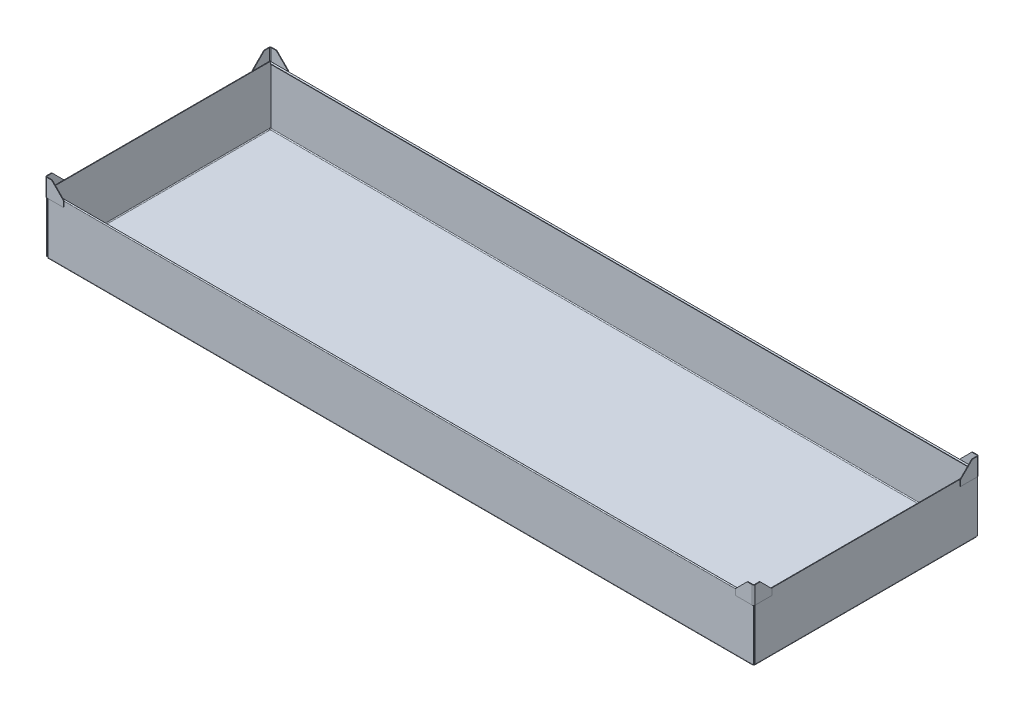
ISO-10303-21;
HEADER;
FILE_DESCRIPTION(('STEP AP214'),'2;1');
FILE_NAME('part.step','',(''),(''),'','','');
FILE_SCHEMA(('AUTOMOTIVE_DESIGN { 1 0 10303 214 1 1 1 1 }'));
ENDSEC;
DATA;
#1=APPLICATION_CONTEXT('core data for automotive mechanical design processes');
#2=APPLICATION_PROTOCOL_DEFINITION('international standard','automotive_design',2000,#1);
#3=PRODUCT_CONTEXT('',#1,'mechanical');
#4=PRODUCT('Part','Part','',(#3));
#5=PRODUCT_RELATED_PRODUCT_CATEGORY('part','',(#4));
#6=PRODUCT_DEFINITION_FORMATION('','',#4);
#7=PRODUCT_DEFINITION_CONTEXT('part definition',#1,'design');
#8=PRODUCT_DEFINITION('design','',#6,#7);
#9=PRODUCT_DEFINITION_SHAPE('','',#8);
#10=(LENGTH_UNIT() NAMED_UNIT(*) SI_UNIT(.MILLI.,.METRE.));
#11=(NAMED_UNIT(*) PLANE_ANGLE_UNIT() SI_UNIT($,.RADIAN.));
#12=(NAMED_UNIT(*) SI_UNIT($,.STERADIAN.) SOLID_ANGLE_UNIT());
#13=UNCERTAINTY_MEASURE_WITH_UNIT(LENGTH_MEASURE(1.E-05),#10,'distance_accuracy_value','');
#14=(GEOMETRIC_REPRESENTATION_CONTEXT(3) GLOBAL_UNCERTAINTY_ASSIGNED_CONTEXT((#13)) GLOBAL_UNIT_ASSIGNED_CONTEXT((#10,
#11,#12)) REPRESENTATION_CONTEXT('',''));
#15=CARTESIAN_POINT('',(0.,0.,0.));
#16=DIRECTION('',(0.,0.,1.));
#17=DIRECTION('',(1.,0.,0.));
#18=AXIS2_PLACEMENT_3D('',#15,#16,#17);
#19=CARTESIAN_POINT('',(598.5,119.000000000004,-190.));
#20=DIRECTION('',(0.,1.,0.));
#21=DIRECTION('',(-1.,0.,0.));
#22=AXIS2_PLACEMENT_3D('',#19,#20,#21);
#23=PLANE('',#22);
#24=DIRECTION('',(0.,0.,-1.));
#25=VECTOR('',#24,1.);
#26=CARTESIAN_POINT('',(598.5,119.000000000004,-190.));
#27=LINE('',#26,#25);
#28=CARTESIAN_POINT('',(598.5,119.000000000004,-190.));
#29=VERTEX_POINT('',#28);
#30=CARTESIAN_POINT('',(598.5,119.000000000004,-191.));
#31=VERTEX_POINT('',#30);
#32=EDGE_CURVE('E292',#29,#31,#27,.T.);
#33=ORIENTED_EDGE('',*,*,#32,.F.);
#34=CARTESIAN_POINT('',(598.5,119.000000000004,-188.5));
#35=DIRECTION('',(0.,-1.,0.));
#36=DIRECTION('',(1.,0.,0.));
#37=AXIS2_PLACEMENT_3D('',#34,#35,#36);
#38=CIRCLE('',#37,1.5);
#39=CARTESIAN_POINT('',(600.,119.000000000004,-188.5));
#40=VERTEX_POINT('',#39);
#41=EDGE_CURVE('E261',#40,#29,#38,.F.);
#42=ORIENTED_EDGE('',*,*,#41,.F.);
#43=DIRECTION('',(-1.,0.,0.));
#44=VECTOR('',#43,1.);
#45=CARTESIAN_POINT('',(601.,119.000000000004,-188.5));
#46=LINE('',#45,#44);
#47=CARTESIAN_POINT('',(601.,119.000000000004,-188.5));
#48=VERTEX_POINT('',#47);
#49=EDGE_CURVE('E289',#48,#40,#46,.T.);
#50=ORIENTED_EDGE('',*,*,#49,.F.);
#51=CARTESIAN_POINT('',(598.5,119.000000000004,-188.5));
#52=DIRECTION('',(0.,1.,0.));
#53=DIRECTION('',(1.,0.,0.));
#54=AXIS2_PLACEMENT_3D('',#51,#52,#53);
#55=CIRCLE('',#54,2.49999999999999);
#56=EDGE_CURVE('E268',#48,#31,#55,.T.);
#57=ORIENTED_EDGE('',*,*,#56,.T.);
#58=EDGE_LOOP('',(#33,#42,#50,#57));
#59=FACE_BOUND('',#58,.T.);
#60=ADVANCED_FACE('F139',(#59),#23,.T.);
#61=CARTESIAN_POINT('',(601.,119.000000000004,-188.5));
#62=DIRECTION('',(0.,1.,0.));
#63=DIRECTION('',(-1.,0.,0.));
#64=AXIS2_PLACEMENT_3D('',#61,#62,#63);
#65=PLANE('',#64);
#66=DIRECTION('',(1.,0.,0.));
#67=VECTOR('',#66,1.);
#68=CARTESIAN_POINT('',(600.,119.000000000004,-191.));
#69=LINE('',#68,#67);
#70=CARTESIAN_POINT('',(590.,119.000000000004,-191.));
#71=VERTEX_POINT('',#70);
#72=EDGE_CURVE('E257',#31,#71,#69,.F.);
#73=ORIENTED_EDGE('',*,*,#72,.T.);
#74=DIRECTION('',(0.,0.,1.));
#75=VECTOR('',#74,1.);
#76=CARTESIAN_POINT('',(590.,119.000000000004,-188.5));
#77=LINE('',#76,#75);
#78=CARTESIAN_POINT('',(590.,119.000000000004,-190.));
#79=VERTEX_POINT('',#78);
#80=EDGE_CURVE('E147',#71,#79,#77,.T.);
#81=ORIENTED_EDGE('',*,*,#80,.T.);
#82=DIRECTION('',(-1.,0.,0.));
#83=VECTOR('',#82,1.);
#84=CARTESIAN_POINT('',(600.,119.000000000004,-190.));
#85=LINE('',#84,#83);
#86=EDGE_CURVE('E259',#29,#79,#85,.T.);
#87=ORIENTED_EDGE('',*,*,#86,.F.);
#88=ORIENTED_EDGE('',*,*,#32,.T.);
#89=EDGE_LOOP('',(#73,#81,#87,#88));
#90=FACE_BOUND('',#89,.T.);
#91=ADVANCED_FACE('F337',(#90),#65,.T.);
#92=CARTESIAN_POINT('',(600.,89.0000000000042,-188.5));
#93=DIRECTION('',(0.,-1.,0.));
#94=DIRECTION('',(1.,0.,0.));
#95=AXIS2_PLACEMENT_3D('',#92,#93,#94);
#96=PLANE('',#95);
#97=DIRECTION('',(1.,0.,0.));
#98=VECTOR('',#97,1.);
#99=CARTESIAN_POINT('',(600.,89.0000000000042,-188.5));
#100=LINE('',#99,#98);
#101=CARTESIAN_POINT('',(600.,89.0000000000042,-188.5));
#102=VERTEX_POINT('',#101);
#103=CARTESIAN_POINT('',(601.,89.0000000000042,-188.5));
#104=VERTEX_POINT('',#103);
#105=EDGE_CURVE('E287',#102,#104,#100,.T.);
#106=ORIENTED_EDGE('',*,*,#105,.F.);
#107=CARTESIAN_POINT('',(598.5,89.0000000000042,-188.5));
#108=DIRECTION('',(0.,-1.,0.));
#109=DIRECTION('',(1.,0.,0.));
#110=AXIS2_PLACEMENT_3D('',#107,#108,#109);
#111=CIRCLE('',#110,1.5);
#112=CARTESIAN_POINT('',(598.5,89.0000000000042,-190.));
#113=VERTEX_POINT('',#112);
#114=EDGE_CURVE('E243',#102,#113,#111,.F.);
#115=ORIENTED_EDGE('',*,*,#114,.T.);
#116=DIRECTION('',(0.,0.,1.));
#117=VECTOR('',#116,1.);
#118=CARTESIAN_POINT('',(598.5,89.0000000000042,-191.));
#119=LINE('',#118,#117);
#120=CARTESIAN_POINT('',(598.5,89.0000000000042,-191.));
#121=VERTEX_POINT('',#120);
#122=EDGE_CURVE('E224',#121,#113,#119,.T.);
#123=ORIENTED_EDGE('',*,*,#122,.F.);
#124=CARTESIAN_POINT('',(598.5,89.0000000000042,-188.5));
#125=DIRECTION('',(0.,1.,0.));
#126=DIRECTION('',(1.,0.,0.));
#127=AXIS2_PLACEMENT_3D('',#124,#125,#126);
#128=CIRCLE('',#127,2.49999999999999);
#129=EDGE_CURVE('E255',#104,#121,#128,.T.);
#130=ORIENTED_EDGE('',*,*,#129,.F.);
#131=EDGE_LOOP('',(#106,#115,#123,#130));
#132=FACE_BOUND('',#131,.T.);
#133=ADVANCED_FACE('F339',(#132),#96,.T.);
#134=CARTESIAN_POINT('',(598.5,89.0000000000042,-191.));
#135=DIRECTION('',(0.,-1.,0.));
#136=DIRECTION('',(1.,0.,0.));
#137=AXIS2_PLACEMENT_3D('',#134,#135,#136);
#138=PLANE('',#137);
#139=DIRECTION('',(0.,0.,-1.));
#140=VECTOR('',#139,1.);
#141=CARTESIAN_POINT('',(600.,89.0000000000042,-190.));
#142=LINE('',#141,#140);
#143=CARTESIAN_POINT('',(600.,89.0000000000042,-160.));
#144=VERTEX_POINT('',#143);
#145=EDGE_CURVE('E246',#144,#102,#142,.T.);
#146=ORIENTED_EDGE('',*,*,#145,.T.);
#147=ORIENTED_EDGE('',*,*,#105,.T.);
#148=DIRECTION('',(0.,0.,-1.));
#149=VECTOR('',#148,1.);
#150=CARTESIAN_POINT('',(601.,89.0000000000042,-190.));
#151=LINE('',#150,#149);
#152=CARTESIAN_POINT('',(601.,89.0000000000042,-160.));
#153=VERTEX_POINT('',#152);
#154=EDGE_CURVE('E252',#153,#104,#151,.T.);
#155=ORIENTED_EDGE('',*,*,#154,.F.);
#156=DIRECTION('',(-1.,0.,0.));
#157=VECTOR('',#156,1.);
#158=CARTESIAN_POINT('',(601.,89.0000000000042,-160.));
#159=LINE('',#158,#157);
#160=EDGE_CURVE('E249',#153,#144,#159,.T.);
#161=ORIENTED_EDGE('',*,*,#160,.T.);
#162=EDGE_LOOP('',(#146,#147,#155,#161));
#163=FACE_BOUND('',#162,.T.);
#164=ADVANCED_FACE('F345',(#163),#138,.T.);
#165=CARTESIAN_POINT('',(600.,119.000000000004,-191.));
#166=DIRECTION('',(0.,0.,1.));
#167=DIRECTION('',(1.,0.,0.));
#168=AXIS2_PLACEMENT_3D('',#165,#166,#167);
#169=PLANE('',#168);
#170=DIRECTION('',(0.,-1.,0.));
#171=VECTOR('',#170,1.);
#172=CARTESIAN_POINT('',(570.,119.000000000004,-191.));
#173=LINE('',#172,#171);
#174=CARTESIAN_POINT('',(570.,99.0000000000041,-191.));
#175=VERTEX_POINT('',#174);
#176=CARTESIAN_POINT('',(570.,89.0000000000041,-191.));
#177=VERTEX_POINT('',#176);
#178=EDGE_CURVE('E216',#175,#177,#173,.T.);
#179=ORIENTED_EDGE('',*,*,#178,.F.);
#180=DIRECTION('',(-0.707106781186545,-0.707106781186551,0.));
#181=VECTOR('',#180,1.);
#182=CARTESIAN_POINT('',(570.,99.0000000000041,-191.));
#183=LINE('',#182,#181);
#184=EDGE_CURVE('E161',#175,#71,#183,.F.);
#185=ORIENTED_EDGE('',*,*,#184,.T.);
#186=ORIENTED_EDGE('',*,*,#72,.F.);
#187=DIRECTION('',(0.,-1.,0.));
#188=VECTOR('',#187,1.);
#189=CARTESIAN_POINT('',(598.5,119.000000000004,-191.));
#190=LINE('',#189,#188);
#191=EDGE_CURVE('E239',#31,#121,#190,.T.);
#192=ORIENTED_EDGE('',*,*,#191,.T.);
#193=DIRECTION('',(1.,0.,0.));
#194=VECTOR('',#193,1.);
#195=CARTESIAN_POINT('',(600.,89.0000000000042,-191.));
#196=LINE('',#195,#194);
#197=EDGE_CURVE('E231',#121,#177,#196,.F.);
#198=ORIENTED_EDGE('',*,*,#197,.T.);
#199=EDGE_LOOP('',(#179,#185,#186,#192,#198));
#200=FACE_BOUND('',#199,.T.);
#201=ADVANCED_FACE('F237',(#200),#169,.F.);
#202=CARTESIAN_POINT('',(570.,119.000000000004,-190.));
#203=DIRECTION('',(-1.,0.,0.));
#204=DIRECTION('',(0.,-1.,0.));
#205=AXIS2_PLACEMENT_3D('',#202,#203,#204);
#206=PLANE('',#205);
#207=DIRECTION('',(0.,-1.,0.));
#208=VECTOR('',#207,1.);
#209=CARTESIAN_POINT('',(570.,119.000000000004,-190.));
#210=LINE('',#209,#208);
#211=CARTESIAN_POINT('',(570.,99.0000000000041,-190.));
#212=VERTEX_POINT('',#211);
#213=CARTESIAN_POINT('',(570.,89.0000000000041,-190.));
#214=VERTEX_POINT('',#213);
#215=EDGE_CURVE('E225',#212,#214,#210,.T.);
#216=ORIENTED_EDGE('',*,*,#215,.F.);
#217=DIRECTION('',(0.,0.,-1.));
#218=VECTOR('',#217,1.);
#219=CARTESIAN_POINT('',(570.,99.0000000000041,-190.));
#220=LINE('',#219,#218);
#221=EDGE_CURVE('E222',#212,#175,#220,.T.);
#222=ORIENTED_EDGE('',*,*,#221,.T.);
#223=ORIENTED_EDGE('',*,*,#178,.T.);
#224=DIRECTION('',(0.,0.,-1.));
#225=VECTOR('',#224,1.);
#226=CARTESIAN_POINT('',(570.,89.0000000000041,-190.));
#227=LINE('',#226,#225);
#228=EDGE_CURVE('E220',#214,#177,#227,.T.);
#229=ORIENTED_EDGE('',*,*,#228,.F.);
#230=EDGE_LOOP('',(#216,#222,#223,#229));
#231=FACE_BOUND('',#230,.T.);
#232=ADVANCED_FACE('F219',(#231),#206,.T.);
#233=CARTESIAN_POINT('',(600.,119.000000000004,-190.));
#234=DIRECTION('',(0.,0.,1.));
#235=DIRECTION('',(1.,0.,0.));
#236=AXIS2_PLACEMENT_3D('',#233,#234,#235);
#237=PLANE('',#236);
#238=ORIENTED_EDGE('',*,*,#86,.T.);
#239=DIRECTION('',(0.707106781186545,0.707106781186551,0.));
#240=VECTOR('',#239,1.);
#241=CARTESIAN_POINT('',(595.,124.000000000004,-190.));
#242=LINE('',#241,#240);
#243=EDGE_CURVE('E14',#79,#212,#242,.F.);
#244=ORIENTED_EDGE('',*,*,#243,.T.);
#245=ORIENTED_EDGE('',*,*,#215,.T.);
#246=DIRECTION('',(-1.,0.,0.));
#247=VECTOR('',#246,1.);
#248=CARTESIAN_POINT('',(600.,89.0000000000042,-190.));
#249=LINE('',#248,#247);
#250=EDGE_CURVE('E234',#113,#214,#249,.T.);
#251=ORIENTED_EDGE('',*,*,#250,.F.);
#252=DIRECTION('',(0.,-1.,0.));
#253=VECTOR('',#252,1.);
#254=CARTESIAN_POINT('',(598.5,119.000000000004,-190.));
#255=LINE('',#254,#253);
#256=EDGE_CURVE('E282',#29,#113,#255,.T.);
#257=ORIENTED_EDGE('',*,*,#256,.F.);
#258=EDGE_LOOP('',(#238,#244,#245,#251,#257));
#259=FACE_BOUND('',#258,.T.);
#260=ADVANCED_FACE('F335',(#259),#237,.T.);
#261=CARTESIAN_POINT('',(598.5,119.000000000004,-188.5));
#262=DIRECTION('',(0.,-1.,0.));
#263=DIRECTION('',(1.,0.,0.));
#264=AXIS2_PLACEMENT_3D('',#261,#262,#263);
#265=CYLINDRICAL_SURFACE('',#264,1.5);
#266=ORIENTED_EDGE('',*,*,#256,.T.);
#267=ORIENTED_EDGE('',*,*,#114,.F.);
#268=DIRECTION('',(0.,-1.,0.));
#269=VECTOR('',#268,1.);
#270=CARTESIAN_POINT('',(600.,119.000000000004,-188.5));
#271=LINE('',#270,#269);
#272=EDGE_CURVE('E279',#40,#102,#271,.T.);
#273=ORIENTED_EDGE('',*,*,#272,.F.);
#274=ORIENTED_EDGE('',*,*,#41,.T.);
#275=EDGE_LOOP('',(#266,#267,#273,#274));
#276=FACE_BOUND('',#275,.T.);
#277=ADVANCED_FACE('F331',(#276),#265,.F.);
#278=CARTESIAN_POINT('',(600.,119.000000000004,-190.));
#279=DIRECTION('',(-1.,0.,0.));
#280=DIRECTION('',(0.,-1.,0.));
#281=AXIS2_PLACEMENT_3D('',#278,#279,#280);
#282=PLANE('',#281);
#283=DIRECTION('',(0.,-1.,0.));
#284=VECTOR('',#283,1.);
#285=CARTESIAN_POINT('',(600.,119.000000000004,-160.));
#286=LINE('',#285,#284);
#287=CARTESIAN_POINT('',(600.,99.0000000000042,-160.));
#288=VERTEX_POINT('',#287);
#289=EDGE_CURVE('E277',#288,#144,#286,.T.);
#290=ORIENTED_EDGE('',*,*,#289,.F.);
#291=DIRECTION('',(0.,0.707106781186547,-0.707106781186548));
#292=VECTOR('',#291,1.);
#293=CARTESIAN_POINT('',(600.,124.000000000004,-185.));
#294=LINE('',#293,#292);
#295=CARTESIAN_POINT('',(600.,119.000000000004,-180.));
#296=VERTEX_POINT('',#295);
#297=EDGE_CURVE('E297',#288,#296,#294,.T.);
#298=ORIENTED_EDGE('',*,*,#297,.T.);
#299=DIRECTION('',(0.,0.,-1.));
#300=VECTOR('',#299,1.);
#301=CARTESIAN_POINT('',(600.,119.000000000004,-190.));
#302=LINE('',#301,#300);
#303=EDGE_CURVE('E264',#296,#40,#302,.T.);
#304=ORIENTED_EDGE('',*,*,#303,.T.);
#305=ORIENTED_EDGE('',*,*,#272,.T.);
#306=ORIENTED_EDGE('',*,*,#145,.F.);
#307=EDGE_LOOP('',(#290,#298,#304,#305,#306));
#308=FACE_BOUND('',#307,.T.);
#309=ADVANCED_FACE('F321',(#308),#282,.T.);
#310=CARTESIAN_POINT('',(601.,119.000000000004,-160.));
#311=DIRECTION('',(0.,0.,1.));
#312=DIRECTION('',(1.,0.,0.));
#313=AXIS2_PLACEMENT_3D('',#310,#311,#312);
#314=PLANE('',#313);
#315=DIRECTION('',(0.,-1.,0.));
#316=VECTOR('',#315,1.);
#317=CARTESIAN_POINT('',(601.,119.000000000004,-160.));
#318=LINE('',#317,#316);
#319=CARTESIAN_POINT('',(601.,99.0000000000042,-160.));
#320=VERTEX_POINT('',#319);
#321=EDGE_CURVE('E275',#320,#153,#318,.T.);
#322=ORIENTED_EDGE('',*,*,#321,.F.);
#323=DIRECTION('',(-1.,0.,0.));
#324=VECTOR('',#323,1.);
#325=CARTESIAN_POINT('',(600.,99.0000000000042,-160.));
#326=LINE('',#325,#324);
#327=EDGE_CURVE('E294',#320,#288,#326,.T.);
#328=ORIENTED_EDGE('',*,*,#327,.T.);
#329=ORIENTED_EDGE('',*,*,#289,.T.);
#330=ORIENTED_EDGE('',*,*,#160,.F.);
#331=EDGE_LOOP('',(#322,#328,#329,#330));
#332=FACE_BOUND('',#331,.T.);
#333=ADVANCED_FACE('F315',(#332),#314,.T.);
#334=CARTESIAN_POINT('',(601.,119.000000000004,-190.));
#335=DIRECTION('',(-1.,0.,0.));
#336=DIRECTION('',(0.,-1.,0.));
#337=AXIS2_PLACEMENT_3D('',#334,#335,#336);
#338=PLANE('',#337);
#339=DIRECTION('',(0.,0.,-1.));
#340=VECTOR('',#339,1.);
#341=CARTESIAN_POINT('',(601.,119.000000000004,-190.));
#342=LINE('',#341,#340);
#343=CARTESIAN_POINT('',(601.,119.000000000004,-180.));
#344=VERTEX_POINT('',#343);
#345=EDGE_CURVE('E266',#344,#48,#342,.T.);
#346=ORIENTED_EDGE('',*,*,#345,.F.);
#347=DIRECTION('',(0.,-0.707106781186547,0.707106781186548));
#348=VECTOR('',#347,1.);
#349=CARTESIAN_POINT('',(601.,99.0000000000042,-160.));
#350=LINE('',#349,#348);
#351=EDGE_CURVE('E301',#344,#320,#350,.T.);
#352=ORIENTED_EDGE('',*,*,#351,.T.);
#353=ORIENTED_EDGE('',*,*,#321,.T.);
#354=ORIENTED_EDGE('',*,*,#154,.T.);
#355=DIRECTION('',(0.,-1.,0.));
#356=VECTOR('',#355,1.);
#357=CARTESIAN_POINT('',(601.,119.000000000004,-188.5));
#358=LINE('',#357,#356);
#359=EDGE_CURVE('E272',#48,#104,#358,.T.);
#360=ORIENTED_EDGE('',*,*,#359,.F.);
#361=EDGE_LOOP('',(#346,#352,#353,#354,#360));
#362=FACE_BOUND('',#361,.T.);
#363=ADVANCED_FACE('F308',(#362),#338,.F.);
#364=CARTESIAN_POINT('',(598.5,119.000000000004,-188.5));
#365=DIRECTION('',(0.,-1.,0.));
#366=DIRECTION('',(1.,0.,0.));
#367=AXIS2_PLACEMENT_3D('',#364,#365,#366);
#368=CYLINDRICAL_SURFACE('',#367,2.49999999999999);
#369=ORIENTED_EDGE('',*,*,#359,.T.);
#370=ORIENTED_EDGE('',*,*,#129,.T.);
#371=ORIENTED_EDGE('',*,*,#191,.F.);
#372=ORIENTED_EDGE('',*,*,#56,.F.);
#373=EDGE_LOOP('',(#369,#370,#371,#372));
#374=FACE_BOUND('',#373,.T.);
#375=ADVANCED_FACE('F360',(#374),#368,.T.);
#376=CARTESIAN_POINT('',(598.5,119.000000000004,-188.5));
#377=DIRECTION('',(0.,-1.,0.));
#378=DIRECTION('',(-1.,0.,0.));
#379=AXIS2_PLACEMENT_3D('',#376,#377,#378);
#380=PLANE('',#379);
#381=ORIENTED_EDGE('',*,*,#303,.F.);
#382=DIRECTION('',(1.,0.,0.));
#383=VECTOR('',#382,1.);
#384=CARTESIAN_POINT('',(601.,119.000000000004,-180.));
#385=LINE('',#384,#383);
#386=EDGE_CURVE('E299',#296,#344,#385,.T.);
#387=ORIENTED_EDGE('',*,*,#386,.T.);
#388=ORIENTED_EDGE('',*,*,#345,.T.);
#389=ORIENTED_EDGE('',*,*,#49,.T.);
#390=EDGE_LOOP('',(#381,#387,#388,#389));
#391=FACE_BOUND('',#390,.T.);
#392=ADVANCED_FACE('F324',(#391),#380,.F.);
#393=CARTESIAN_POINT('',(598.5,89.0000000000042,-188.5));
#394=DIRECTION('',(0.,-1.,0.));
#395=DIRECTION('',(-1.,0.,0.));
#396=AXIS2_PLACEMENT_3D('',#393,#394,#395);
#397=PLANE('',#396);
#398=ORIENTED_EDGE('',*,*,#197,.F.);
#399=ORIENTED_EDGE('',*,*,#122,.T.);
#400=ORIENTED_EDGE('',*,*,#250,.T.);
#401=ORIENTED_EDGE('',*,*,#228,.T.);
#402=EDGE_LOOP('',(#398,#399,#400,#401));
#403=FACE_BOUND('',#402,.T.);
#404=ADVANCED_FACE('F230',(#403),#397,.T.);
#405=CARTESIAN_POINT('',(601.,99.0000000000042,-160.));
#406=DIRECTION('',(0.,0.707106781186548,0.707106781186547));
#407=DIRECTION('',(1.,0.,0.));
#408=AXIS2_PLACEMENT_3D('',#405,#406,#407);
#409=PLANE('',#408);
#410=ORIENTED_EDGE('',*,*,#351,.F.);
#411=ORIENTED_EDGE('',*,*,#386,.F.);
#412=ORIENTED_EDGE('',*,*,#297,.F.);
#413=ORIENTED_EDGE('',*,*,#327,.F.);
#414=EDGE_LOOP('',(#410,#411,#412,#413));
#415=FACE_BOUND('',#414,.T.);
#416=ADVANCED_FACE('F318',(#415),#409,.T.);
#417=CARTESIAN_POINT('',(570.,99.0000000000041,-190.));
#418=DIRECTION('',(0.70710678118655,-0.707106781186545,0.));
#419=DIRECTION('',(0.,0.,-1.));
#420=AXIS2_PLACEMENT_3D('',#417,#418,#419);
#421=PLANE('',#420);
#422=ORIENTED_EDGE('',*,*,#243,.F.);
#423=ORIENTED_EDGE('',*,*,#80,.F.);
#424=ORIENTED_EDGE('',*,*,#184,.F.);
#425=ORIENTED_EDGE('',*,*,#221,.F.);
#426=EDGE_LOOP('',(#422,#423,#424,#425));
#427=FACE_BOUND('',#426,.T.);
#428=ADVANCED_FACE('F141',(#427),#421,.F.);
#429=CLOSED_SHELL('',(#60,#91,#133,#164,#201,#232,#260,#277,#309,#333,#363,#375,#392,#404,#416,#428));
#430=MANIFOLD_SOLID_BREP('B2',#429);
#431=CARTESIAN_POINT('',(600.,119.000000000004,188.5));
#432=DIRECTION('',(0.,1.,0.));
#433=DIRECTION('',(-1.,0.,0.));
#434=AXIS2_PLACEMENT_3D('',#431,#432,#433);
#435=PLANE('',#434);
#436=DIRECTION('',(1.,0.,0.));
#437=VECTOR('',#436,1.);
#438=CARTESIAN_POINT('',(600.,119.000000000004,188.5));
#439=LINE('',#438,#437);
#440=CARTESIAN_POINT('',(600.,119.000000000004,188.5));
#441=VERTEX_POINT('',#440);
#442=CARTESIAN_POINT('',(601.,119.000000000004,188.5));
#443=VERTEX_POINT('',#442);
#444=EDGE_CURVE('E671',#441,#443,#439,.T.);
#445=ORIENTED_EDGE('',*,*,#444,.F.);
#446=CARTESIAN_POINT('',(598.5,119.000000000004,188.5));
#447=DIRECTION('',(0.,1.,0.));
#448=DIRECTION('',(-1.,0.,0.));
#449=AXIS2_PLACEMENT_3D('',#446,#447,#448);
#450=CIRCLE('',#449,1.5);
#451=CARTESIAN_POINT('',(598.5,119.000000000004,190.));
#452=VERTEX_POINT('',#451);
#453=EDGE_CURVE('E648',#441,#452,#450,.F.);
#454=ORIENTED_EDGE('',*,*,#453,.T.);
#455=DIRECTION('',(0.,0.,-1.));
#456=VECTOR('',#455,1.);
#457=CARTESIAN_POINT('',(598.5,119.000000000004,191.));
#458=LINE('',#457,#456);
#459=CARTESIAN_POINT('',(598.5,119.000000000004,191.));
#460=VERTEX_POINT('',#459);
#461=EDGE_CURVE('E669',#460,#452,#458,.T.);
#462=ORIENTED_EDGE('',*,*,#461,.F.);
#463=CARTESIAN_POINT('',(598.5,119.000000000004,188.5));
#464=DIRECTION('',(0.,1.,0.));
#465=DIRECTION('',(1.,0.,0.));
#466=AXIS2_PLACEMENT_3D('',#463,#464,#465);
#467=CIRCLE('',#466,2.49999999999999);
#468=EDGE_CURVE('E641',#443,#460,#467,.F.);
#469=ORIENTED_EDGE('',*,*,#468,.F.);
#470=EDGE_LOOP('',(#445,#454,#462,#469));
#471=FACE_BOUND('',#470,.T.);
#472=ADVANCED_FACE('F516',(#471),#435,.T.);
#473=CARTESIAN_POINT('',(598.5,119.000000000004,191.));
#474=DIRECTION('',(0.,1.,0.));
#475=DIRECTION('',(-1.,0.,0.));
#476=AXIS2_PLACEMENT_3D('',#473,#474,#475);
#477=PLANE('',#476);
#478=DIRECTION('',(0.,0.,1.));
#479=VECTOR('',#478,1.);
#480=CARTESIAN_POINT('',(601.,119.000000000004,190.));
#481=LINE('',#480,#479);
#482=CARTESIAN_POINT('',(601.,119.000000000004,180.));
#483=VERTEX_POINT('',#482);
#484=EDGE_CURVE('E644',#483,#443,#481,.T.);
#485=ORIENTED_EDGE('',*,*,#484,.F.);
#486=DIRECTION('',(-1.,0.,0.));
#487=VECTOR('',#486,1.);
#488=CARTESIAN_POINT('',(598.5,119.000000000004,180.));
#489=LINE('',#488,#487);
#490=CARTESIAN_POINT('',(600.,119.000000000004,180.));
#491=VERTEX_POINT('',#490);
#492=EDGE_CURVE('E524',#483,#491,#489,.T.);
#493=ORIENTED_EDGE('',*,*,#492,.T.);
#494=DIRECTION('',(0.,0.,1.));
#495=VECTOR('',#494,1.);
#496=CARTESIAN_POINT('',(600.,119.000000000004,190.));
#497=LINE('',#496,#495);
#498=EDGE_CURVE('E646',#491,#441,#497,.T.);
#499=ORIENTED_EDGE('',*,*,#498,.T.);
#500=ORIENTED_EDGE('',*,*,#444,.T.);
#501=EDGE_LOOP('',(#485,#493,#499,#500));
#502=FACE_BOUND('',#501,.T.);
#503=ADVANCED_FACE('F727',(#502),#477,.T.);
#504=CARTESIAN_POINT('',(598.5,89.0000000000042,190.));
#505=DIRECTION('',(0.,-1.,0.));
#506=DIRECTION('',(1.,0.,0.));
#507=AXIS2_PLACEMENT_3D('',#504,#505,#506);
#508=PLANE('',#507);
#509=DIRECTION('',(0.,0.,1.));
#510=VECTOR('',#509,1.);
#511=CARTESIAN_POINT('',(598.5,89.0000000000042,190.));
#512=LINE('',#511,#510);
#513=CARTESIAN_POINT('',(598.5,89.0000000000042,190.));
#514=VERTEX_POINT('',#513);
#515=CARTESIAN_POINT('',(598.5,89.0000000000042,191.));
#516=VERTEX_POINT('',#515);
#517=EDGE_CURVE('E667',#514,#516,#512,.T.);
#518=ORIENTED_EDGE('',*,*,#517,.F.);
#519=CARTESIAN_POINT('',(598.5,89.0000000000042,188.5));
#520=DIRECTION('',(0.,1.,0.));
#521=DIRECTION('',(-1.,0.,0.));
#522=AXIS2_PLACEMENT_3D('',#519,#520,#521);
#523=CIRCLE('',#522,1.5);
#524=CARTESIAN_POINT('',(600.,89.0000000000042,188.5));
#525=VERTEX_POINT('',#524);
#526=EDGE_CURVE('E633',#525,#514,#523,.F.);
#527=ORIENTED_EDGE('',*,*,#526,.F.);
#528=DIRECTION('',(-1.,0.,0.));
#529=VECTOR('',#528,1.);
#530=CARTESIAN_POINT('',(601.,89.0000000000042,188.5));
#531=LINE('',#530,#529);
#532=CARTESIAN_POINT('',(601.,89.0000000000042,188.5));
#533=VERTEX_POINT('',#532);
#534=EDGE_CURVE('E601',#533,#525,#531,.T.);
#535=ORIENTED_EDGE('',*,*,#534,.F.);
#536=CARTESIAN_POINT('',(598.5,89.0000000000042,188.5));
#537=DIRECTION('',(0.,1.,0.));
#538=DIRECTION('',(1.,0.,0.));
#539=AXIS2_PLACEMENT_3D('',#536,#537,#538);
#540=CIRCLE('',#539,2.49999999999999);
#541=EDGE_CURVE('E621',#533,#516,#540,.F.);
#542=ORIENTED_EDGE('',*,*,#541,.T.);
#543=EDGE_LOOP('',(#518,#527,#535,#542));
#544=FACE_BOUND('',#543,.T.);
#545=ADVANCED_FACE('F703',(#544),#508,.T.);
#546=CARTESIAN_POINT('',(601.,89.0000000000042,188.5));
#547=DIRECTION('',(0.,-1.,0.));
#548=DIRECTION('',(1.,0.,0.));
#549=AXIS2_PLACEMENT_3D('',#546,#547,#548);
#550=PLANE('',#549);
#551=DIRECTION('',(-1.,0.,0.));
#552=VECTOR('',#551,1.);
#553=CARTESIAN_POINT('',(600.,89.0000000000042,190.));
#554=LINE('',#553,#552);
#555=CARTESIAN_POINT('',(570.,89.0000000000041,190.));
#556=VERTEX_POINT('',#555);
#557=EDGE_CURVE('E608',#514,#556,#554,.T.);
#558=ORIENTED_EDGE('',*,*,#557,.F.);
#559=ORIENTED_EDGE('',*,*,#517,.T.);
#560=DIRECTION('',(1.,0.,0.));
#561=VECTOR('',#560,1.);
#562=CARTESIAN_POINT('',(600.,89.0000000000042,191.));
#563=LINE('',#562,#561);
#564=CARTESIAN_POINT('',(570.,89.0000000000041,191.));
#565=VERTEX_POINT('',#564);
#566=EDGE_CURVE('E611',#516,#565,#563,.F.);
#567=ORIENTED_EDGE('',*,*,#566,.T.);
#568=DIRECTION('',(0.,0.,-1.));
#569=VECTOR('',#568,1.);
#570=CARTESIAN_POINT('',(570.,89.0000000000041,191.));
#571=LINE('',#570,#569);
#572=EDGE_CURVE('E596',#565,#556,#571,.T.);
#573=ORIENTED_EDGE('',*,*,#572,.T.);
#574=EDGE_LOOP('',(#558,#559,#567,#573));
#575=FACE_BOUND('',#574,.T.);
#576=ADVANCED_FACE('F607',(#575),#550,.T.);
#577=CARTESIAN_POINT('',(600.,119.000000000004,190.));
#578=DIRECTION('',(0.,0.,1.));
#579=DIRECTION('',(1.,0.,0.));
#580=AXIS2_PLACEMENT_3D('',#577,#578,#579);
#581=PLANE('',#580);
#582=DIRECTION('',(0.,-1.,0.));
#583=VECTOR('',#582,1.);
#584=CARTESIAN_POINT('',(570.,119.000000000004,190.));
#585=LINE('',#584,#583);
#586=CARTESIAN_POINT('',(570.,99.0000000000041,190.));
#587=VERTEX_POINT('',#586);
#588=EDGE_CURVE('E592',#587,#556,#585,.T.);
#589=ORIENTED_EDGE('',*,*,#588,.F.);
#590=DIRECTION('',(-0.707106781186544,-0.70710678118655,0.));
#591=VECTOR('',#590,1.);
#592=CARTESIAN_POINT('',(570.,99.0000000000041,190.));
#593=LINE('',#592,#591);
#594=CARTESIAN_POINT('',(590.,119.000000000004,190.));
#595=VERTEX_POINT('',#594);
#596=EDGE_CURVE('E675',#587,#595,#593,.F.);
#597=ORIENTED_EDGE('',*,*,#596,.T.);
#598=DIRECTION('',(-1.,0.,0.));
#599=VECTOR('',#598,1.);
#600=CARTESIAN_POINT('',(600.,119.000000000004,190.));
#601=LINE('',#600,#599);
#602=EDGE_CURVE('E635',#452,#595,#601,.T.);
#603=ORIENTED_EDGE('',*,*,#602,.F.);
#604=DIRECTION('',(0.,-1.,0.));
#605=VECTOR('',#604,1.);
#606=CARTESIAN_POINT('',(598.5,119.000000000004,190.));
#607=LINE('',#606,#605);
#608=EDGE_CURVE('E617',#452,#514,#607,.T.);
#609=ORIENTED_EDGE('',*,*,#608,.T.);
#610=ORIENTED_EDGE('',*,*,#557,.T.);
#611=EDGE_LOOP('',(#589,#597,#603,#609,#610));
#612=FACE_BOUND('',#611,.T.);
#613=ADVANCED_FACE('F614',(#612),#581,.F.);
#614=CARTESIAN_POINT('',(570.,119.000000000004,191.));
#615=DIRECTION('',(-1.,0.,0.));
#616=DIRECTION('',(0.,-1.,0.));
#617=AXIS2_PLACEMENT_3D('',#614,#615,#616);
#618=PLANE('',#617);
#619=DIRECTION('',(0.,-1.,0.));
#620=VECTOR('',#619,1.);
#621=CARTESIAN_POINT('',(570.,119.000000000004,191.));
#622=LINE('',#621,#620);
#623=CARTESIAN_POINT('',(570.,99.0000000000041,191.));
#624=VERTEX_POINT('',#623);
#625=EDGE_CURVE('E602',#624,#565,#622,.T.);
#626=ORIENTED_EDGE('',*,*,#625,.F.);
#627=DIRECTION('',(0.,0.,-1.));
#628=VECTOR('',#627,1.);
#629=CARTESIAN_POINT('',(570.,99.0000000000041,191.));
#630=LINE('',#629,#628);
#631=EDGE_CURVE('E598',#624,#587,#630,.T.);
#632=ORIENTED_EDGE('',*,*,#631,.T.);
#633=ORIENTED_EDGE('',*,*,#588,.T.);
#634=ORIENTED_EDGE('',*,*,#572,.F.);
#635=EDGE_LOOP('',(#626,#632,#633,#634));
#636=FACE_BOUND('',#635,.T.);
#637=ADVANCED_FACE('F595',(#636),#618,.T.);
#638=CARTESIAN_POINT('',(600.,119.000000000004,191.));
#639=DIRECTION('',(0.,0.,1.));
#640=DIRECTION('',(1.,0.,0.));
#641=AXIS2_PLACEMENT_3D('',#638,#639,#640);
#642=PLANE('',#641);
#643=DIRECTION('',(1.,0.,0.));
#644=VECTOR('',#643,1.);
#645=CARTESIAN_POINT('',(600.,119.000000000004,191.));
#646=LINE('',#645,#644);
#647=CARTESIAN_POINT('',(590.,119.000000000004,191.));
#648=VERTEX_POINT('',#647);
#649=EDGE_CURVE('E638',#460,#648,#646,.F.);
#650=ORIENTED_EDGE('',*,*,#649,.T.);
#651=DIRECTION('',(0.707106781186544,0.70710678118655,0.));
#652=VECTOR('',#651,1.);
#653=CARTESIAN_POINT('',(595.,124.000000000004,191.));
#654=LINE('',#653,#652);
#655=EDGE_CURVE('E679',#648,#624,#654,.F.);
#656=ORIENTED_EDGE('',*,*,#655,.T.);
#657=ORIENTED_EDGE('',*,*,#625,.T.);
#658=ORIENTED_EDGE('',*,*,#566,.F.);
#659=DIRECTION('',(0.,-1.,0.));
#660=VECTOR('',#659,1.);
#661=CARTESIAN_POINT('',(598.5,119.000000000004,191.));
#662=LINE('',#661,#660);
#663=EDGE_CURVE('E662',#460,#516,#662,.T.);
#664=ORIENTED_EDGE('',*,*,#663,.F.);
#665=EDGE_LOOP('',(#650,#656,#657,#658,#664));
#666=FACE_BOUND('',#665,.T.);
#667=ADVANCED_FACE('F706',(#666),#642,.T.);
#668=CARTESIAN_POINT('',(598.5,119.000000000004,188.5));
#669=DIRECTION('',(0.,-1.,0.));
#670=DIRECTION('',(1.,0.,0.));
#671=AXIS2_PLACEMENT_3D('',#668,#669,#670);
#672=CYLINDRICAL_SURFACE('',#671,2.49999999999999);
#673=ORIENTED_EDGE('',*,*,#663,.T.);
#674=ORIENTED_EDGE('',*,*,#541,.F.);
#675=DIRECTION('',(0.,-1.,0.));
#676=VECTOR('',#675,1.);
#677=CARTESIAN_POINT('',(601.,119.000000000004,188.5));
#678=LINE('',#677,#676);
#679=EDGE_CURVE('E659',#443,#533,#678,.T.);
#680=ORIENTED_EDGE('',*,*,#679,.F.);
#681=ORIENTED_EDGE('',*,*,#468,.T.);
#682=EDGE_LOOP('',(#673,#674,#680,#681));
#683=FACE_BOUND('',#682,.T.);
#684=ADVANCED_FACE('F699',(#683),#672,.T.);
#685=CARTESIAN_POINT('',(601.,119.000000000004,190.));
#686=DIRECTION('',(1.,0.,0.));
#687=DIRECTION('',(0.,0.,-1.));
#688=AXIS2_PLACEMENT_3D('',#685,#686,#687);
#689=PLANE('',#688);
#690=DIRECTION('',(0.,-1.,0.));
#691=VECTOR('',#690,1.);
#692=CARTESIAN_POINT('',(601.,119.000000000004,160.));
#693=LINE('',#692,#691);
#694=CARTESIAN_POINT('',(601.,99.0000000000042,160.));
#695=VERTEX_POINT('',#694);
#696=CARTESIAN_POINT('',(601.,89.0000000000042,160.));
#697=VERTEX_POINT('',#696);
#698=EDGE_CURVE('E657',#695,#697,#693,.T.);
#699=ORIENTED_EDGE('',*,*,#698,.F.);
#700=DIRECTION('',(0.,-0.707106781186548,-0.707106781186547));
#701=VECTOR('',#700,1.);
#702=CARTESIAN_POINT('',(601.,124.000000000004,185.));
#703=LINE('',#702,#701);
#704=EDGE_CURVE('E538',#695,#483,#703,.F.);
#705=ORIENTED_EDGE('',*,*,#704,.T.);
#706=ORIENTED_EDGE('',*,*,#484,.T.);
#707=ORIENTED_EDGE('',*,*,#679,.T.);
#708=DIRECTION('',(0.,0.,1.));
#709=VECTOR('',#708,1.);
#710=CARTESIAN_POINT('',(601.,89.0000000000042,190.));
#711=LINE('',#710,#709);
#712=EDGE_CURVE('E624',#697,#533,#711,.T.);
#713=ORIENTED_EDGE('',*,*,#712,.F.);
#714=EDGE_LOOP('',(#699,#705,#706,#707,#713));
#715=FACE_BOUND('',#714,.T.);
#716=ADVANCED_FACE('F692',(#715),#689,.T.);
#717=CARTESIAN_POINT('',(600.,119.000000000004,160.));
#718=DIRECTION('',(0.,0.,-1.));
#719=DIRECTION('',(-1.,0.,0.));
#720=AXIS2_PLACEMENT_3D('',#717,#718,#719);
#721=PLANE('',#720);
#722=DIRECTION('',(0.,-1.,0.));
#723=VECTOR('',#722,1.);
#724=CARTESIAN_POINT('',(600.,119.000000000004,160.));
#725=LINE('',#724,#723);
#726=CARTESIAN_POINT('',(600.,99.0000000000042,160.));
#727=VERTEX_POINT('',#726);
#728=CARTESIAN_POINT('',(600.,89.0000000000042,160.));
#729=VERTEX_POINT('',#728);
#730=EDGE_CURVE('E655',#727,#729,#725,.T.);
#731=ORIENTED_EDGE('',*,*,#730,.F.);
#732=DIRECTION('',(1.,0.,0.));
#733=VECTOR('',#732,1.);
#734=CARTESIAN_POINT('',(600.,99.0000000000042,160.));
#735=LINE('',#734,#733);
#736=EDGE_CURVE('E681',#727,#695,#735,.T.);
#737=ORIENTED_EDGE('',*,*,#736,.T.);
#738=ORIENTED_EDGE('',*,*,#698,.T.);
#739=DIRECTION('',(1.,0.,0.));
#740=VECTOR('',#739,1.);
#741=CARTESIAN_POINT('',(600.,89.0000000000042,160.));
#742=LINE('',#741,#740);
#743=EDGE_CURVE('E627',#729,#697,#742,.T.);
#744=ORIENTED_EDGE('',*,*,#743,.F.);
#745=EDGE_LOOP('',(#731,#737,#738,#744));
#746=FACE_BOUND('',#745,.T.);
#747=ADVANCED_FACE('F687',(#746),#721,.T.);
#748=CARTESIAN_POINT('',(600.,119.000000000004,190.));
#749=DIRECTION('',(1.,0.,0.));
#750=DIRECTION('',(0.,0.,-1.));
#751=AXIS2_PLACEMENT_3D('',#748,#749,#750);
#752=PLANE('',#751);
#753=ORIENTED_EDGE('',*,*,#498,.F.);
#754=DIRECTION('',(0.,0.707106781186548,0.707106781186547));
#755=VECTOR('',#754,1.);
#756=CARTESIAN_POINT('',(600.,99.0000000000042,160.));
#757=LINE('',#756,#755);
#758=EDGE_CURVE('E137',#491,#727,#757,.F.);
#759=ORIENTED_EDGE('',*,*,#758,.T.);
#760=ORIENTED_EDGE('',*,*,#730,.T.);
#761=DIRECTION('',(0.,0.,1.));
#762=VECTOR('',#761,1.);
#763=CARTESIAN_POINT('',(600.,89.0000000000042,190.));
#764=LINE('',#763,#762);
#765=EDGE_CURVE('E630',#729,#525,#764,.T.);
#766=ORIENTED_EDGE('',*,*,#765,.T.);
#767=DIRECTION('',(0.,-1.,0.));
#768=VECTOR('',#767,1.);
#769=CARTESIAN_POINT('',(600.,119.000000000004,188.5));
#770=LINE('',#769,#768);
#771=EDGE_CURVE('E652',#441,#525,#770,.T.);
#772=ORIENTED_EDGE('',*,*,#771,.F.);
#773=EDGE_LOOP('',(#753,#759,#760,#766,#772));
#774=FACE_BOUND('',#773,.T.);
#775=ADVANCED_FACE('F721',(#774),#752,.F.);
#776=CARTESIAN_POINT('',(598.5,119.000000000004,188.5));
#777=DIRECTION('',(0.,-1.,0.));
#778=DIRECTION('',(1.,0.,0.));
#779=AXIS2_PLACEMENT_3D('',#776,#777,#778);
#780=CYLINDRICAL_SURFACE('',#779,1.5);
#781=ORIENTED_EDGE('',*,*,#771,.T.);
#782=ORIENTED_EDGE('',*,*,#526,.T.);
#783=ORIENTED_EDGE('',*,*,#608,.F.);
#784=ORIENTED_EDGE('',*,*,#453,.F.);
#785=EDGE_LOOP('',(#781,#782,#783,#784));
#786=FACE_BOUND('',#785,.T.);
#787=ADVANCED_FACE('F719',(#786),#780,.F.);
#788=CARTESIAN_POINT('',(598.5,119.000000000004,188.5));
#789=DIRECTION('',(0.,1.,0.));
#790=DIRECTION('',(1.,0.,0.));
#791=AXIS2_PLACEMENT_3D('',#788,#789,#790);
#792=PLANE('',#791);
#793=ORIENTED_EDGE('',*,*,#602,.T.);
#794=DIRECTION('',(0.,0.,1.));
#795=VECTOR('',#794,1.);
#796=CARTESIAN_POINT('',(590.,119.000000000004,188.5));
#797=LINE('',#796,#795);
#798=EDGE_CURVE('E677',#595,#648,#797,.T.);
#799=ORIENTED_EDGE('',*,*,#798,.T.);
#800=ORIENTED_EDGE('',*,*,#649,.F.);
#801=ORIENTED_EDGE('',*,*,#461,.T.);
#802=EDGE_LOOP('',(#793,#799,#800,#801));
#803=FACE_BOUND('',#802,.T.);
#804=ADVANCED_FACE('F713',(#803),#792,.T.);
#805=CARTESIAN_POINT('',(598.5,89.0000000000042,188.5));
#806=DIRECTION('',(0.,1.,0.));
#807=DIRECTION('',(1.,0.,0.));
#808=AXIS2_PLACEMENT_3D('',#805,#806,#807);
#809=PLANE('',#808);
#810=ORIENTED_EDGE('',*,*,#712,.T.);
#811=ORIENTED_EDGE('',*,*,#534,.T.);
#812=ORIENTED_EDGE('',*,*,#765,.F.);
#813=ORIENTED_EDGE('',*,*,#743,.T.);
#814=EDGE_LOOP('',(#810,#811,#812,#813));
#815=FACE_BOUND('',#814,.T.);
#816=ADVANCED_FACE('F696',(#815),#809,.F.);
#817=CARTESIAN_POINT('',(570.,99.0000000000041,191.));
#818=DIRECTION('',(0.70710678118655,-0.707106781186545,0.));
#819=DIRECTION('',(0.,0.,-1.));
#820=AXIS2_PLACEMENT_3D('',#817,#818,#819);
#821=PLANE('',#820);
#822=ORIENTED_EDGE('',*,*,#655,.F.);
#823=ORIENTED_EDGE('',*,*,#798,.F.);
#824=ORIENTED_EDGE('',*,*,#596,.F.);
#825=ORIENTED_EDGE('',*,*,#631,.F.);
#826=EDGE_LOOP('',(#822,#823,#824,#825));
#827=FACE_BOUND('',#826,.T.);
#828=ADVANCED_FACE('F710',(#827),#821,.F.);
#829=CARTESIAN_POINT('',(600.,99.0000000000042,160.));
#830=DIRECTION('',(0.,-0.707106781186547,0.707106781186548));
#831=DIRECTION('',(1.,0.,0.));
#832=AXIS2_PLACEMENT_3D('',#829,#830,#831);
#833=PLANE('',#832);
#834=ORIENTED_EDGE('',*,*,#758,.F.);
#835=ORIENTED_EDGE('',*,*,#492,.F.);
#836=ORIENTED_EDGE('',*,*,#704,.F.);
#837=ORIENTED_EDGE('',*,*,#736,.F.);
#838=EDGE_LOOP('',(#834,#835,#836,#837));
#839=FACE_BOUND('',#838,.T.);
#840=ADVANCED_FACE('F518',(#839),#833,.F.);
#841=CLOSED_SHELL('',(#472,#503,#545,#576,#613,#637,#667,#684,#716,#747,#775,#787,#804,#816,
#828,#840));
#842=MANIFOLD_SOLID_BREP('B8',#841);
#843=CARTESIAN_POINT('',(-598.500000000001,119.,190.));
#844=DIRECTION('',(0.,1.,0.));
#845=DIRECTION('',(-1.,0.,0.));
#846=AXIS2_PLACEMENT_3D('',#843,#844,#845);
#847=PLANE('',#846);
#848=DIRECTION('',(0.,0.,1.));
#849=VECTOR('',#848,1.);
#850=CARTESIAN_POINT('',(-598.500000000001,119.,190.));
#851=LINE('',#850,#849);
#852=CARTESIAN_POINT('',(-598.500000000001,119.,190.));
#853=VERTEX_POINT('',#852);
#854=CARTESIAN_POINT('',(-598.500000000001,119.,191.));
#855=VERTEX_POINT('',#854);
#856=EDGE_CURVE('E1045',#853,#855,#851,.T.);
#857=ORIENTED_EDGE('',*,*,#856,.F.);
#858=CARTESIAN_POINT('',(-598.500000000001,119.,188.5));
#859=DIRECTION('',(0.,1.,0.));
#860=DIRECTION('',(-1.,0.,0.));
#861=AXIS2_PLACEMENT_3D('',#858,#859,#860);
#862=CIRCLE('',#861,1.5);
#863=CARTESIAN_POINT('',(-600.000000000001,119.,188.5));
#864=VERTEX_POINT('',#863);
#865=EDGE_CURVE('E1022',#853,#864,#862,.F.);
#866=ORIENTED_EDGE('',*,*,#865,.T.);
#867=DIRECTION('',(1.,0.,0.));
#868=VECTOR('',#867,1.);
#869=CARTESIAN_POINT('',(-601.000000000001,119.,188.5));
#870=LINE('',#869,#868);
#871=CARTESIAN_POINT('',(-601.000000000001,119.,188.5));
#872=VERTEX_POINT('',#871);
#873=EDGE_CURVE('E1043',#872,#864,#870,.T.);
#874=ORIENTED_EDGE('',*,*,#873,.F.);
#875=CARTESIAN_POINT('',(-598.500000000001,119.,188.5));
#876=DIRECTION('',(0.,1.,0.));
#877=DIRECTION('',(1.,0.,0.));
#878=AXIS2_PLACEMENT_3D('',#875,#876,#877);
#879=CIRCLE('',#878,2.49999999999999);
#880=EDGE_CURVE('E1015',#855,#872,#879,.F.);
#881=ORIENTED_EDGE('',*,*,#880,.F.);
#882=EDGE_LOOP('',(#857,#866,#874,#881));
#883=FACE_BOUND('',#882,.T.);
#884=ADVANCED_FACE('F893',(#883),#847,.T.);
#885=CARTESIAN_POINT('',(-601.000000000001,119.,188.5));
#886=DIRECTION('',(0.,1.,0.));
#887=DIRECTION('',(-1.,0.,0.));
#888=AXIS2_PLACEMENT_3D('',#885,#886,#887);
#889=PLANE('',#888);
#890=DIRECTION('',(1.,0.,0.));
#891=VECTOR('',#890,1.);
#892=CARTESIAN_POINT('',(-600.000000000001,119.,191.));
#893=LINE('',#892,#891);
#894=CARTESIAN_POINT('',(-590.000000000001,119.,191.));
#895=VERTEX_POINT('',#894);
#896=EDGE_CURVE('E1018',#895,#855,#893,.F.);
#897=ORIENTED_EDGE('',*,*,#896,.F.);
#898=DIRECTION('',(0.,0.,-1.));
#899=VECTOR('',#898,1.);
#900=CARTESIAN_POINT('',(-590.000000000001,119.,188.5));
#901=LINE('',#900,#899);
#902=CARTESIAN_POINT('',(-590.000000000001,119.,190.));
#903=VERTEX_POINT('',#902);
#904=EDGE_CURVE('E1053',#895,#903,#901,.T.);
#905=ORIENTED_EDGE('',*,*,#904,.T.);
#906=DIRECTION('',(-1.,0.,0.));
#907=VECTOR('',#906,1.);
#908=CARTESIAN_POINT('',(-600.000000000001,119.,190.));
#909=LINE('',#908,#907);
#910=EDGE_CURVE('E1020',#903,#853,#909,.T.);
#911=ORIENTED_EDGE('',*,*,#910,.T.);
#912=ORIENTED_EDGE('',*,*,#856,.T.);
#913=EDGE_LOOP('',(#897,#905,#911,#912));
#914=FACE_BOUND('',#913,.T.);
#915=ADVANCED_FACE('F1078',(#914),#889,.T.);
#916=CARTESIAN_POINT('',(-600.,89.,188.5));
#917=DIRECTION('',(0.,-1.,0.));
#918=DIRECTION('',(1.,0.,0.));
#919=AXIS2_PLACEMENT_3D('',#916,#917,#918);
#920=PLANE('',#919);
#921=DIRECTION('',(-1.,0.,0.));
#922=VECTOR('',#921,1.);
#923=CARTESIAN_POINT('',(-600.,89.,188.5));
#924=LINE('',#923,#922);
#925=CARTESIAN_POINT('',(-600.,89.,188.5));
#926=VERTEX_POINT('',#925);
#927=CARTESIAN_POINT('',(-601.,89.,188.5));
#928=VERTEX_POINT('',#927);
#929=EDGE_CURVE('E1041',#926,#928,#924,.T.);
#930=ORIENTED_EDGE('',*,*,#929,.F.);
#931=CARTESIAN_POINT('',(-598.5,89.,188.5));
#932=DIRECTION('',(0.,1.,0.));
#933=DIRECTION('',(-1.,0.,0.));
#934=AXIS2_PLACEMENT_3D('',#931,#932,#933);
#935=CIRCLE('',#934,1.5);
#936=CARTESIAN_POINT('',(-598.5,89.,190.));
#937=VERTEX_POINT('',#936);
#938=EDGE_CURVE('E1009',#937,#926,#935,.F.);
#939=ORIENTED_EDGE('',*,*,#938,.F.);
#940=DIRECTION('',(0.,0.,-1.));
#941=VECTOR('',#940,1.);
#942=CARTESIAN_POINT('',(-598.5,89.,191.));
#943=LINE('',#942,#941);
#944=CARTESIAN_POINT('',(-598.5,89.,191.));
#945=VERTEX_POINT('',#944);
#946=EDGE_CURVE('E978',#945,#937,#943,.T.);
#947=ORIENTED_EDGE('',*,*,#946,.F.);
#948=CARTESIAN_POINT('',(-598.5,89.,188.5));
#949=DIRECTION('',(0.,1.,0.));
#950=DIRECTION('',(1.,0.,0.));
#951=AXIS2_PLACEMENT_3D('',#948,#949,#950);
#952=CIRCLE('',#951,2.49999999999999);
#953=EDGE_CURVE('E997',#945,#928,#952,.F.);
#954=ORIENTED_EDGE('',*,*,#953,.T.);
#955=EDGE_LOOP('',(#930,#939,#947,#954));
#956=FACE_BOUND('',#955,.T.);
#957=ADVANCED_FACE('F1109',(#956),#920,.T.);
#958=CARTESIAN_POINT('',(-598.5,89.,191.));
#959=DIRECTION('',(0.,-1.,0.));
#960=DIRECTION('',(1.,0.,0.));
#961=AXIS2_PLACEMENT_3D('',#958,#959,#960);
#962=PLANE('',#961);
#963=DIRECTION('',(0.,0.,-1.));
#964=VECTOR('',#963,1.);
#965=CARTESIAN_POINT('',(-600.,89.,190.));
#966=LINE('',#965,#964);
#967=CARTESIAN_POINT('',(-600.,89.,160.));
#968=VERTEX_POINT('',#967);
#969=EDGE_CURVE('E985',#926,#968,#966,.T.);
#970=ORIENTED_EDGE('',*,*,#969,.F.);
#971=ORIENTED_EDGE('',*,*,#929,.T.);
#972=DIRECTION('',(0.,0.,-1.));
#973=VECTOR('',#972,1.);
#974=CARTESIAN_POINT('',(-601.,89.,190.));
#975=LINE('',#974,#973);
#976=CARTESIAN_POINT('',(-601.,89.,160.));
#977=VERTEX_POINT('',#976);
#978=EDGE_CURVE('E988',#928,#977,#975,.T.);
#979=ORIENTED_EDGE('',*,*,#978,.T.);
#980=DIRECTION('',(1.,0.,0.));
#981=VECTOR('',#980,1.);
#982=CARTESIAN_POINT('',(-601.,89.,160.));
#983=LINE('',#982,#981);
#984=EDGE_CURVE('E974',#977,#968,#983,.T.);
#985=ORIENTED_EDGE('',*,*,#984,.T.);
#986=EDGE_LOOP('',(#970,#971,#979,#985));
#987=FACE_BOUND('',#986,.T.);
#988=ADVANCED_FACE('F984',(#987),#962,.T.);
#989=CARTESIAN_POINT('',(-600.000000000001,119.,190.));
#990=DIRECTION('',(-1.,0.,0.));
#991=DIRECTION('',(0.,-1.,0.));
#992=AXIS2_PLACEMENT_3D('',#989,#990,#991);
#993=PLANE('',#992);
#994=DIRECTION('',(0.,-1.,0.));
#995=VECTOR('',#994,1.);
#996=CARTESIAN_POINT('',(-600.000000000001,119.,160.));
#997=LINE('',#996,#995);
#998=CARTESIAN_POINT('',(-600.,99.,160.));
#999=VERTEX_POINT('',#998);
#1000=EDGE_CURVE('E970',#999,#968,#997,.T.);
#1001=ORIENTED_EDGE('',*,*,#1000,.F.);
#1002=DIRECTION('',(0.,-0.707106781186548,-0.707106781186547));
#1003=VECTOR('',#1002,1.);
#1004=CARTESIAN_POINT('',(-600.,99.,160.));
#1005=LINE('',#1004,#1003);
#1006=CARTESIAN_POINT('',(-600.000000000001,119.,180.));
#1007=VERTEX_POINT('',#1006);
#1008=EDGE_CURVE('E915',#999,#1007,#1005,.F.);
#1009=ORIENTED_EDGE('',*,*,#1008,.T.);
#1010=DIRECTION('',(0.,0.,-1.));
#1011=VECTOR('',#1010,1.);
#1012=CARTESIAN_POINT('',(-600.000000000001,119.,190.));
#1013=LINE('',#1012,#1011);
#1014=EDGE_CURVE('E1011',#864,#1007,#1013,.T.);
#1015=ORIENTED_EDGE('',*,*,#1014,.F.);
#1016=DIRECTION('',(0.,-1.,0.));
#1017=VECTOR('',#1016,1.);
#1018=CARTESIAN_POINT('',(-600.000000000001,119.,188.5));
#1019=LINE('',#1018,#1017);
#1020=EDGE_CURVE('E993',#864,#926,#1019,.T.);
#1021=ORIENTED_EDGE('',*,*,#1020,.T.);
#1022=ORIENTED_EDGE('',*,*,#969,.T.);
#1023=EDGE_LOOP('',(#1001,#1009,#1015,#1021,#1022));
#1024=FACE_BOUND('',#1023,.T.);
#1025=ADVANCED_FACE('F991',(#1024),#993,.F.);
#1026=CARTESIAN_POINT('',(-601.000000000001,119.,160.));
#1027=DIRECTION('',(0.,0.,-1.));
#1028=DIRECTION('',(-1.,0.,0.));
#1029=AXIS2_PLACEMENT_3D('',#1026,#1027,#1028);
#1030=PLANE('',#1029);
#1031=DIRECTION('',(0.,-1.,0.));
#1032=VECTOR('',#1031,1.);
#1033=CARTESIAN_POINT('',(-601.000000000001,119.,160.));
#1034=LINE('',#1033,#1032);
#1035=CARTESIAN_POINT('',(-601.,99.,160.));
#1036=VERTEX_POINT('',#1035);
#1037=EDGE_CURVE('E979',#1036,#977,#1034,.T.);
#1038=ORIENTED_EDGE('',*,*,#1037,.F.);
#1039=DIRECTION('',(1.,0.,0.));
#1040=VECTOR('',#1039,1.);
#1041=CARTESIAN_POINT('',(-601.,99.,160.));
#1042=LINE('',#1041,#1040);
#1043=EDGE_CURVE('E976',#1036,#999,#1042,.T.);
#1044=ORIENTED_EDGE('',*,*,#1043,.T.);
#1045=ORIENTED_EDGE('',*,*,#1000,.T.);
#1046=ORIENTED_EDGE('',*,*,#984,.F.);
#1047=EDGE_LOOP('',(#1038,#1044,#1045,#1046));
#1048=FACE_BOUND('',#1047,.T.);
#1049=ADVANCED_FACE('F973',(#1048),#1030,.T.);
#1050=CARTESIAN_POINT('',(-601.000000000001,119.,190.));
#1051=DIRECTION('',(-1.,0.,0.));
#1052=DIRECTION('',(0.,-1.,0.));
#1053=AXIS2_PLACEMENT_3D('',#1050,#1051,#1052);
#1054=PLANE('',#1053);
#1055=DIRECTION('',(0.,0.,-1.));
#1056=VECTOR('',#1055,1.);
#1057=CARTESIAN_POINT('',(-601.000000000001,119.,190.));
#1058=LINE('',#1057,#1056);
#1059=CARTESIAN_POINT('',(-601.000000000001,119.,180.));
#1060=VERTEX_POINT('',#1059);
#1061=EDGE_CURVE('E1013',#872,#1060,#1058,.T.);
#1062=ORIENTED_EDGE('',*,*,#1061,.T.);
#1063=DIRECTION('',(0.,0.707106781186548,0.707106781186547));
#1064=VECTOR('',#1063,1.);
#1065=CARTESIAN_POINT('',(-601.000000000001,124.,185.));
#1066=LINE('',#1065,#1064);
#1067=EDGE_CURVE('E514',#1060,#1036,#1066,.F.);
#1068=ORIENTED_EDGE('',*,*,#1067,.T.);
#1069=ORIENTED_EDGE('',*,*,#1037,.T.);
#1070=ORIENTED_EDGE('',*,*,#978,.F.);
#1071=DIRECTION('',(0.,-1.,0.));
#1072=VECTOR('',#1071,1.);
#1073=CARTESIAN_POINT('',(-601.000000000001,119.,188.5));
#1074=LINE('',#1073,#1072);
#1075=EDGE_CURVE('E1036',#872,#928,#1074,.T.);
#1076=ORIENTED_EDGE('',*,*,#1075,.F.);
#1077=EDGE_LOOP('',(#1062,#1068,#1069,#1070,#1076));
#1078=FACE_BOUND('',#1077,.T.);
#1079=ADVANCED_FACE('F1089',(#1078),#1054,.T.);
#1080=CARTESIAN_POINT('',(-598.500000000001,119.,188.5));
#1081=DIRECTION('',(0.,-1.,0.));
#1082=DIRECTION('',(1.,0.,0.));
#1083=AXIS2_PLACEMENT_3D('',#1080,#1081,#1082);
#1084=CYLINDRICAL_SURFACE('',#1083,2.49999999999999);
#1085=ORIENTED_EDGE('',*,*,#1075,.T.);
#1086=ORIENTED_EDGE('',*,*,#953,.F.);
#1087=DIRECTION('',(0.,-1.,0.));
#1088=VECTOR('',#1087,1.);
#1089=CARTESIAN_POINT('',(-598.500000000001,119.,191.));
#1090=LINE('',#1089,#1088);
#1091=EDGE_CURVE('E1033',#855,#945,#1090,.T.);
#1092=ORIENTED_EDGE('',*,*,#1091,.F.);
#1093=ORIENTED_EDGE('',*,*,#880,.T.);
#1094=EDGE_LOOP('',(#1085,#1086,#1092,#1093));
#1095=FACE_BOUND('',#1094,.T.);
#1096=ADVANCED_FACE('F1085',(#1095),#1084,.T.);
#1097=CARTESIAN_POINT('',(-600.000000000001,119.,191.));
#1098=DIRECTION('',(0.,0.,1.));
#1099=DIRECTION('',(1.,0.,0.));
#1100=AXIS2_PLACEMENT_3D('',#1097,#1098,#1099);
#1101=PLANE('',#1100);
#1102=DIRECTION('',(0.,-1.,0.));
#1103=VECTOR('',#1102,1.);
#1104=CARTESIAN_POINT('',(-570.000000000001,119.,191.));
#1105=LINE('',#1104,#1103);
#1106=CARTESIAN_POINT('',(-570.,99.0000000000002,191.));
#1107=VERTEX_POINT('',#1106);
#1108=CARTESIAN_POINT('',(-570.,89.0000000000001,191.));
#1109=VERTEX_POINT('',#1108);
#1110=EDGE_CURVE('E1031',#1107,#1109,#1105,.T.);
#1111=ORIENTED_EDGE('',*,*,#1110,.F.);
#1112=DIRECTION('',(0.707106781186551,-0.707106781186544,0.));
#1113=VECTOR('',#1112,1.);
#1114=CARTESIAN_POINT('',(-595.000000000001,124.,191.));
#1115=LINE('',#1114,#1113);
#1116=EDGE_CURVE('E1051',#1107,#895,#1115,.F.);
#1117=ORIENTED_EDGE('',*,*,#1116,.T.);
#1118=ORIENTED_EDGE('',*,*,#896,.T.);
#1119=ORIENTED_EDGE('',*,*,#1091,.T.);
#1120=DIRECTION('',(1.,0.,0.));
#1121=VECTOR('',#1120,1.);
#1122=CARTESIAN_POINT('',(-600.,89.,191.));
#1123=LINE('',#1122,#1121);
#1124=EDGE_CURVE('E1000',#1109,#945,#1123,.F.);
#1125=ORIENTED_EDGE('',*,*,#1124,.F.);
#1126=EDGE_LOOP('',(#1111,#1117,#1118,#1119,#1125));
#1127=FACE_BOUND('',#1126,.T.);
#1128=ADVANCED_FACE('F1075',(#1127),#1101,.T.);
#1129=CARTESIAN_POINT('',(-570.000000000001,119.,190.));
#1130=DIRECTION('',(1.,0.,0.));
#1131=DIRECTION('',(0.,1.,0.));
#1132=AXIS2_PLACEMENT_3D('',#1129,#1130,#1131);
#1133=PLANE('',#1132);
#1134=DIRECTION('',(0.,-1.,0.));
#1135=VECTOR('',#1134,1.);
#1136=CARTESIAN_POINT('',(-570.000000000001,119.,190.));
#1137=LINE('',#1136,#1135);
#1138=CARTESIAN_POINT('',(-570.,99.0000000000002,190.));
#1139=VERTEX_POINT('',#1138);
#1140=CARTESIAN_POINT('',(-570.,89.0000000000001,190.));
#1141=VERTEX_POINT('',#1140);
#1142=EDGE_CURVE('E1029',#1139,#1141,#1137,.T.);
#1143=ORIENTED_EDGE('',*,*,#1142,.F.);
#1144=DIRECTION('',(0.,0.,1.));
#1145=VECTOR('',#1144,1.);
#1146=CARTESIAN_POINT('',(-570.,99.0000000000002,190.));
#1147=LINE('',#1146,#1145);
#1148=EDGE_CURVE('E1048',#1139,#1107,#1147,.T.);
#1149=ORIENTED_EDGE('',*,*,#1148,.T.);
#1150=ORIENTED_EDGE('',*,*,#1110,.T.);
#1151=DIRECTION('',(0.,0.,1.));
#1152=VECTOR('',#1151,1.);
#1153=CARTESIAN_POINT('',(-570.,89.0000000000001,190.));
#1154=LINE('',#1153,#1152);
#1155=EDGE_CURVE('E1003',#1141,#1109,#1154,.T.);
#1156=ORIENTED_EDGE('',*,*,#1155,.F.);
#1157=EDGE_LOOP('',(#1143,#1149,#1150,#1156));
#1158=FACE_BOUND('',#1157,.T.);
#1159=ADVANCED_FACE('F1069',(#1158),#1133,.T.);
#1160=CARTESIAN_POINT('',(-600.000000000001,119.,190.));
#1161=DIRECTION('',(0.,0.,1.));
#1162=DIRECTION('',(1.,0.,0.));
#1163=AXIS2_PLACEMENT_3D('',#1160,#1161,#1162);
#1164=PLANE('',#1163);
#1165=ORIENTED_EDGE('',*,*,#910,.F.);
#1166=DIRECTION('',(-0.707106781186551,0.707106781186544,0.));
#1167=VECTOR('',#1166,1.);
#1168=CARTESIAN_POINT('',(-570.,99.0000000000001,190.));
#1169=LINE('',#1168,#1167);
#1170=EDGE_CURVE('E1055',#903,#1139,#1169,.F.);
#1171=ORIENTED_EDGE('',*,*,#1170,.T.);
#1172=ORIENTED_EDGE('',*,*,#1142,.T.);
#1173=DIRECTION('',(-1.,0.,0.));
#1174=VECTOR('',#1173,1.);
#1175=CARTESIAN_POINT('',(-600.,89.,190.));
#1176=LINE('',#1175,#1174);
#1177=EDGE_CURVE('E1006',#1141,#937,#1176,.T.);
#1178=ORIENTED_EDGE('',*,*,#1177,.T.);
#1179=DIRECTION('',(0.,-1.,0.));
#1180=VECTOR('',#1179,1.);
#1181=CARTESIAN_POINT('',(-598.500000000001,119.,190.));
#1182=LINE('',#1181,#1180);
#1183=EDGE_CURVE('E1026',#853,#937,#1182,.T.);
#1184=ORIENTED_EDGE('',*,*,#1183,.F.);
#1185=EDGE_LOOP('',(#1165,#1171,#1172,#1178,#1184));
#1186=FACE_BOUND('',#1185,.T.);
#1187=ADVANCED_FACE('F1062',(#1186),#1164,.F.);
#1188=CARTESIAN_POINT('',(-598.500000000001,119.,188.5));
#1189=DIRECTION('',(0.,-1.,0.));
#1190=DIRECTION('',(1.,0.,0.));
#1191=AXIS2_PLACEMENT_3D('',#1188,#1189,#1190);
#1192=CYLINDRICAL_SURFACE('',#1191,1.5);
#1193=ORIENTED_EDGE('',*,*,#1183,.T.);
#1194=ORIENTED_EDGE('',*,*,#938,.T.);
#1195=ORIENTED_EDGE('',*,*,#1020,.F.);
#1196=ORIENTED_EDGE('',*,*,#865,.F.);
#1197=EDGE_LOOP('',(#1193,#1194,#1195,#1196));
#1198=FACE_BOUND('',#1197,.T.);
#1199=ADVANCED_FACE('F1094',(#1198),#1192,.F.);
#1200=CARTESIAN_POINT('',(-598.500000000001,119.,188.5));
#1201=DIRECTION('',(0.,1.,0.));
#1202=DIRECTION('',(1.,0.,0.));
#1203=AXIS2_PLACEMENT_3D('',#1200,#1201,#1202);
#1204=PLANE('',#1203);
#1205=ORIENTED_EDGE('',*,*,#1014,.T.);
#1206=DIRECTION('',(-1.,0.,0.));
#1207=VECTOR('',#1206,1.);
#1208=CARTESIAN_POINT('',(-598.500000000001,119.,180.));
#1209=LINE('',#1208,#1207);
#1210=EDGE_CURVE('E901',#1007,#1060,#1209,.T.);
#1211=ORIENTED_EDGE('',*,*,#1210,.T.);
#1212=ORIENTED_EDGE('',*,*,#1061,.F.);
#1213=ORIENTED_EDGE('',*,*,#873,.T.);
#1214=EDGE_LOOP('',(#1205,#1211,#1212,#1213));
#1215=FACE_BOUND('',#1214,.T.);
#1216=ADVANCED_FACE('F1091',(#1215),#1204,.T.);
#1217=CARTESIAN_POINT('',(-598.5,89.,188.5));
#1218=DIRECTION('',(0.,1.,0.));
#1219=DIRECTION('',(1.,0.,0.));
#1220=AXIS2_PLACEMENT_3D('',#1217,#1218,#1219);
#1221=PLANE('',#1220);
#1222=ORIENTED_EDGE('',*,*,#1124,.T.);
#1223=ORIENTED_EDGE('',*,*,#946,.T.);
#1224=ORIENTED_EDGE('',*,*,#1177,.F.);
#1225=ORIENTED_EDGE('',*,*,#1155,.T.);
#1226=EDGE_LOOP('',(#1222,#1223,#1224,#1225));
#1227=FACE_BOUND('',#1226,.T.);
#1228=ADVANCED_FACE('F1093',(#1227),#1221,.F.);
#1229=CARTESIAN_POINT('',(-570.,99.0000000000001,190.));
#1230=DIRECTION('',(-0.707106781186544,-0.707106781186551,0.));
#1231=DIRECTION('',(0.,0.,1.));
#1232=AXIS2_PLACEMENT_3D('',#1229,#1230,#1231);
#1233=PLANE('',#1232);
#1234=ORIENTED_EDGE('',*,*,#1170,.F.);
#1235=ORIENTED_EDGE('',*,*,#904,.F.);
#1236=ORIENTED_EDGE('',*,*,#1116,.F.);
#1237=ORIENTED_EDGE('',*,*,#1148,.F.);
#1238=EDGE_LOOP('',(#1234,#1235,#1236,#1237));
#1239=FACE_BOUND('',#1238,.T.);
#1240=ADVANCED_FACE('F1072',(#1239),#1233,.F.);
#1241=CARTESIAN_POINT('',(-601.,99.,160.));
#1242=DIRECTION('',(0.,-0.707106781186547,0.707106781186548));
#1243=DIRECTION('',(1.,0.,0.));
#1244=AXIS2_PLACEMENT_3D('',#1241,#1242,#1243);
#1245=PLANE('',#1244);
#1246=ORIENTED_EDGE('',*,*,#1067,.F.);
#1247=ORIENTED_EDGE('',*,*,#1210,.F.);
#1248=ORIENTED_EDGE('',*,*,#1008,.F.);
#1249=ORIENTED_EDGE('',*,*,#1043,.F.);
#1250=EDGE_LOOP('',(#1246,#1247,#1248,#1249));
#1251=FACE_BOUND('',#1250,.T.);
#1252=ADVANCED_FACE('F895',(#1251),#1245,.F.);
#1253=CLOSED_SHELL('',(#884,#915,#957,#988,#1025,#1049,#1079,#1096,#1128,#1159,#1187,#1199,
#1216,#1228,#1240,#1252));
#1254=MANIFOLD_SOLID_BREP('B131',#1253);
#1255=CARTESIAN_POINT('',(-600.000000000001,119.,-188.5));
#1256=DIRECTION('',(0.,1.,0.));
#1257=DIRECTION('',(-1.,0.,0.));
#1258=AXIS2_PLACEMENT_3D('',#1255,#1256,#1257);
#1259=PLANE('',#1258);
#1260=DIRECTION('',(-1.,0.,0.));
#1261=VECTOR('',#1260,1.);
#1262=CARTESIAN_POINT('',(-600.000000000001,119.,-188.5));
#1263=LINE('',#1262,#1261);
#1264=CARTESIAN_POINT('',(-600.000000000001,119.,-188.5));
#1265=VERTEX_POINT('',#1264);
#1266=CARTESIAN_POINT('',(-601.000000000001,119.,-188.5));
#1267=VERTEX_POINT('',#1266);
#1268=EDGE_CURVE('E1425',#1265,#1267,#1263,.T.);
#1269=ORIENTED_EDGE('',*,*,#1268,.F.);
#1270=CARTESIAN_POINT('',(-598.500000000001,119.,-188.5));
#1271=DIRECTION('',(0.,-1.,0.));
#1272=DIRECTION('',(1.,0.,0.));
#1273=AXIS2_PLACEMENT_3D('',#1270,#1271,#1272);
#1274=CIRCLE('',#1273,1.5);
#1275=CARTESIAN_POINT('',(-598.500000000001,119.,-190.));
#1276=VERTEX_POINT('',#1275);
#1277=EDGE_CURVE('E1394',#1276,#1265,#1274,.F.);
#1278=ORIENTED_EDGE('',*,*,#1277,.F.);
#1279=DIRECTION('',(0.,0.,1.));
#1280=VECTOR('',#1279,1.);
#1281=CARTESIAN_POINT('',(-598.500000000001,119.,-191.));
#1282=LINE('',#1281,#1280);
#1283=CARTESIAN_POINT('',(-598.500000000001,119.,-191.));
#1284=VERTEX_POINT('',#1283);
#1285=EDGE_CURVE('E1422',#1284,#1276,#1282,.T.);
#1286=ORIENTED_EDGE('',*,*,#1285,.F.);
#1287=CARTESIAN_POINT('',(-598.500000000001,119.,-188.5));
#1288=DIRECTION('',(0.,1.,0.));
#1289=DIRECTION('',(1.,0.,0.));
#1290=AXIS2_PLACEMENT_3D('',#1287,#1288,#1289);
#1291=CIRCLE('',#1290,2.49999999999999);
#1292=EDGE_CURVE('E1401',#1284,#1267,#1291,.T.);
#1293=ORIENTED_EDGE('',*,*,#1292,.T.);
#1294=EDGE_LOOP('',(#1269,#1278,#1286,#1293));
#1295=FACE_BOUND('',#1294,.T.);
#1296=ADVANCED_FACE('F1269',(#1295),#1259,.T.);
#1297=CARTESIAN_POINT('',(-598.500000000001,119.,-191.));
#1298=DIRECTION('',(0.,1.,0.));
#1299=DIRECTION('',(-1.,0.,0.));
#1300=AXIS2_PLACEMENT_3D('',#1297,#1298,#1299);
#1301=PLANE('',#1300);
#1302=DIRECTION('',(0.,0.,-1.));
#1303=VECTOR('',#1302,1.);
#1304=CARTESIAN_POINT('',(-601.000000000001,119.,-190.));
#1305=LINE('',#1304,#1303);
#1306=CARTESIAN_POINT('',(-601.000000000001,119.,-180.));
#1307=VERTEX_POINT('',#1306);
#1308=EDGE_CURVE('E1388',#1267,#1307,#1305,.F.);
#1309=ORIENTED_EDGE('',*,*,#1308,.T.);
#1310=DIRECTION('',(1.,0.,0.));
#1311=VECTOR('',#1310,1.);
#1312=CARTESIAN_POINT('',(-598.500000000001,119.,-180.));
#1313=LINE('',#1312,#1311);
#1314=CARTESIAN_POINT('',(-600.000000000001,119.,-180.));
#1315=VERTEX_POINT('',#1314);
#1316=EDGE_CURVE('E1430',#1307,#1315,#1313,.T.);
#1317=ORIENTED_EDGE('',*,*,#1316,.T.);
#1318=DIRECTION('',(0.,0.,1.));
#1319=VECTOR('',#1318,1.);
#1320=CARTESIAN_POINT('',(-600.000000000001,119.,-190.));
#1321=LINE('',#1320,#1319);
#1322=EDGE_CURVE('E1391',#1265,#1315,#1321,.T.);
#1323=ORIENTED_EDGE('',*,*,#1322,.F.);
#1324=ORIENTED_EDGE('',*,*,#1268,.T.);
#1325=EDGE_LOOP('',(#1309,#1317,#1323,#1324));
#1326=FACE_BOUND('',#1325,.T.);
#1327=ADVANCED_FACE('F1466',(#1326),#1301,.T.);
#1328=CARTESIAN_POINT('',(-598.5,89.,-190.));
#1329=DIRECTION('',(0.,-1.,0.));
#1330=DIRECTION('',(1.,0.,0.));
#1331=AXIS2_PLACEMENT_3D('',#1328,#1329,#1330);
#1332=PLANE('',#1331);
#1333=DIRECTION('',(0.,0.,-1.));
#1334=VECTOR('',#1333,1.);
#1335=CARTESIAN_POINT('',(-598.5,89.,-190.));
#1336=LINE('',#1335,#1334);
#1337=CARTESIAN_POINT('',(-598.5,89.,-190.));
#1338=VERTEX_POINT('',#1337);
#1339=CARTESIAN_POINT('',(-598.5,89.,-191.));
#1340=VERTEX_POINT('',#1339);
#1341=EDGE_CURVE('E1420',#1338,#1340,#1336,.T.);
#1342=ORIENTED_EDGE('',*,*,#1341,.F.);
#1343=CARTESIAN_POINT('',(-598.5,89.,-188.5));
#1344=DIRECTION('',(0.,-1.,0.));
#1345=DIRECTION('',(1.,0.,0.));
#1346=AXIS2_PLACEMENT_3D('',#1343,#1344,#1345);
#1347=CIRCLE('',#1346,1.5);
#1348=CARTESIAN_POINT('',(-600.,89.,-188.5));
#1349=VERTEX_POINT('',#1348);
#1350=EDGE_CURVE('E1374',#1338,#1349,#1347,.F.);
#1351=ORIENTED_EDGE('',*,*,#1350,.T.);
#1352=DIRECTION('',(1.,0.,0.));
#1353=VECTOR('',#1352,1.);
#1354=CARTESIAN_POINT('',(-601.,89.,-188.5));
#1355=LINE('',#1354,#1353);
#1356=CARTESIAN_POINT('',(-601.,89.,-188.5));
#1357=VERTEX_POINT('',#1356);
#1358=EDGE_CURVE('E1354',#1357,#1349,#1355,.T.);
#1359=ORIENTED_EDGE('',*,*,#1358,.F.);
#1360=CARTESIAN_POINT('',(-598.5,89.,-188.5));
#1361=DIRECTION('',(0.,1.,0.));
#1362=DIRECTION('',(1.,0.,0.));
#1363=AXIS2_PLACEMENT_3D('',#1360,#1361,#1362);
#1364=CIRCLE('',#1363,2.49999999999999);
#1365=EDGE_CURVE('E1386',#1340,#1357,#1364,.T.);
#1366=ORIENTED_EDGE('',*,*,#1365,.F.);
#1367=EDGE_LOOP('',(#1342,#1351,#1359,#1366));
#1368=FACE_BOUND('',#1367,.T.);
#1369=ADVANCED_FACE('F1456',(#1368),#1332,.T.);
#1370=CARTESIAN_POINT('',(-601.,89.,-188.5));
#1371=DIRECTION('',(0.,-1.,0.));
#1372=DIRECTION('',(1.,0.,0.));
#1373=AXIS2_PLACEMENT_3D('',#1370,#1371,#1372);
#1374=PLANE('',#1373);
#1375=DIRECTION('',(-1.,0.,0.));
#1376=VECTOR('',#1375,1.);
#1377=CARTESIAN_POINT('',(-600.,89.,-190.));
#1378=LINE('',#1377,#1376);
#1379=CARTESIAN_POINT('',(-570.,89.0000000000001,-190.));
#1380=VERTEX_POINT('',#1379);
#1381=EDGE_CURVE('E1377',#1380,#1338,#1378,.T.);
#1382=ORIENTED_EDGE('',*,*,#1381,.T.);
#1383=ORIENTED_EDGE('',*,*,#1341,.T.);
#1384=DIRECTION('',(-1.,0.,0.));
#1385=VECTOR('',#1384,1.);
#1386=CARTESIAN_POINT('',(-600.,89.,-191.));
#1387=LINE('',#1386,#1385);
#1388=CARTESIAN_POINT('',(-570.,89.0000000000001,-191.));
#1389=VERTEX_POINT('',#1388);
#1390=EDGE_CURVE('E1383',#1389,#1340,#1387,.T.);
#1391=ORIENTED_EDGE('',*,*,#1390,.F.);
#1392=DIRECTION('',(0.,0.,1.));
#1393=VECTOR('',#1392,1.);
#1394=CARTESIAN_POINT('',(-570.,89.0000000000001,-191.));
#1395=LINE('',#1394,#1393);
#1396=EDGE_CURVE('E1380',#1389,#1380,#1395,.T.);
#1397=ORIENTED_EDGE('',*,*,#1396,.T.);
#1398=EDGE_LOOP('',(#1382,#1383,#1391,#1397));
#1399=FACE_BOUND('',#1398,.T.);
#1400=ADVANCED_FACE('F1449',(#1399),#1374,.T.);
#1401=CARTESIAN_POINT('',(-601.000000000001,119.,-190.));
#1402=DIRECTION('',(1.,0.,0.));
#1403=DIRECTION('',(0.,1.,0.));
#1404=AXIS2_PLACEMENT_3D('',#1401,#1402,#1403);
#1405=PLANE('',#1404);
#1406=DIRECTION('',(0.,-1.,0.));
#1407=VECTOR('',#1406,1.);
#1408=CARTESIAN_POINT('',(-601.000000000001,119.,-160.));
#1409=LINE('',#1408,#1407);
#1410=CARTESIAN_POINT('',(-601.,99.,-160.));
#1411=VERTEX_POINT('',#1410);
#1412=CARTESIAN_POINT('',(-601.,89.,-160.));
#1413=VERTEX_POINT('',#1412);
#1414=EDGE_CURVE('E1345',#1411,#1413,#1409,.T.);
#1415=ORIENTED_EDGE('',*,*,#1414,.F.);
#1416=DIRECTION('',(0.,-0.707106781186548,0.707106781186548));
#1417=VECTOR('',#1416,1.);
#1418=CARTESIAN_POINT('',(-601.,99.,-160.));
#1419=LINE('',#1418,#1417);
#1420=EDGE_CURVE('E1428',#1411,#1307,#1419,.F.);
#1421=ORIENTED_EDGE('',*,*,#1420,.T.);
#1422=ORIENTED_EDGE('',*,*,#1308,.F.);
#1423=DIRECTION('',(0.,-1.,0.));
#1424=VECTOR('',#1423,1.);
#1425=CARTESIAN_POINT('',(-601.000000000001,119.,-188.5));
#1426=LINE('',#1425,#1424);
#1427=EDGE_CURVE('E1370',#1267,#1357,#1426,.T.);
#1428=ORIENTED_EDGE('',*,*,#1427,.T.);
#1429=DIRECTION('',(0.,0.,-1.));
#1430=VECTOR('',#1429,1.);
#1431=CARTESIAN_POINT('',(-601.,89.,-190.));
#1432=LINE('',#1431,#1430);
#1433=EDGE_CURVE('E1361',#1357,#1413,#1432,.F.);
#1434=ORIENTED_EDGE('',*,*,#1433,.T.);
#1435=EDGE_LOOP('',(#1415,#1421,#1422,#1428,#1434));
#1436=FACE_BOUND('',#1435,.T.);
#1437=ADVANCED_FACE('F1367',(#1436),#1405,.F.);
#1438=CARTESIAN_POINT('',(-600.000000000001,119.,-160.));
#1439=DIRECTION('',(0.,0.,1.));
#1440=DIRECTION('',(1.,0.,0.));
#1441=AXIS2_PLACEMENT_3D('',#1438,#1439,#1440);
#1442=PLANE('',#1441);
#1443=DIRECTION('',(0.,-1.,0.));
#1444=VECTOR('',#1443,1.);
#1445=CARTESIAN_POINT('',(-600.000000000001,119.,-160.));
#1446=LINE('',#1445,#1444);
#1447=CARTESIAN_POINT('',(-600.,99.,-160.));
#1448=VERTEX_POINT('',#1447);
#1449=CARTESIAN_POINT('',(-600.,89.,-160.));
#1450=VERTEX_POINT('',#1449);
#1451=EDGE_CURVE('E1355',#1448,#1450,#1446,.T.);
#1452=ORIENTED_EDGE('',*,*,#1451,.F.);
#1453=DIRECTION('',(-1.,0.,0.));
#1454=VECTOR('',#1453,1.);
#1455=CARTESIAN_POINT('',(-600.,99.,-160.));
#1456=LINE('',#1455,#1454);
#1457=EDGE_CURVE('E1351',#1448,#1411,#1456,.T.);
#1458=ORIENTED_EDGE('',*,*,#1457,.T.);
#1459=ORIENTED_EDGE('',*,*,#1414,.T.);
#1460=DIRECTION('',(-1.,0.,0.));
#1461=VECTOR('',#1460,1.);
#1462=CARTESIAN_POINT('',(-600.,89.,-160.));
#1463=LINE('',#1462,#1461);
#1464=EDGE_CURVE('E1349',#1450,#1413,#1463,.T.);
#1465=ORIENTED_EDGE('',*,*,#1464,.F.);
#1466=EDGE_LOOP('',(#1452,#1458,#1459,#1465));
#1467=FACE_BOUND('',#1466,.T.);
#1468=ADVANCED_FACE('F1348',(#1467),#1442,.T.);
#1469=CARTESIAN_POINT('',(-600.000000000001,119.,-190.));
#1470=DIRECTION('',(1.,0.,0.));
#1471=DIRECTION('',(0.,1.,0.));
#1472=AXIS2_PLACEMENT_3D('',#1469,#1470,#1471);
#1473=PLANE('',#1472);
#1474=ORIENTED_EDGE('',*,*,#1322,.T.);
#1475=DIRECTION('',(0.,0.707106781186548,-0.707106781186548));
#1476=VECTOR('',#1475,1.);
#1477=CARTESIAN_POINT('',(-600.000000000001,124.,-185.));
#1478=LINE('',#1477,#1476);
#1479=EDGE_CURVE('E1432',#1315,#1448,#1478,.F.);
#1480=ORIENTED_EDGE('',*,*,#1479,.T.);
#1481=ORIENTED_EDGE('',*,*,#1451,.T.);
#1482=DIRECTION('',(0.,0.,1.));
#1483=VECTOR('',#1482,1.);
#1484=CARTESIAN_POINT('',(-600.,89.,-190.));
#1485=LINE('',#1484,#1483);
#1486=EDGE_CURVE('E1364',#1349,#1450,#1485,.T.);
#1487=ORIENTED_EDGE('',*,*,#1486,.F.);
#1488=DIRECTION('',(0.,-1.,0.));
#1489=VECTOR('',#1488,1.);
#1490=CARTESIAN_POINT('',(-600.000000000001,119.,-188.5));
#1491=LINE('',#1490,#1489);
#1492=EDGE_CURVE('E1415',#1265,#1349,#1491,.T.);
#1493=ORIENTED_EDGE('',*,*,#1492,.F.);
#1494=EDGE_LOOP('',(#1474,#1480,#1481,#1487,#1493));
#1495=FACE_BOUND('',#1494,.T.);
#1496=ADVANCED_FACE('F1459',(#1495),#1473,.T.);
#1497=CARTESIAN_POINT('',(-598.500000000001,119.,-188.5));
#1498=DIRECTION('',(0.,-1.,0.));
#1499=DIRECTION('',(1.,0.,0.));
#1500=AXIS2_PLACEMENT_3D('',#1497,#1498,#1499);
#1501=CYLINDRICAL_SURFACE('',#1500,1.5);
#1502=ORIENTED_EDGE('',*,*,#1492,.T.);
#1503=ORIENTED_EDGE('',*,*,#1350,.F.);
#1504=DIRECTION('',(0.,-1.,0.));
#1505=VECTOR('',#1504,1.);
#1506=CARTESIAN_POINT('',(-598.500000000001,119.,-190.));
#1507=LINE('',#1506,#1505);
#1508=EDGE_CURVE('E1412',#1276,#1338,#1507,.T.);
#1509=ORIENTED_EDGE('',*,*,#1508,.F.);
#1510=ORIENTED_EDGE('',*,*,#1277,.T.);
#1511=EDGE_LOOP('',(#1502,#1503,#1509,#1510));
#1512=FACE_BOUND('',#1511,.T.);
#1513=ADVANCED_FACE('F1452',(#1512),#1501,.F.);
#1514=CARTESIAN_POINT('',(-600.000000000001,119.,-190.));
#1515=DIRECTION('',(0.,0.,1.));
#1516=DIRECTION('',(1.,0.,0.));
#1517=AXIS2_PLACEMENT_3D('',#1514,#1515,#1516);
#1518=PLANE('',#1517);
#1519=DIRECTION('',(0.,-1.,0.));
#1520=VECTOR('',#1519,1.);
#1521=CARTESIAN_POINT('',(-570.,119.,-190.));
#1522=LINE('',#1521,#1520);
#1523=CARTESIAN_POINT('',(-570.,99.0000000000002,-190.));
#1524=VERTEX_POINT('',#1523);
#1525=EDGE_CURVE('E1410',#1524,#1380,#1522,.T.);
#1526=ORIENTED_EDGE('',*,*,#1525,.F.);
#1527=DIRECTION('',(-0.707106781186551,0.707106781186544,0.));
#1528=VECTOR('',#1527,1.);
#1529=CARTESIAN_POINT('',(-595.000000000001,124.,-190.));
#1530=LINE('',#1529,#1528);
#1531=CARTESIAN_POINT('',(-590.000000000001,119.,-190.));
#1532=VERTEX_POINT('',#1531);
#1533=EDGE_CURVE('E1291',#1524,#1532,#1530,.T.);
#1534=ORIENTED_EDGE('',*,*,#1533,.T.);
#1535=DIRECTION('',(-1.,0.,0.));
#1536=VECTOR('',#1535,1.);
#1537=CARTESIAN_POINT('',(-600.000000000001,119.,-190.));
#1538=LINE('',#1537,#1536);
#1539=EDGE_CURVE('E1397',#1532,#1276,#1538,.T.);
#1540=ORIENTED_EDGE('',*,*,#1539,.T.);
#1541=ORIENTED_EDGE('',*,*,#1508,.T.);
#1542=ORIENTED_EDGE('',*,*,#1381,.F.);
#1543=EDGE_LOOP('',(#1526,#1534,#1540,#1541,#1542));
#1544=FACE_BOUND('',#1543,.T.);
#1545=ADVANCED_FACE('F1445',(#1544),#1518,.T.);
#1546=CARTESIAN_POINT('',(-570.,119.,-191.));
#1547=DIRECTION('',(1.,0.,0.));
#1548=DIRECTION('',(0.,1.,0.));
#1549=AXIS2_PLACEMENT_3D('',#1546,#1547,#1548);
#1550=PLANE('',#1549);
#1551=DIRECTION('',(0.,-1.,0.));
#1552=VECTOR('',#1551,1.);
#1553=CARTESIAN_POINT('',(-570.,119.,-191.));
#1554=LINE('',#1553,#1552);
#1555=CARTESIAN_POINT('',(-570.,99.0000000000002,-191.));
#1556=VERTEX_POINT('',#1555);
#1557=EDGE_CURVE('E1408',#1556,#1389,#1554,.T.);
#1558=ORIENTED_EDGE('',*,*,#1557,.F.);
#1559=DIRECTION('',(0.,0.,1.));
#1560=VECTOR('',#1559,1.);
#1561=CARTESIAN_POINT('',(-570.,99.0000000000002,-190.));
#1562=LINE('',#1561,#1560);
#1563=EDGE_CURVE('E1434',#1556,#1524,#1562,.T.);
#1564=ORIENTED_EDGE('',*,*,#1563,.T.);
#1565=ORIENTED_EDGE('',*,*,#1525,.T.);
#1566=ORIENTED_EDGE('',*,*,#1396,.F.);
#1567=EDGE_LOOP('',(#1558,#1564,#1565,#1566));
#1568=FACE_BOUND('',#1567,.T.);
#1569=ADVANCED_FACE('F1440',(#1568),#1550,.T.);
#1570=CARTESIAN_POINT('',(-600.000000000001,119.,-191.));
#1571=DIRECTION('',(0.,0.,1.));
#1572=DIRECTION('',(1.,0.,0.));
#1573=AXIS2_PLACEMENT_3D('',#1570,#1571,#1572);
#1574=PLANE('',#1573);
#1575=DIRECTION('',(-1.,0.,0.));
#1576=VECTOR('',#1575,1.);
#1577=CARTESIAN_POINT('',(-600.000000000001,119.,-191.));
#1578=LINE('',#1577,#1576);
#1579=CARTESIAN_POINT('',(-590.000000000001,119.,-191.));
#1580=VERTEX_POINT('',#1579);
#1581=EDGE_CURVE('E1399',#1580,#1284,#1578,.T.);
#1582=ORIENTED_EDGE('',*,*,#1581,.F.);
#1583=DIRECTION('',(0.707106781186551,-0.707106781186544,0.));
#1584=VECTOR('',#1583,1.);
#1585=CARTESIAN_POINT('',(-570.,99.0000000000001,-191.));
#1586=LINE('',#1585,#1584);
#1587=EDGE_CURVE('E891',#1580,#1556,#1586,.T.);
#1588=ORIENTED_EDGE('',*,*,#1587,.T.);
#1589=ORIENTED_EDGE('',*,*,#1557,.T.);
#1590=ORIENTED_EDGE('',*,*,#1390,.T.);
#1591=DIRECTION('',(0.,-1.,0.));
#1592=VECTOR('',#1591,1.);
#1593=CARTESIAN_POINT('',(-598.500000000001,119.,-191.));
#1594=LINE('',#1593,#1592);
#1595=EDGE_CURVE('E1405',#1284,#1340,#1594,.T.);
#1596=ORIENTED_EDGE('',*,*,#1595,.F.);
#1597=EDGE_LOOP('',(#1582,#1588,#1589,#1590,#1596));
#1598=FACE_BOUND('',#1597,.T.);
#1599=ADVANCED_FACE('F1474',(#1598),#1574,.F.);
#1600=CARTESIAN_POINT('',(-598.500000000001,119.,-188.5));
#1601=DIRECTION('',(0.,-1.,0.));
#1602=DIRECTION('',(1.,0.,0.));
#1603=AXIS2_PLACEMENT_3D('',#1600,#1601,#1602);
#1604=CYLINDRICAL_SURFACE('',#1603,2.49999999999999);
#1605=ORIENTED_EDGE('',*,*,#1595,.T.);
#1606=ORIENTED_EDGE('',*,*,#1365,.T.);
#1607=ORIENTED_EDGE('',*,*,#1427,.F.);
#1608=ORIENTED_EDGE('',*,*,#1292,.F.);
#1609=EDGE_LOOP('',(#1605,#1606,#1607,#1608));
#1610=FACE_BOUND('',#1609,.T.);
#1611=ADVANCED_FACE('F1472',(#1610),#1604,.T.);
#1612=CARTESIAN_POINT('',(-598.500000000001,119.,-188.5));
#1613=DIRECTION('',(0.,-1.,0.));
#1614=DIRECTION('',(-1.,0.,0.));
#1615=AXIS2_PLACEMENT_3D('',#1612,#1613,#1614);
#1616=PLANE('',#1615);
#1617=ORIENTED_EDGE('',*,*,#1539,.F.);
#1618=DIRECTION('',(0.,0.,-1.));
#1619=VECTOR('',#1618,1.);
#1620=CARTESIAN_POINT('',(-590.000000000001,119.,-191.));
#1621=LINE('',#1620,#1619);
#1622=EDGE_CURVE('E1277',#1532,#1580,#1621,.T.);
#1623=ORIENTED_EDGE('',*,*,#1622,.T.);
#1624=ORIENTED_EDGE('',*,*,#1581,.T.);
#1625=ORIENTED_EDGE('',*,*,#1285,.T.);
#1626=EDGE_LOOP('',(#1617,#1623,#1624,#1625));
#1627=FACE_BOUND('',#1626,.T.);
#1628=ADVANCED_FACE('F1506',(#1627),#1616,.F.);
#1629=CARTESIAN_POINT('',(-598.5,89.,-188.5));
#1630=DIRECTION('',(0.,-1.,0.));
#1631=DIRECTION('',(-1.,0.,0.));
#1632=AXIS2_PLACEMENT_3D('',#1629,#1630,#1631);
#1633=PLANE('',#1632);
#1634=ORIENTED_EDGE('',*,*,#1433,.F.);
#1635=ORIENTED_EDGE('',*,*,#1358,.T.);
#1636=ORIENTED_EDGE('',*,*,#1486,.T.);
#1637=ORIENTED_EDGE('',*,*,#1464,.T.);
#1638=EDGE_LOOP('',(#1634,#1635,#1636,#1637));
#1639=FACE_BOUND('',#1638,.T.);
#1640=ADVANCED_FACE('F1360',(#1639),#1633,.T.);
#1641=CARTESIAN_POINT('',(-600.,99.,-160.));
#1642=DIRECTION('',(0.,-0.707106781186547,-0.707106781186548));
#1643=DIRECTION('',(-1.,0.,0.));
#1644=AXIS2_PLACEMENT_3D('',#1641,#1642,#1643);
#1645=PLANE('',#1644);
#1646=ORIENTED_EDGE('',*,*,#1479,.F.);
#1647=ORIENTED_EDGE('',*,*,#1316,.F.);
#1648=ORIENTED_EDGE('',*,*,#1420,.F.);
#1649=ORIENTED_EDGE('',*,*,#1457,.F.);
#1650=EDGE_LOOP('',(#1646,#1647,#1648,#1649));
#1651=FACE_BOUND('',#1650,.T.);
#1652=ADVANCED_FACE('F1463',(#1651),#1645,.F.);
#1653=CARTESIAN_POINT('',(-570.,99.0000000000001,-191.));
#1654=DIRECTION('',(0.707106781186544,0.707106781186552,0.));
#1655=DIRECTION('',(0.,0.,-1.));
#1656=AXIS2_PLACEMENT_3D('',#1653,#1654,#1655);
#1657=PLANE('',#1656);
#1658=ORIENTED_EDGE('',*,*,#1587,.F.);
#1659=ORIENTED_EDGE('',*,*,#1622,.F.);
#1660=ORIENTED_EDGE('',*,*,#1533,.F.);
#1661=ORIENTED_EDGE('',*,*,#1563,.F.);
#1662=EDGE_LOOP('',(#1658,#1659,#1660,#1661));
#1663=FACE_BOUND('',#1662,.T.);
#1664=ADVANCED_FACE('F1271',(#1663),#1657,.T.);
#1665=CLOSED_SHELL('',(#1296,#1327,#1369,#1400,#1437,#1468,#1496,#1513,#1545,#1569,#1599,#1611,
#1628,#1640,#1652,#1664));
#1666=MANIFOLD_SOLID_BREP('B508',#1665);
#1667=CARTESIAN_POINT('',(0.,1.50000000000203,0.));
#1668=DIRECTION('',(0.,-1.,0.));
#1669=DIRECTION('',(1.,0.,0.));
#1670=AXIS2_PLACEMENT_3D('',#1667,#1668,#1669);
#1671=PLANE('',#1670);
#1672=DIRECTION('',(1.,0.,0.));
#1673=VECTOR('',#1672,1.);
#1674=CARTESIAN_POINT('',(-600.,1.49999999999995,-187.5));
#1675=LINE('',#1674,#1673);
#1676=CARTESIAN_POINT('',(-600.,1.49999999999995,-187.5));
#1677=VERTEX_POINT('',#1676);
#1678=CARTESIAN_POINT('',(-599.,1.49999999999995,-187.5));
#1679=VERTEX_POINT('',#1678);
#1680=EDGE_CURVE('E1267',#1677,#1679,#1675,.T.);
#1681=ORIENTED_EDGE('',*,*,#1680,.F.);
#1682=DIRECTION('',(0.,0.,1.));
#1683=VECTOR('',#1682,1.);
#1684=CARTESIAN_POINT('',(-600.,1.49999999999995,-190.));
#1685=LINE('',#1684,#1683);
#1686=CARTESIAN_POINT('',(-600.,1.49999999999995,-190.));
#1687=VERTEX_POINT('',#1686);
#1688=EDGE_CURVE('E2119',#1677,#1687,#1685,.F.);
#1689=ORIENTED_EDGE('',*,*,#1688,.T.);
#1690=DIRECTION('',(1.,0.,0.));
#1691=VECTOR('',#1690,1.);
#1692=CARTESIAN_POINT('',(-600.,1.49999999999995,-190.));
#1693=LINE('',#1692,#1691);
#1694=CARTESIAN_POINT('',(-599.,1.49999999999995,-190.));
#1695=VERTEX_POINT('',#1694);
#1696=EDGE_CURVE('E2093',#1695,#1687,#1693,.F.);
#1697=ORIENTED_EDGE('',*,*,#1696,.F.);
#1698=DIRECTION('',(0.,0.,1.));
#1699=VECTOR('',#1698,1.);
#1700=CARTESIAN_POINT('',(-599.,1.49999999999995,-190.));
#1701=LINE('',#1700,#1699);
#1702=EDGE_CURVE('E2122',#1695,#1679,#1701,.T.);
#1703=ORIENTED_EDGE('',*,*,#1702,.T.);
#1704=EDGE_LOOP('',(#1681,#1689,#1697,#1703));
#1705=FACE_BOUND('',#1704,.T.);
#1706=ADVANCED_FACE('F1636',(#1705),#1671,.T.);
#1707=CARTESIAN_POINT('',(-597.5,1.49999999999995,190.));
#1708=DIRECTION('',(0.,0.,1.));
#1709=DIRECTION('',(-1.,0.,0.));
#1710=AXIS2_PLACEMENT_3D('',#1707,#1708,#1709);
#1711=CYLINDRICAL_SURFACE('',#1710,2.49999999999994);
#1712=CARTESIAN_POINT('',(-600.,1.49999999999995,187.5));
#1713=VERTEX_POINT('',#1712);
#1714=EDGE_CURVE('E2118',#1713,#1677,#1685,.F.);
#1715=ORIENTED_EDGE('',*,*,#1714,.T.);
#1716=CARTESIAN_POINT('',(-597.5,1.49999999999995,-187.5));
#1717=DIRECTION('',(0.,0.,-1.));
#1718=DIRECTION('',(0.,1.,0.));
#1719=AXIS2_PLACEMENT_3D('',#1716,#1717,#1718);
#1720=CIRCLE('',#1719,2.49999999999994);
#1721=CARTESIAN_POINT('',(-597.5,-0.999999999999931,-187.5));
#1722=VERTEX_POINT('',#1721);
#1723=EDGE_CURVE('E2157',#1677,#1722,#1720,.F.);
#1724=ORIENTED_EDGE('',*,*,#1723,.T.);
#1725=DIRECTION('',(0.,0.,1.));
#1726=VECTOR('',#1725,1.);
#1727=CARTESIAN_POINT('',(-597.5,-0.999999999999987,190.));
#1728=LINE('',#1727,#1726);
#1729=CARTESIAN_POINT('',(-597.5,-0.999999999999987,187.5));
#1730=VERTEX_POINT('',#1729);
#1731=EDGE_CURVE('E2129',#1730,#1722,#1728,.F.);
#1732=ORIENTED_EDGE('',*,*,#1731,.F.);
#1733=CARTESIAN_POINT('',(-597.5,1.49999999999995,187.5));
#1734=DIRECTION('',(0.,0.,1.));
#1735=DIRECTION('',(0.,-1.,0.));
#1736=AXIS2_PLACEMENT_3D('',#1733,#1734,#1735);
#1737=CIRCLE('',#1736,2.49999999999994);
#1738=EDGE_CURVE('E2136',#1730,#1713,#1737,.F.);
#1739=ORIENTED_EDGE('',*,*,#1738,.T.);
#1740=EDGE_LOOP('',(#1715,#1724,#1732,#1739));
#1741=FACE_BOUND('',#1740,.T.);
#1742=ADVANCED_FACE('F2217',(#1741),#1711,.T.);
#1743=CARTESIAN_POINT('',(0.,1.50000000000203,0.));
#1744=DIRECTION('',(0.,1.,0.));
#1745=DIRECTION('',(-1.,0.,0.));
#1746=AXIS2_PLACEMENT_3D('',#1743,#1744,#1745);
#1747=PLANE('',#1746);
#1748=DIRECTION('',(1.,0.,0.));
#1749=VECTOR('',#1748,1.);
#1750=CARTESIAN_POINT('',(599.,1.49999999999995,-187.5));
#1751=LINE('',#1750,#1749);
#1752=CARTESIAN_POINT('',(599.,1.49999999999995,-187.5));
#1753=VERTEX_POINT('',#1752);
#1754=CARTESIAN_POINT('',(600.,1.49999999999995,-187.5));
#1755=VERTEX_POINT('',#1754);
#1756=EDGE_CURVE('E2155',#1753,#1755,#1751,.T.);
#1757=ORIENTED_EDGE('',*,*,#1756,.F.);
#1758=DIRECTION('',(0.,0.,-1.));
#1759=VECTOR('',#1758,1.);
#1760=CARTESIAN_POINT('',(599.,1.49999999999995,187.5));
#1761=LINE('',#1760,#1759);
#1762=CARTESIAN_POINT('',(599.,1.49999999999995,-190.));
#1763=VERTEX_POINT('',#1762);
#1764=EDGE_CURVE('E2042',#1753,#1763,#1761,.T.);
#1765=ORIENTED_EDGE('',*,*,#1764,.T.);
#1766=DIRECTION('',(-1.,0.,0.));
#1767=VECTOR('',#1766,1.);
#1768=CARTESIAN_POINT('',(599.,1.49999999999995,-190.));
#1769=LINE('',#1768,#1767);
#1770=CARTESIAN_POINT('',(600.,1.49999999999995,-190.));
#1771=VERTEX_POINT('',#1770);
#1772=EDGE_CURVE('E2037',#1763,#1771,#1769,.F.);
#1773=ORIENTED_EDGE('',*,*,#1772,.T.);
#1774=DIRECTION('',(0.,0.,-1.));
#1775=VECTOR('',#1774,1.);
#1776=CARTESIAN_POINT('',(600.,1.49999999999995,187.5));
#1777=LINE('',#1776,#1775);
#1778=EDGE_CURVE('E2033',#1771,#1755,#1777,.F.);
#1779=ORIENTED_EDGE('',*,*,#1778,.T.);
#1780=EDGE_LOOP('',(#1757,#1765,#1773,#1779));
#1781=FACE_BOUND('',#1780,.T.);
#1782=ADVANCED_FACE('F2222',(#1781),#1747,.F.);
#1783=CARTESIAN_POINT('',(597.5,1.49999999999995,-190.));
#1784=DIRECTION('',(0.,0.,-1.));
#1785=DIRECTION('',(1.,0.,0.));
#1786=AXIS2_PLACEMENT_3D('',#1783,#1784,#1785);
#1787=CYLINDRICAL_SURFACE('',#1786,2.49999999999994);
#1788=DIRECTION('',(0.,0.,-1.));
#1789=VECTOR('',#1788,1.);
#1790=CARTESIAN_POINT('',(597.5,-0.999999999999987,-190.));
#1791=LINE('',#1790,#1789);
#1792=CARTESIAN_POINT('',(597.5,-0.999999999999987,-187.5));
#1793=VERTEX_POINT('',#1792);
#1794=CARTESIAN_POINT('',(597.5,-0.999999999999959,187.5));
#1795=VERTEX_POINT('',#1794);
#1796=EDGE_CURVE('E2045',#1793,#1795,#1791,.F.);
#1797=ORIENTED_EDGE('',*,*,#1796,.F.);
#1798=CARTESIAN_POINT('',(597.5,1.49999999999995,-187.5));
#1799=DIRECTION('',(0.,0.,-1.));
#1800=DIRECTION('',(0.,1.,0.));
#1801=AXIS2_PLACEMENT_3D('',#1798,#1799,#1800);
#1802=CIRCLE('',#1801,2.49999999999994);
#1803=EDGE_CURVE('E2152',#1793,#1755,#1802,.F.);
#1804=ORIENTED_EDGE('',*,*,#1803,.T.);
#1805=CARTESIAN_POINT('',(600.,1.49999999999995,187.5));
#1806=VERTEX_POINT('',#1805);
#1807=EDGE_CURVE('E2036',#1755,#1806,#1777,.F.);
#1808=ORIENTED_EDGE('',*,*,#1807,.T.);
#1809=CARTESIAN_POINT('',(597.5,1.49999999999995,187.5));
#1810=DIRECTION('',(0.,0.,-1.));
#1811=DIRECTION('',(-1.,0.,0.));
#1812=AXIS2_PLACEMENT_3D('',#1809,#1810,#1811);
#1813=CIRCLE('',#1812,2.49999999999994);
#1814=EDGE_CURVE('E2047',#1795,#1806,#1813,.F.);
#1815=ORIENTED_EDGE('',*,*,#1814,.F.);
#1816=EDGE_LOOP('',(#1797,#1804,#1808,#1815));
#1817=FACE_BOUND('',#1816,.T.);
#1818=ADVANCED_FACE('F2297',(#1817),#1787,.T.);
#1819=CARTESIAN_POINT('',(597.5,1.49999999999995,-187.5));
#1820=DIRECTION('',(0.,0.,-1.));
#1821=DIRECTION('',(0.,1.,0.));
#1822=AXIS2_PLACEMENT_3D('',#1819,#1820,#1821);
#1823=PLANE('',#1822);
#1824=CARTESIAN_POINT('',(597.5,1.49999999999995,-187.5));
#1825=DIRECTION('',(0.,0.,-1.));
#1826=DIRECTION('',(0.,1.,0.));
#1827=AXIS2_PLACEMENT_3D('',#1824,#1825,#1826);
#1828=CIRCLE('',#1827,1.49999999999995);
#1829=CARTESIAN_POINT('',(597.5,0.,-187.5));
#1830=VERTEX_POINT('',#1829);
#1831=EDGE_CURVE('E2149',#1830,#1753,#1828,.F.);
#1832=ORIENTED_EDGE('',*,*,#1831,.T.);
#1833=ORIENTED_EDGE('',*,*,#1756,.T.);
#1834=ORIENTED_EDGE('',*,*,#1803,.F.);
#1835=DIRECTION('',(0.,-1.,0.));
#1836=VECTOR('',#1835,1.);
#1837=CARTESIAN_POINT('',(597.5,0.,-187.5));
#1838=LINE('',#1837,#1836);
#1839=EDGE_CURVE('E2006',#1830,#1793,#1838,.T.);
#1840=ORIENTED_EDGE('',*,*,#1839,.F.);
#1841=EDGE_LOOP('',(#1832,#1833,#1834,#1840));
#1842=FACE_BOUND('',#1841,.T.);
#1843=ADVANCED_FACE('F2278',(#1842),#1823,.T.);
#1844=CARTESIAN_POINT('',(0.,-0.999999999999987,0.));
#1845=DIRECTION('',(0.,1.,0.));
#1846=DIRECTION('',(0.,0.,1.));
#1847=AXIS2_PLACEMENT_3D('',#1844,#1845,#1846);
#1848=PLANE('',#1847);
#1849=DIRECTION('',(-1.,0.,0.));
#1850=VECTOR('',#1849,1.);
#1851=CARTESIAN_POINT('',(-597.5,-0.999999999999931,-187.5));
#1852=LINE('',#1851,#1850);
#1853=EDGE_CURVE('E1988',#1722,#1793,#1852,.F.);
#1854=ORIENTED_EDGE('',*,*,#1853,.T.);
#1855=ORIENTED_EDGE('',*,*,#1796,.T.);
#1856=DIRECTION('',(1.,0.,0.));
#1857=VECTOR('',#1856,1.);
#1858=CARTESIAN_POINT('',(600.,-0.999999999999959,187.5));
#1859=LINE('',#1858,#1857);
#1860=EDGE_CURVE('E2081',#1795,#1730,#1859,.F.);
#1861=ORIENTED_EDGE('',*,*,#1860,.T.);
#1862=ORIENTED_EDGE('',*,*,#1731,.T.);
#1863=EDGE_LOOP('',(#1854,#1855,#1861,#1862));
#1864=FACE_BOUND('',#1863,.T.);
#1865=ADVANCED_FACE('F2275',(#1864),#1848,.F.);
#1866=CARTESIAN_POINT('',(0.,0.,0.));
#1867=DIRECTION('',(0.,1.,0.));
#1868=DIRECTION('',(0.,0.,1.));
#1869=AXIS2_PLACEMENT_3D('',#1866,#1867,#1868);
#1870=PLANE('',#1869);
#1871=DIRECTION('',(0.,0.,-1.));
#1872=VECTOR('',#1871,1.);
#1873=CARTESIAN_POINT('',(597.5,0.,-190.));
#1874=LINE('',#1873,#1872);
#1875=CARTESIAN_POINT('',(597.5,0.,187.5));
#1876=VERTEX_POINT('',#1875);
#1877=EDGE_CURVE('E2015',#1830,#1876,#1874,.F.);
#1878=ORIENTED_EDGE('',*,*,#1877,.F.);
#1879=DIRECTION('',(-1.,0.,0.));
#1880=VECTOR('',#1879,1.);
#1881=CARTESIAN_POINT('',(-597.5,0.,-187.5));
#1882=LINE('',#1881,#1880);
#1883=CARTESIAN_POINT('',(-597.5,0.,-187.5));
#1884=VERTEX_POINT('',#1883);
#1885=EDGE_CURVE('E2001',#1884,#1830,#1882,.F.);
#1886=ORIENTED_EDGE('',*,*,#1885,.F.);
#1887=DIRECTION('',(0.,0.,1.));
#1888=VECTOR('',#1887,1.);
#1889=CARTESIAN_POINT('',(-597.5,0.,190.));
#1890=LINE('',#1889,#1888);
#1891=CARTESIAN_POINT('',(-597.5,0.,187.5));
#1892=VERTEX_POINT('',#1891);
#1893=EDGE_CURVE('E2097',#1892,#1884,#1890,.F.);
#1894=ORIENTED_EDGE('',*,*,#1893,.F.);
#1895=DIRECTION('',(1.,0.,0.));
#1896=VECTOR('',#1895,1.);
#1897=CARTESIAN_POINT('',(600.,0.,187.5));
#1898=LINE('',#1897,#1896);
#1899=EDGE_CURVE('E2061',#1876,#1892,#1898,.F.);
#1900=ORIENTED_EDGE('',*,*,#1899,.F.);
#1901=EDGE_LOOP('',(#1878,#1886,#1894,#1900));
#1902=FACE_BOUND('',#1901,.T.);
#1903=ADVANCED_FACE('F2170',(#1902),#1870,.T.);
#1904=CARTESIAN_POINT('',(0.,1.50000000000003,0.));
#1905=DIRECTION('',(0.,1.,0.));
#1906=DIRECTION('',(-1.,0.,0.));
#1907=AXIS2_PLACEMENT_3D('',#1904,#1905,#1906);
#1908=PLANE('',#1907);
#1909=DIRECTION('',(0.,0.,1.));
#1910=VECTOR('',#1909,1.);
#1911=CARTESIAN_POINT('',(597.5,1.50000000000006,189.));
#1912=LINE('',#1911,#1910);
#1913=CARTESIAN_POINT('',(597.5,1.50000000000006,189.));
#1914=VERTEX_POINT('',#1913);
#1915=CARTESIAN_POINT('',(597.5,1.50000000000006,190.));
#1916=VERTEX_POINT('',#1915);
#1917=EDGE_CURVE('E2147',#1914,#1916,#1912,.T.);
#1918=ORIENTED_EDGE('',*,*,#1917,.F.);
#1919=DIRECTION('',(1.,0.,0.));
#1920=VECTOR('',#1919,1.);
#1921=CARTESIAN_POINT('',(-597.5,1.5,189.));
#1922=LINE('',#1921,#1920);
#1923=CARTESIAN_POINT('',(600.,1.50000000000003,189.));
#1924=VERTEX_POINT('',#1923);
#1925=EDGE_CURVE('E2078',#1914,#1924,#1922,.T.);
#1926=ORIENTED_EDGE('',*,*,#1925,.T.);
#1927=DIRECTION('',(0.,0.,-1.));
#1928=VECTOR('',#1927,1.);
#1929=CARTESIAN_POINT('',(600.,1.50000000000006,189.));
#1930=LINE('',#1929,#1928);
#1931=CARTESIAN_POINT('',(600.,1.50000000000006,190.));
#1932=VERTEX_POINT('',#1931);
#1933=EDGE_CURVE('E2073',#1924,#1932,#1930,.F.);
#1934=ORIENTED_EDGE('',*,*,#1933,.T.);
#1935=DIRECTION('',(1.,0.,0.));
#1936=VECTOR('',#1935,1.);
#1937=CARTESIAN_POINT('',(-597.5,1.5,190.));
#1938=LINE('',#1937,#1936);
#1939=EDGE_CURVE('E2069',#1932,#1916,#1938,.F.);
#1940=ORIENTED_EDGE('',*,*,#1939,.T.);
#1941=EDGE_LOOP('',(#1918,#1926,#1934,#1940));
#1942=FACE_BOUND('',#1941,.T.);
#1943=ADVANCED_FACE('F2282',(#1942),#1908,.F.);
#1944=CARTESIAN_POINT('',(600.,1.50000000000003,187.5));
#1945=DIRECTION('',(1.,0.,0.));
#1946=DIRECTION('',(0.,0.,1.));
#1947=AXIS2_PLACEMENT_3D('',#1944,#1945,#1946);
#1948=CYLINDRICAL_SURFACE('',#1947,2.49999999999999);
#1949=ORIENTED_EDGE('',*,*,#1860,.F.);
#1950=CARTESIAN_POINT('',(597.5,1.50000000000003,187.5));
#1951=DIRECTION('',(1.,0.,0.));
#1952=DIRECTION('',(0.,0.,-1.));
#1953=AXIS2_PLACEMENT_3D('',#1950,#1951,#1952);
#1954=CIRCLE('',#1953,2.49999999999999);
#1955=EDGE_CURVE('E2144',#1795,#1916,#1954,.F.);
#1956=ORIENTED_EDGE('',*,*,#1955,.T.);
#1957=CARTESIAN_POINT('',(-597.5,1.50000000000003,190.));
#1958=VERTEX_POINT('',#1957);
#1959=EDGE_CURVE('E2072',#1916,#1958,#1938,.F.);
#1960=ORIENTED_EDGE('',*,*,#1959,.T.);
#1961=CARTESIAN_POINT('',(-597.5,1.50000000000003,187.5));
#1962=DIRECTION('',(1.,0.,0.));
#1963=DIRECTION('',(0.,0.,-1.));
#1964=AXIS2_PLACEMENT_3D('',#1961,#1962,#1963);
#1965=CIRCLE('',#1964,2.49999999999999);
#1966=EDGE_CURVE('E2083',#1730,#1958,#1965,.F.);
#1967=ORIENTED_EDGE('',*,*,#1966,.F.);
#1968=EDGE_LOOP('',(#1949,#1956,#1960,#1967));
#1969=FACE_BOUND('',#1968,.T.);
#1970=ADVANCED_FACE('F2290',(#1969),#1948,.T.);
#1971=CARTESIAN_POINT('',(597.5,1.50000000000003,187.5));
#1972=DIRECTION('',(1.,0.,0.));
#1973=DIRECTION('',(0.,0.,-1.));
#1974=AXIS2_PLACEMENT_3D('',#1971,#1972,#1973);
#1975=PLANE('',#1974);
#1976=CARTESIAN_POINT('',(597.5,1.50000000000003,187.5));
#1977=DIRECTION('',(1.,0.,0.));
#1978=DIRECTION('',(0.,0.,-1.));
#1979=AXIS2_PLACEMENT_3D('',#1976,#1977,#1978);
#1980=CIRCLE('',#1979,1.5);
#1981=EDGE_CURVE('E2141',#1876,#1914,#1980,.F.);
#1982=ORIENTED_EDGE('',*,*,#1981,.T.);
#1983=ORIENTED_EDGE('',*,*,#1917,.T.);
#1984=ORIENTED_EDGE('',*,*,#1955,.F.);
#1985=DIRECTION('',(0.,-1.,0.));
#1986=VECTOR('',#1985,1.);
#1987=CARTESIAN_POINT('',(597.5,0.,187.5));
#1988=LINE('',#1987,#1986);
#1989=EDGE_CURVE('E2051',#1876,#1795,#1988,.T.);
#1990=ORIENTED_EDGE('',*,*,#1989,.F.);
#1991=EDGE_LOOP('',(#1982,#1983,#1984,#1990));
#1992=FACE_BOUND('',#1991,.T.);
#1993=ADVANCED_FACE('F2287',(#1992),#1975,.T.);
#1994=CARTESIAN_POINT('',(0.,1.50000000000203,0.));
#1995=DIRECTION('',(0.,1.,0.));
#1996=DIRECTION('',(-1.,0.,0.));
#1997=AXIS2_PLACEMENT_3D('',#1994,#1995,#1996);
#1998=PLANE('',#1997);
#1999=DIRECTION('',(-1.,0.,0.));
#2000=VECTOR('',#1999,1.);
#2001=CARTESIAN_POINT('',(-599.,1.49999999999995,187.5));
#2002=LINE('',#2001,#2000);
#2003=CARTESIAN_POINT('',(-599.,1.49999999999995,187.5));
#2004=VERTEX_POINT('',#2003);
#2005=EDGE_CURVE('E2139',#2004,#1713,#2002,.T.);
#2006=ORIENTED_EDGE('',*,*,#2005,.F.);
#2007=CARTESIAN_POINT('',(-599.,1.49999999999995,190.));
#2008=VERTEX_POINT('',#2007);
#2009=EDGE_CURVE('E2126',#2004,#2008,#1701,.T.);
#2010=ORIENTED_EDGE('',*,*,#2009,.T.);
#2011=DIRECTION('',(1.,0.,0.));
#2012=VECTOR('',#2011,1.);
#2013=CARTESIAN_POINT('',(-599.,1.49999999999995,190.));
#2014=LINE('',#2013,#2012);
#2015=CARTESIAN_POINT('',(-600.,1.49999999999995,190.));
#2016=VERTEX_POINT('',#2015);
#2017=EDGE_CURVE('E2120',#2008,#2016,#2014,.F.);
#2018=ORIENTED_EDGE('',*,*,#2017,.T.);
#2019=EDGE_CURVE('E2115',#2016,#1713,#1685,.F.);
#2020=ORIENTED_EDGE('',*,*,#2019,.T.);
#2021=EDGE_LOOP('',(#2006,#2010,#2018,#2020));
#2022=FACE_BOUND('',#2021,.T.);
#2023=ADVANCED_FACE('F2241',(#2022),#1998,.F.);
#2024=CARTESIAN_POINT('',(-597.5,1.49999999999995,-187.5));
#2025=DIRECTION('',(0.,0.,-1.));
#2026=DIRECTION('',(0.,1.,0.));
#2027=AXIS2_PLACEMENT_3D('',#2024,#2025,#2026);
#2028=PLANE('',#2027);
#2029=ORIENTED_EDGE('',*,*,#1723,.F.);
#2030=ORIENTED_EDGE('',*,*,#1680,.T.);
#2031=CARTESIAN_POINT('',(-597.5,1.49999999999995,-187.5));
#2032=DIRECTION('',(0.,0.,-1.));
#2033=DIRECTION('',(0.,1.,0.));
#2034=AXIS2_PLACEMENT_3D('',#2031,#2032,#2033);
#2035=CIRCLE('',#2034,1.49999999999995);
#2036=EDGE_CURVE('E1643',#1679,#1884,#2035,.F.);
#2037=ORIENTED_EDGE('',*,*,#2036,.T.);
#2038=DIRECTION('',(0.,-1.,0.));
#2039=VECTOR('',#2038,1.);
#2040=CARTESIAN_POINT('',(-597.5,0.,-187.5));
#2041=LINE('',#2040,#2039);
#2042=EDGE_CURVE('E1995',#1884,#1722,#2041,.T.);
#2043=ORIENTED_EDGE('',*,*,#2042,.T.);
#2044=EDGE_LOOP('',(#2029,#2030,#2037,#2043));
#2045=FACE_BOUND('',#2044,.T.);
#2046=ADVANCED_FACE('F2163',(#2045),#2028,.T.);
#2047=CARTESIAN_POINT('',(-597.5,1.49999999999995,187.5));
#2048=DIRECTION('',(0.,0.,1.));
#2049=DIRECTION('',(0.,-1.,0.));
#2050=AXIS2_PLACEMENT_3D('',#2047,#2048,#2049);
#2051=PLANE('',#2050);
#2052=CARTESIAN_POINT('',(-597.5,1.49999999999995,187.5));
#2053=DIRECTION('',(0.,0.,1.));
#2054=DIRECTION('',(0.,-1.,0.));
#2055=AXIS2_PLACEMENT_3D('',#2052,#2053,#2054);
#2056=CIRCLE('',#2055,1.49999999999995);
#2057=EDGE_CURVE('E2131',#1892,#2004,#2056,.F.);
#2058=ORIENTED_EDGE('',*,*,#2057,.T.);
#2059=ORIENTED_EDGE('',*,*,#2005,.T.);
#2060=ORIENTED_EDGE('',*,*,#1738,.F.);
#2061=DIRECTION('',(0.,-1.,0.));
#2062=VECTOR('',#2061,1.);
#2063=CARTESIAN_POINT('',(-597.5,0.,187.5));
#2064=LINE('',#2063,#2062);
#2065=EDGE_CURVE('E2087',#1892,#1730,#2064,.T.);
#2066=ORIENTED_EDGE('',*,*,#2065,.F.);
#2067=EDGE_LOOP('',(#2058,#2059,#2060,#2066));
#2068=FACE_BOUND('',#2067,.T.);
#2069=ADVANCED_FACE('F2237',(#2068),#2051,.T.);
#2070=CARTESIAN_POINT('',(-597.5,1.49999999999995,190.));
#2071=DIRECTION('',(0.,0.,1.));
#2072=DIRECTION('',(-1.,0.,0.));
#2073=AXIS2_PLACEMENT_3D('',#2070,#2071,#2072);
#2074=CYLINDRICAL_SURFACE('',#2073,1.49999999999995);
#2075=ORIENTED_EDGE('',*,*,#2036,.F.);
#2076=EDGE_CURVE('E2125',#1679,#2004,#1701,.T.);
#2077=ORIENTED_EDGE('',*,*,#2076,.T.);
#2078=ORIENTED_EDGE('',*,*,#2057,.F.);
#2079=ORIENTED_EDGE('',*,*,#1893,.T.);
#2080=EDGE_LOOP('',(#2075,#2077,#2078,#2079));
#2081=FACE_BOUND('',#2080,.T.);
#2082=ADVANCED_FACE('F2176',(#2081),#2074,.F.);
#2083=CARTESIAN_POINT('',(-600.,99.,190.));
#2084=DIRECTION('',(0.,0.,-1.));
#2085=DIRECTION('',(-1.,0.,0.));
#2086=AXIS2_PLACEMENT_3D('',#2083,#2084,#2085);
#2087=PLANE('',#2086);
#2088=ORIENTED_EDGE('',*,*,#2017,.F.);
#2089=DIRECTION('',(0.,-1.,0.));
#2090=VECTOR('',#2089,1.);
#2091=CARTESIAN_POINT('',(-599.,99.,190.));
#2092=LINE('',#2091,#2090);
#2093=CARTESIAN_POINT('',(-599.,99.,190.));
#2094=VERTEX_POINT('',#2093);
#2095=EDGE_CURVE('E2113',#2008,#2094,#2092,.F.);
#2096=ORIENTED_EDGE('',*,*,#2095,.T.);
#2097=DIRECTION('',(1.,0.,0.));
#2098=VECTOR('',#2097,1.);
#2099=CARTESIAN_POINT('',(-600.,99.,190.));
#2100=LINE('',#2099,#2098);
#2101=CARTESIAN_POINT('',(-600.,99.,190.));
#2102=VERTEX_POINT('',#2101);
#2103=EDGE_CURVE('E2094',#2102,#2094,#2100,.T.);
#2104=ORIENTED_EDGE('',*,*,#2103,.F.);
#2105=DIRECTION('',(0.,1.,0.));
#2106=VECTOR('',#2105,1.);
#2107=CARTESIAN_POINT('',(-600.,-2.019218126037E-12,190.));
#2108=LINE('',#2107,#2106);
#2109=EDGE_CURVE('E2106',#2016,#2102,#2108,.T.);
#2110=ORIENTED_EDGE('',*,*,#2109,.F.);
#2111=EDGE_LOOP('',(#2088,#2096,#2104,#2110));
#2112=FACE_BOUND('',#2111,.T.);
#2113=ADVANCED_FACE('F2246',(#2112),#2087,.F.);
#2114=CARTESIAN_POINT('',(-600.,0.,-190.));
#2115=DIRECTION('',(0.,0.,1.));
#2116=DIRECTION('',(1.,0.,0.));
#2117=AXIS2_PLACEMENT_3D('',#2114,#2115,#2116);
#2118=PLANE('',#2117);
#2119=ORIENTED_EDGE('',*,*,#1696,.T.);
#2120=DIRECTION('',(0.,-1.,0.));
#2121=VECTOR('',#2120,1.);
#2122=CARTESIAN_POINT('',(-600.,-2.019218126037E-12,-190.));
#2123=LINE('',#2122,#2121);
#2124=CARTESIAN_POINT('',(-600.,99.,-190.));
#2125=VERTEX_POINT('',#2124);
#2126=EDGE_CURVE('E2101',#2125,#1687,#2123,.T.);
#2127=ORIENTED_EDGE('',*,*,#2126,.F.);
#2128=DIRECTION('',(1.,0.,0.));
#2129=VECTOR('',#2128,1.);
#2130=CARTESIAN_POINT('',(-600.,99.,-190.));
#2131=LINE('',#2130,#2129);
#2132=CARTESIAN_POINT('',(-599.,99.,-190.));
#2133=VERTEX_POINT('',#2132);
#2134=EDGE_CURVE('E2098',#2125,#2133,#2131,.T.);
#2135=ORIENTED_EDGE('',*,*,#2134,.T.);
#2136=DIRECTION('',(0.,1.,0.));
#2137=VECTOR('',#2136,1.);
#2138=CARTESIAN_POINT('',(-599.,0.,-190.));
#2139=LINE('',#2138,#2137);
#2140=EDGE_CURVE('E2108',#2133,#1695,#2139,.F.);
#2141=ORIENTED_EDGE('',*,*,#2140,.T.);
#2142=EDGE_LOOP('',(#2119,#2127,#2135,#2141));
#2143=FACE_BOUND('',#2142,.T.);
#2144=ADVANCED_FACE('F2255',(#2143),#2118,.F.);
#2145=CARTESIAN_POINT('',(-600.,-2.019218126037E-12,0.));
#2146=DIRECTION('',(1.,0.,0.));
#2147=DIRECTION('',(0.,1.,0.));
#2148=AXIS2_PLACEMENT_3D('',#2145,#2146,#2147);
#2149=PLANE('',#2148);
#2150=ORIENTED_EDGE('',*,*,#2019,.F.);
#2151=ORIENTED_EDGE('',*,*,#2109,.T.);
#2152=DIRECTION('',(0.,0.,-1.));
#2153=VECTOR('',#2152,1.);
#2154=CARTESIAN_POINT('',(-600.,99.,0.));
#2155=LINE('',#2154,#2153);
#2156=EDGE_CURVE('E2104',#2102,#2125,#2155,.T.);
#2157=ORIENTED_EDGE('',*,*,#2156,.T.);
#2158=ORIENTED_EDGE('',*,*,#2126,.T.);
#2159=ORIENTED_EDGE('',*,*,#1688,.F.);
#2160=ORIENTED_EDGE('',*,*,#1714,.F.);
#2161=EDGE_LOOP('',(#2150,#2151,#2157,#2158,#2159,#2160));
#2162=FACE_BOUND('',#2161,.T.);
#2163=ADVANCED_FACE('F2233',(#2162),#2149,.F.);
#2164=CARTESIAN_POINT('',(-599.,-2.019218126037E-12,0.));
#2165=DIRECTION('',(1.,0.,0.));
#2166=DIRECTION('',(0.,1.,0.));
#2167=AXIS2_PLACEMENT_3D('',#2164,#2165,#2166);
#2168=PLANE('',#2167);
#2169=ORIENTED_EDGE('',*,*,#2095,.F.);
#2170=ORIENTED_EDGE('',*,*,#2009,.F.);
#2171=ORIENTED_EDGE('',*,*,#2076,.F.);
#2172=ORIENTED_EDGE('',*,*,#1702,.F.);
#2173=ORIENTED_EDGE('',*,*,#2140,.F.);
#2174=DIRECTION('',(0.,0.,1.));
#2175=VECTOR('',#2174,1.);
#2176=CARTESIAN_POINT('',(-599.,99.,-190.));
#2177=LINE('',#2176,#2175);
#2178=EDGE_CURVE('E2111',#2094,#2133,#2177,.F.);
#2179=ORIENTED_EDGE('',*,*,#2178,.F.);
#2180=EDGE_LOOP('',(#2169,#2170,#2171,#2172,#2173,#2179));
#2181=FACE_BOUND('',#2180,.T.);
#2182=ADVANCED_FACE('F2257',(#2181),#2168,.T.);
#2183=CARTESIAN_POINT('',(-600.,99.,-190.));
#2184=DIRECTION('',(0.,-1.,0.));
#2185=DIRECTION('',(1.,0.,0.));
#2186=AXIS2_PLACEMENT_3D('',#2183,#2184,#2185);
#2187=PLANE('',#2186);
#2188=ORIENTED_EDGE('',*,*,#2178,.T.);
#2189=ORIENTED_EDGE('',*,*,#2134,.F.);
#2190=ORIENTED_EDGE('',*,*,#2156,.F.);
#2191=ORIENTED_EDGE('',*,*,#2103,.T.);
#2192=EDGE_LOOP('',(#2188,#2189,#2190,#2191));
#2193=FACE_BOUND('',#2192,.T.);
#2194=ADVANCED_FACE('F2252',(#2193),#2187,.F.);
#2195=CARTESIAN_POINT('',(-597.5,1.50000000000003,187.5));
#2196=DIRECTION('',(-1.,0.,0.));
#2197=DIRECTION('',(0.,0.,1.));
#2198=AXIS2_PLACEMENT_3D('',#2195,#2196,#2197);
#2199=PLANE('',#2198);
#2200=DIRECTION('',(0.,0.,-1.));
#2201=VECTOR('',#2200,1.);
#2202=CARTESIAN_POINT('',(-597.5,1.5,190.));
#2203=LINE('',#2202,#2201);
#2204=CARTESIAN_POINT('',(-597.5,1.50000000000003,189.));
#2205=VERTEX_POINT('',#2204);
#2206=EDGE_CURVE('E2057',#2205,#1958,#2203,.F.);
#2207=ORIENTED_EDGE('',*,*,#2206,.F.);
#2208=CARTESIAN_POINT('',(-597.5,1.50000000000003,187.5));
#2209=DIRECTION('',(1.,0.,0.));
#2210=DIRECTION('',(0.,0.,-1.));
#2211=AXIS2_PLACEMENT_3D('',#2208,#2209,#2210);
#2212=CIRCLE('',#2211,1.5);
#2213=EDGE_CURVE('E2084',#1892,#2205,#2212,.F.);
#2214=ORIENTED_EDGE('',*,*,#2213,.F.);
#2215=ORIENTED_EDGE('',*,*,#2065,.T.);
#2216=ORIENTED_EDGE('',*,*,#1966,.T.);
#2217=EDGE_LOOP('',(#2207,#2214,#2215,#2216));
#2218=FACE_BOUND('',#2217,.T.);
#2219=ADVANCED_FACE('F2264',(#2218),#2199,.T.);
#2220=CARTESIAN_POINT('',(600.,1.50000000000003,187.5));
#2221=DIRECTION('',(1.,0.,0.));
#2222=DIRECTION('',(0.,0.,1.));
#2223=AXIS2_PLACEMENT_3D('',#2220,#2221,#2222);
#2224=CYLINDRICAL_SURFACE('',#2223,1.5);
#2225=ORIENTED_EDGE('',*,*,#1981,.F.);
#2226=ORIENTED_EDGE('',*,*,#1899,.T.);
#2227=ORIENTED_EDGE('',*,*,#2213,.T.);
#2228=EDGE_CURVE('E2075',#2205,#1914,#1922,.T.);
#2229=ORIENTED_EDGE('',*,*,#2228,.T.);
#2230=EDGE_LOOP('',(#2225,#2226,#2227,#2229));
#2231=FACE_BOUND('',#2230,.T.);
#2232=ADVANCED_FACE('F2349',(#2231),#2224,.F.);
#2233=CARTESIAN_POINT('',(-597.5,0.,190.));
#2234=DIRECTION('',(1.,0.,0.));
#2235=DIRECTION('',(0.,0.,-1.));
#2236=AXIS2_PLACEMENT_3D('',#2233,#2234,#2235);
#2237=PLANE('',#2236);
#2238=DIRECTION('',(0.,-1.,0.));
#2239=VECTOR('',#2238,1.);
#2240=CARTESIAN_POINT('',(-597.5,0.,190.));
#2241=LINE('',#2240,#2239);
#2242=CARTESIAN_POINT('',(-597.5,97.75,190.));
#2243=VERTEX_POINT('',#2242);
#2244=EDGE_CURVE('E2062',#2243,#1958,#2241,.T.);
#2245=ORIENTED_EDGE('',*,*,#2244,.F.);
#2246=DIRECTION('',(0.,0.,1.));
#2247=VECTOR('',#2246,1.);
#2248=CARTESIAN_POINT('',(-597.5,97.75,189.));
#2249=LINE('',#2248,#2247);
#2250=CARTESIAN_POINT('',(-597.5,97.75,189.));
#2251=VERTEX_POINT('',#2250);
#2252=EDGE_CURVE('E1938',#2251,#2243,#2249,.T.);
#2253=ORIENTED_EDGE('',*,*,#2252,.F.);
#2254=DIRECTION('',(0.,1.,0.));
#2255=VECTOR('',#2254,1.);
#2256=CARTESIAN_POINT('',(-597.5,0.,189.));
#2257=LINE('',#2256,#2255);
#2258=EDGE_CURVE('E2067',#2251,#2205,#2257,.F.);
#2259=ORIENTED_EDGE('',*,*,#2258,.T.);
#2260=ORIENTED_EDGE('',*,*,#2206,.T.);
#2261=EDGE_LOOP('',(#2245,#2253,#2259,#2260));
#2262=FACE_BOUND('',#2261,.T.);
#2263=ADVANCED_FACE('F2360',(#2262),#2237,.F.);
#2264=CARTESIAN_POINT('',(600.,99.,190.));
#2265=DIRECTION('',(-1.,0.,0.));
#2266=DIRECTION('',(0.,0.,1.));
#2267=AXIS2_PLACEMENT_3D('',#2264,#2265,#2266);
#2268=PLANE('',#2267);
#2269=DIRECTION('',(0.,-1.,0.));
#2270=VECTOR('',#2269,1.);
#2271=CARTESIAN_POINT('',(600.,99.,189.));
#2272=LINE('',#2271,#2270);
#2273=CARTESIAN_POINT('',(600.,97.75,189.));
#2274=VERTEX_POINT('',#2273);
#2275=EDGE_CURVE('E2064',#1924,#2274,#2272,.F.);
#2276=ORIENTED_EDGE('',*,*,#2275,.T.);
#2277=DIRECTION('',(0.,0.,1.));
#2278=VECTOR('',#2277,1.);
#2279=CARTESIAN_POINT('',(600.,97.75,189.));
#2280=LINE('',#2279,#2278);
#2281=CARTESIAN_POINT('',(600.,97.75,190.));
#2282=VERTEX_POINT('',#2281);
#2283=EDGE_CURVE('E1927',#2274,#2282,#2280,.T.);
#2284=ORIENTED_EDGE('',*,*,#2283,.T.);
#2285=DIRECTION('',(0.,1.,0.));
#2286=VECTOR('',#2285,1.);
#2287=CARTESIAN_POINT('',(600.,0.,190.));
#2288=LINE('',#2287,#2286);
#2289=EDGE_CURVE('E2058',#1932,#2282,#2288,.T.);
#2290=ORIENTED_EDGE('',*,*,#2289,.F.);
#2291=ORIENTED_EDGE('',*,*,#1933,.F.);
#2292=EDGE_LOOP('',(#2276,#2284,#2290,#2291));
#2293=FACE_BOUND('',#2292,.T.);
#2294=ADVANCED_FACE('F2371',(#2293),#2268,.F.);
#2295=CARTESIAN_POINT('',(0.,0.,190.));
#2296=DIRECTION('',(0.,0.,-1.));
#2297=DIRECTION('',(-1.,0.,0.));
#2298=AXIS2_PLACEMENT_3D('',#2295,#2296,#2297);
#2299=PLANE('',#2298);
#2300=ORIENTED_EDGE('',*,*,#2289,.T.);
#2301=DIRECTION('',(1.,0.,0.));
#2302=VECTOR('',#2301,1.);
#2303=CARTESIAN_POINT('',(600.,97.75,190.));
#2304=LINE('',#2303,#2302);
#2305=EDGE_CURVE('E1920',#2282,#2243,#2304,.F.);
#2306=ORIENTED_EDGE('',*,*,#2305,.T.);
#2307=ORIENTED_EDGE('',*,*,#2244,.T.);
#2308=ORIENTED_EDGE('',*,*,#1959,.F.);
#2309=ORIENTED_EDGE('',*,*,#1939,.F.);
#2310=EDGE_LOOP('',(#2300,#2306,#2307,#2308,#2309));
#2311=FACE_BOUND('',#2310,.T.);
#2312=ADVANCED_FACE('F2382',(#2311),#2299,.F.);
#2313=CARTESIAN_POINT('',(0.,0.,189.));
#2314=DIRECTION('',(0.,0.,-1.));
#2315=DIRECTION('',(-1.,0.,0.));
#2316=AXIS2_PLACEMENT_3D('',#2313,#2314,#2315);
#2317=PLANE('',#2316);
#2318=DIRECTION('',(1.,0.,0.));
#2319=VECTOR('',#2318,1.);
#2320=CARTESIAN_POINT('',(600.,97.75,189.));
#2321=LINE('',#2320,#2319);
#2322=EDGE_CURVE('E1933',#2274,#2251,#2321,.F.);
#2323=ORIENTED_EDGE('',*,*,#2322,.F.);
#2324=ORIENTED_EDGE('',*,*,#2275,.F.);
#2325=ORIENTED_EDGE('',*,*,#1925,.F.);
#2326=ORIENTED_EDGE('',*,*,#2228,.F.);
#2327=ORIENTED_EDGE('',*,*,#2258,.F.);
#2328=EDGE_LOOP('',(#2323,#2324,#2325,#2326,#2327));
#2329=FACE_BOUND('',#2328,.T.);
#2330=ADVANCED_FACE('F2393',(#2329),#2317,.T.);
#2331=CARTESIAN_POINT('',(597.5,1.49999999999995,187.5));
#2332=DIRECTION('',(0.,0.,1.));
#2333=DIRECTION('',(1.,0.,0.));
#2334=AXIS2_PLACEMENT_3D('',#2331,#2332,#2333);
#2335=PLANE('',#2334);
#2336=DIRECTION('',(-1.,0.,0.));
#2337=VECTOR('',#2336,1.);
#2338=CARTESIAN_POINT('',(600.,1.49999999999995,187.5));
#2339=LINE('',#2338,#2337);
#2340=CARTESIAN_POINT('',(599.,1.49999999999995,187.5));
#2341=VERTEX_POINT('',#2340);
#2342=EDGE_CURVE('E2009',#2341,#1806,#2339,.F.);
#2343=ORIENTED_EDGE('',*,*,#2342,.F.);
#2344=CARTESIAN_POINT('',(597.5,1.49999999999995,187.5));
#2345=DIRECTION('',(0.,0.,-1.));
#2346=DIRECTION('',(-1.,0.,0.));
#2347=AXIS2_PLACEMENT_3D('',#2344,#2345,#2346);
#2348=CIRCLE('',#2347,1.49999999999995);
#2349=EDGE_CURVE('E2048',#1876,#2341,#2348,.F.);
#2350=ORIENTED_EDGE('',*,*,#2349,.F.);
#2351=ORIENTED_EDGE('',*,*,#1989,.T.);
#2352=ORIENTED_EDGE('',*,*,#1814,.T.);
#2353=EDGE_LOOP('',(#2343,#2350,#2351,#2352));
#2354=FACE_BOUND('',#2353,.T.);
#2355=ADVANCED_FACE('F2404',(#2354),#2335,.T.);
#2356=CARTESIAN_POINT('',(597.5,1.49999999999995,-190.));
#2357=DIRECTION('',(0.,0.,-1.));
#2358=DIRECTION('',(1.,0.,0.));
#2359=AXIS2_PLACEMENT_3D('',#2356,#2357,#2358);
#2360=CYLINDRICAL_SURFACE('',#2359,1.49999999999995);
#2361=ORIENTED_EDGE('',*,*,#1831,.F.);
#2362=ORIENTED_EDGE('',*,*,#1877,.T.);
#2363=ORIENTED_EDGE('',*,*,#2349,.T.);
#2364=EDGE_CURVE('E2039',#2341,#1753,#1761,.T.);
#2365=ORIENTED_EDGE('',*,*,#2364,.T.);
#2366=EDGE_LOOP('',(#2361,#2362,#2363,#2365));
#2367=FACE_BOUND('',#2366,.T.);
#2368=ADVANCED_FACE('F2416',(#2367),#2360,.F.);
#2369=CARTESIAN_POINT('',(600.,99.,-190.));
#2370=DIRECTION('',(0.,0.,1.));
#2371=DIRECTION('',(1.,0.,0.));
#2372=AXIS2_PLACEMENT_3D('',#2369,#2370,#2371);
#2373=PLANE('',#2372);
#2374=ORIENTED_EDGE('',*,*,#1772,.F.);
#2375=DIRECTION('',(0.,-1.,0.));
#2376=VECTOR('',#2375,1.);
#2377=CARTESIAN_POINT('',(599.,99.,-190.));
#2378=LINE('',#2377,#2376);
#2379=CARTESIAN_POINT('',(599.,99.,-190.));
#2380=VERTEX_POINT('',#2379);
#2381=EDGE_CURVE('E2031',#1763,#2380,#2378,.F.);
#2382=ORIENTED_EDGE('',*,*,#2381,.T.);
#2383=DIRECTION('',(-1.,0.,0.));
#2384=VECTOR('',#2383,1.);
#2385=CARTESIAN_POINT('',(600.,99.,-190.));
#2386=LINE('',#2385,#2384);
#2387=CARTESIAN_POINT('',(600.,99.,-190.));
#2388=VERTEX_POINT('',#2387);
#2389=EDGE_CURVE('E2012',#2388,#2380,#2386,.T.);
#2390=ORIENTED_EDGE('',*,*,#2389,.F.);
#2391=DIRECTION('',(0.,1.,0.));
#2392=VECTOR('',#2391,1.);
#2393=CARTESIAN_POINT('',(600.,-2.019218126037E-12,-190.));
#2394=LINE('',#2393,#2392);
#2395=EDGE_CURVE('E2024',#1771,#2388,#2394,.T.);
#2396=ORIENTED_EDGE('',*,*,#2395,.F.);
#2397=EDGE_LOOP('',(#2374,#2382,#2390,#2396));
#2398=FACE_BOUND('',#2397,.T.);
#2399=ADVANCED_FACE('F2428',(#2398),#2373,.F.);
#2400=CARTESIAN_POINT('',(600.,0.,187.5));
#2401=DIRECTION('',(0.,0.,-1.));
#2402=DIRECTION('',(-1.,0.,0.));
#2403=AXIS2_PLACEMENT_3D('',#2400,#2401,#2402);
#2404=PLANE('',#2403);
#2405=ORIENTED_EDGE('',*,*,#2342,.T.);
#2406=DIRECTION('',(0.,-1.,0.));
#2407=VECTOR('',#2406,1.);
#2408=CARTESIAN_POINT('',(600.,-2.019218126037E-12,187.5));
#2409=LINE('',#2408,#2407);
#2410=CARTESIAN_POINT('',(600.,99.,187.5));
#2411=VERTEX_POINT('',#2410);
#2412=EDGE_CURVE('E2019',#2411,#1806,#2409,.T.);
#2413=ORIENTED_EDGE('',*,*,#2412,.F.);
#2414=DIRECTION('',(-1.,0.,0.));
#2415=VECTOR('',#2414,1.);
#2416=CARTESIAN_POINT('',(600.,99.,187.5));
#2417=LINE('',#2416,#2415);
#2418=CARTESIAN_POINT('',(599.,99.,187.5));
#2419=VERTEX_POINT('',#2418);
#2420=EDGE_CURVE('E2016',#2411,#2419,#2417,.T.);
#2421=ORIENTED_EDGE('',*,*,#2420,.T.);
#2422=DIRECTION('',(0.,1.,0.));
#2423=VECTOR('',#2422,1.);
#2424=CARTESIAN_POINT('',(599.,0.,187.5));
#2425=LINE('',#2424,#2423);
#2426=EDGE_CURVE('E2026',#2419,#2341,#2425,.F.);
#2427=ORIENTED_EDGE('',*,*,#2426,.T.);
#2428=EDGE_LOOP('',(#2405,#2413,#2421,#2427));
#2429=FACE_BOUND('',#2428,.T.);
#2430=ADVANCED_FACE('F2439',(#2429),#2404,.F.);
#2431=CARTESIAN_POINT('',(600.,-2.019218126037E-12,0.));
#2432=DIRECTION('',(-1.,0.,0.));
#2433=DIRECTION('',(0.,-1.,0.));
#2434=AXIS2_PLACEMENT_3D('',#2431,#2432,#2433);
#2435=PLANE('',#2434);
#2436=ORIENTED_EDGE('',*,*,#1778,.F.);
#2437=ORIENTED_EDGE('',*,*,#2395,.T.);
#2438=DIRECTION('',(0.,0.,1.));
#2439=VECTOR('',#2438,1.);
#2440=CARTESIAN_POINT('',(600.,99.,0.));
#2441=LINE('',#2440,#2439);
#2442=EDGE_CURVE('E2022',#2388,#2411,#2441,.T.);
#2443=ORIENTED_EDGE('',*,*,#2442,.T.);
#2444=ORIENTED_EDGE('',*,*,#2412,.T.);
#2445=ORIENTED_EDGE('',*,*,#1807,.F.);
#2446=EDGE_LOOP('',(#2436,#2437,#2443,#2444,#2445));
#2447=FACE_BOUND('',#2446,.T.);
#2448=ADVANCED_FACE('F2450',(#2447),#2435,.F.);
#2449=CARTESIAN_POINT('',(599.,-2.019218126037E-12,0.));
#2450=DIRECTION('',(-1.,0.,0.));
#2451=DIRECTION('',(0.,-1.,0.));
#2452=AXIS2_PLACEMENT_3D('',#2449,#2450,#2451);
#2453=PLANE('',#2452);
#2454=ORIENTED_EDGE('',*,*,#2381,.F.);
#2455=ORIENTED_EDGE('',*,*,#1764,.F.);
#2456=ORIENTED_EDGE('',*,*,#2364,.F.);
#2457=ORIENTED_EDGE('',*,*,#2426,.F.);
#2458=DIRECTION('',(0.,0.,-1.));
#2459=VECTOR('',#2458,1.);
#2460=CARTESIAN_POINT('',(599.,99.,187.5));
#2461=LINE('',#2460,#2459);
#2462=EDGE_CURVE('E2029',#2380,#2419,#2461,.F.);
#2463=ORIENTED_EDGE('',*,*,#2462,.F.);
#2464=EDGE_LOOP('',(#2454,#2455,#2456,#2457,#2463));
#2465=FACE_BOUND('',#2464,.T.);
#2466=ADVANCED_FACE('F2461',(#2465),#2453,.T.);
#2467=CARTESIAN_POINT('',(600.,99.,187.5));
#2468=DIRECTION('',(0.,-1.,0.));
#2469=DIRECTION('',(1.,0.,0.));
#2470=AXIS2_PLACEMENT_3D('',#2467,#2468,#2469);
#2471=PLANE('',#2470);
#2472=ORIENTED_EDGE('',*,*,#2462,.T.);
#2473=ORIENTED_EDGE('',*,*,#2420,.F.);
#2474=ORIENTED_EDGE('',*,*,#2442,.F.);
#2475=ORIENTED_EDGE('',*,*,#2389,.T.);
#2476=EDGE_LOOP('',(#2472,#2473,#2474,#2475));
#2477=FACE_BOUND('',#2476,.T.);
#2478=ADVANCED_FACE('F2472',(#2477),#2471,.F.);
#2479=CARTESIAN_POINT('',(597.5,1.49999999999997,-187.5));
#2480=DIRECTION('',(1.,0.,0.));
#2481=DIRECTION('',(0.,1.,0.));
#2482=AXIS2_PLACEMENT_3D('',#2479,#2480,#2481);
#2483=PLANE('',#2482);
#2484=DIRECTION('',(0.,0.,1.));
#2485=VECTOR('',#2484,1.);
#2486=CARTESIAN_POINT('',(597.5,1.50000000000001,-190.));
#2487=LINE('',#2486,#2485);
#2488=CARTESIAN_POINT('',(597.5,1.49999999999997,-189.));
#2489=VERTEX_POINT('',#2488);
#2490=CARTESIAN_POINT('',(597.5,1.49999999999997,-190.));
#2491=VERTEX_POINT('',#2490);
#2492=EDGE_CURVE('E1851',#2489,#2491,#2487,.F.);
#2493=ORIENTED_EDGE('',*,*,#2492,.F.);
#2494=CARTESIAN_POINT('',(597.5,1.49999999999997,-187.5));
#2495=DIRECTION('',(-1.,0.,0.));
#2496=DIRECTION('',(0.,-1.,0.));
#2497=AXIS2_PLACEMENT_3D('',#2494,#2495,#2496);
#2498=CIRCLE('',#2497,1.5);
#2499=EDGE_CURVE('E1998',#1830,#2489,#2498,.F.);
#2500=ORIENTED_EDGE('',*,*,#2499,.F.);
#2501=ORIENTED_EDGE('',*,*,#1839,.T.);
#2502=CARTESIAN_POINT('',(597.5,1.49999999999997,-187.5));
#2503=DIRECTION('',(-1.,0.,0.));
#2504=DIRECTION('',(0.,-1.,0.));
#2505=AXIS2_PLACEMENT_3D('',#2502,#2503,#2504);
#2506=CIRCLE('',#2505,2.49999999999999);
#2507=EDGE_CURVE('E1991',#1793,#2491,#2506,.F.);
#2508=ORIENTED_EDGE('',*,*,#2507,.T.);
#2509=EDGE_LOOP('',(#2493,#2500,#2501,#2508));
#2510=FACE_BOUND('',#2509,.T.);
#2511=ADVANCED_FACE('F2483',(#2510),#2483,.T.);
#2512=CARTESIAN_POINT('',(-597.5,1.50000000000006,-187.5));
#2513=DIRECTION('',(1.,0.,0.));
#2514=DIRECTION('',(0.,1.,0.));
#2515=AXIS2_PLACEMENT_3D('',#2512,#2513,#2514);
#2516=PLANE('',#2515);
#2517=CARTESIAN_POINT('',(-597.5,1.50000000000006,-187.5));
#2518=DIRECTION('',(-1.,0.,0.));
#2519=DIRECTION('',(0.,-1.,0.));
#2520=AXIS2_PLACEMENT_3D('',#2517,#2518,#2519);
#2521=CIRCLE('',#2520,1.5);
#2522=CARTESIAN_POINT('',(-597.5,1.50000000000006,-189.));
#2523=VERTEX_POINT('',#2522);
#2524=EDGE_CURVE('E1975',#2523,#1884,#2521,.T.);
#2525=ORIENTED_EDGE('',*,*,#2524,.F.);
#2526=DIRECTION('',(0.,0.,1.));
#2527=VECTOR('',#2526,1.);
#2528=CARTESIAN_POINT('',(-597.5,1.50000000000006,-189.));
#2529=LINE('',#2528,#2527);
#2530=CARTESIAN_POINT('',(-597.5,1.50000000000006,-190.));
#2531=VERTEX_POINT('',#2530);
#2532=EDGE_CURVE('E1982',#2523,#2531,#2529,.F.);
#2533=ORIENTED_EDGE('',*,*,#2532,.T.);
#2534=CARTESIAN_POINT('',(-597.5,1.50000000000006,-187.5));
#2535=DIRECTION('',(-1.,0.,0.));
#2536=DIRECTION('',(0.,-1.,0.));
#2537=AXIS2_PLACEMENT_3D('',#2534,#2535,#2536);
#2538=CIRCLE('',#2537,2.49999999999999);
#2539=EDGE_CURVE('E1992',#2531,#1722,#2538,.T.);
#2540=ORIENTED_EDGE('',*,*,#2539,.T.);
#2541=ORIENTED_EDGE('',*,*,#2042,.F.);
#2542=EDGE_LOOP('',(#2525,#2533,#2540,#2541));
#2543=FACE_BOUND('',#2542,.T.);
#2544=ADVANCED_FACE('F2180',(#2543),#2516,.F.);
#2545=CARTESIAN_POINT('',(-597.5,1.50000000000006,-187.5));
#2546=DIRECTION('',(-1.,0.,0.));
#2547=DIRECTION('',(0.,0.,-1.));
#2548=AXIS2_PLACEMENT_3D('',#2545,#2546,#2547);
#2549=CYLINDRICAL_SURFACE('',#2548,2.49999999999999);
#2550=ORIENTED_EDGE('',*,*,#1853,.F.);
#2551=ORIENTED_EDGE('',*,*,#2539,.F.);
#2552=DIRECTION('',(-1.,0.,0.));
#2553=VECTOR('',#2552,1.);
#2554=CARTESIAN_POINT('',(597.5,1.50000000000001,-190.));
#2555=LINE('',#2554,#2553);
#2556=EDGE_CURVE('E1980',#2531,#2491,#2555,.F.);
#2557=ORIENTED_EDGE('',*,*,#2556,.T.);
#2558=ORIENTED_EDGE('',*,*,#2507,.F.);
#2559=EDGE_LOOP('',(#2550,#2551,#2557,#2558));
#2560=FACE_BOUND('',#2559,.T.);
#2561=ADVANCED_FACE('F2506',(#2560),#2549,.T.);
#2562=CARTESIAN_POINT('',(-597.5,1.50000000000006,-187.5));
#2563=DIRECTION('',(-1.,0.,0.));
#2564=DIRECTION('',(0.,0.,-1.));
#2565=AXIS2_PLACEMENT_3D('',#2562,#2563,#2564);
#2566=CYLINDRICAL_SURFACE('',#2565,1.5);
#2567=ORIENTED_EDGE('',*,*,#1885,.T.);
#2568=ORIENTED_EDGE('',*,*,#2499,.T.);
#2569=DIRECTION('',(-1.,0.,0.));
#2570=VECTOR('',#2569,1.);
#2571=CARTESIAN_POINT('',(597.5,1.5,-189.));
#2572=LINE('',#2571,#2570);
#2573=EDGE_CURVE('E1985',#2489,#2523,#2572,.T.);
#2574=ORIENTED_EDGE('',*,*,#2573,.T.);
#2575=ORIENTED_EDGE('',*,*,#2524,.T.);
#2576=EDGE_LOOP('',(#2567,#2568,#2574,#2575));
#2577=FACE_BOUND('',#2576,.T.);
#2578=ADVANCED_FACE('F2182',(#2577),#2566,.F.);
#2579=CARTESIAN_POINT('',(597.5,0.,-190.));
#2580=DIRECTION('',(-1.,0.,0.));
#2581=DIRECTION('',(0.,0.,1.));
#2582=AXIS2_PLACEMENT_3D('',#2579,#2580,#2581);
#2583=PLANE('',#2582);
#2584=DIRECTION('',(0.,-1.,0.));
#2585=VECTOR('',#2584,1.);
#2586=CARTESIAN_POINT('',(597.5,-6.45317133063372E-13,-190.));
#2587=LINE('',#2586,#2585);
#2588=CARTESIAN_POINT('',(597.5,97.75,-190.));
#2589=VERTEX_POINT('',#2588);
#2590=EDGE_CURVE('E1845',#2589,#2491,#2587,.T.);
#2591=ORIENTED_EDGE('',*,*,#2590,.F.);
#2592=DIRECTION('',(0.,0.,-1.));
#2593=VECTOR('',#2592,1.);
#2594=CARTESIAN_POINT('',(597.5,97.75,-189.));
#2595=LINE('',#2594,#2593);
#2596=CARTESIAN_POINT('',(597.5,97.75,-189.));
#2597=VERTEX_POINT('',#2596);
#2598=EDGE_CURVE('E1849',#2597,#2589,#2595,.T.);
#2599=ORIENTED_EDGE('',*,*,#2598,.F.);
#2600=DIRECTION('',(0.,1.,0.));
#2601=VECTOR('',#2600,1.);
#2602=CARTESIAN_POINT('',(597.5,0.,-189.));
#2603=LINE('',#2602,#2601);
#2604=EDGE_CURVE('E1978',#2597,#2489,#2603,.F.);
#2605=ORIENTED_EDGE('',*,*,#2604,.T.);
#2606=ORIENTED_EDGE('',*,*,#2492,.T.);
#2607=EDGE_LOOP('',(#2591,#2599,#2605,#2606));
#2608=FACE_BOUND('',#2607,.T.);
#2609=ADVANCED_FACE('F1847',(#2608),#2583,.F.);
#2610=CARTESIAN_POINT('',(-597.5,99.,-190.));
#2611=DIRECTION('',(1.,0.,0.));
#2612=DIRECTION('',(0.,0.,-1.));
#2613=AXIS2_PLACEMENT_3D('',#2610,#2611,#2612);
#2614=PLANE('',#2613);
#2615=DIRECTION('',(0.,-1.,0.));
#2616=VECTOR('',#2615,1.);
#2617=CARTESIAN_POINT('',(-597.5,99.,-189.));
#2618=LINE('',#2617,#2616);
#2619=CARTESIAN_POINT('',(-597.5,97.75,-189.));
#2620=VERTEX_POINT('',#2619);
#2621=EDGE_CURVE('E1856',#2523,#2620,#2618,.F.);
#2622=ORIENTED_EDGE('',*,*,#2621,.T.);
#2623=DIRECTION('',(0.,0.,-1.));
#2624=VECTOR('',#2623,1.);
#2625=CARTESIAN_POINT('',(-597.5,97.75,-189.));
#2626=LINE('',#2625,#2624);
#2627=CARTESIAN_POINT('',(-597.5,97.75,-190.));
#2628=VERTEX_POINT('',#2627);
#2629=EDGE_CURVE('E1650',#2620,#2628,#2626,.T.);
#2630=ORIENTED_EDGE('',*,*,#2629,.T.);
#2631=DIRECTION('',(0.,1.,0.));
#2632=VECTOR('',#2631,1.);
#2633=CARTESIAN_POINT('',(-597.5,-6.45317133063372E-13,-190.));
#2634=LINE('',#2633,#2632);
#2635=EDGE_CURVE('E1855',#2531,#2628,#2634,.T.);
#2636=ORIENTED_EDGE('',*,*,#2635,.F.);
#2637=ORIENTED_EDGE('',*,*,#2532,.F.);
#2638=EDGE_LOOP('',(#2622,#2630,#2636,#2637));
#2639=FACE_BOUND('',#2638,.T.);
#2640=ADVANCED_FACE('F2185',(#2639),#2614,.F.);
#2641=CARTESIAN_POINT('',(0.,-6.45317133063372E-13,-190.));
#2642=DIRECTION('',(0.,0.,1.));
#2643=DIRECTION('',(0.,-1.,0.));
#2644=AXIS2_PLACEMENT_3D('',#2641,#2642,#2643);
#2645=PLANE('',#2644);
#2646=ORIENTED_EDGE('',*,*,#2635,.T.);
#2647=DIRECTION('',(-1.,0.,0.));
#2648=VECTOR('',#2647,1.);
#2649=CARTESIAN_POINT('',(-597.5,97.75,-190.));
#2650=LINE('',#2649,#2648);
#2651=EDGE_CURVE('E1859',#2628,#2589,#2650,.F.);
#2652=ORIENTED_EDGE('',*,*,#2651,.T.);
#2653=ORIENTED_EDGE('',*,*,#2590,.T.);
#2654=ORIENTED_EDGE('',*,*,#2556,.F.);
#2655=EDGE_LOOP('',(#2646,#2652,#2653,#2654));
#2656=FACE_BOUND('',#2655,.T.);
#2657=ADVANCED_FACE('F1860',(#2656),#2645,.F.);
#2658=CARTESIAN_POINT('',(0.,-6.38378239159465E-13,-189.));
#2659=DIRECTION('',(0.,0.,1.));
#2660=DIRECTION('',(0.,-1.,0.));
#2661=AXIS2_PLACEMENT_3D('',#2658,#2659,#2660);
#2662=PLANE('',#2661);
#2663=DIRECTION('',(-1.,0.,0.));
#2664=VECTOR('',#2663,1.);
#2665=CARTESIAN_POINT('',(-597.5,97.75,-189.));
#2666=LINE('',#2665,#2664);
#2667=EDGE_CURVE('E1658',#2620,#2597,#2666,.F.);
#2668=ORIENTED_EDGE('',*,*,#2667,.F.);
#2669=ORIENTED_EDGE('',*,*,#2621,.F.);
#2670=ORIENTED_EDGE('',*,*,#2573,.F.);
#2671=ORIENTED_EDGE('',*,*,#2604,.F.);
#2672=EDGE_LOOP('',(#2668,#2669,#2670,#2671));
#2673=FACE_BOUND('',#2672,.T.);
#2674=ADVANCED_FACE('F2184',(#2673),#2662,.T.);
#2675=CARTESIAN_POINT('',(600.,96.750286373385,187.783643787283));
#2676=DIRECTION('',(-1.,0.,0.));
#2677=DIRECTION('',(0.,0.939692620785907,-0.342020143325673));
#2678=AXIS2_PLACEMENT_3D('',#2675,#2676,#2677);
#2679=PLANE('',#2678);
#2680=DIRECTION('',(0.,-0.342020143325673,-0.939692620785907));
#2681=VECTOR('',#2680,1.);
#2682=CARTESIAN_POINT('',(600.,97.3224748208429,187.575384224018));
#2683=LINE('',#2682,#2681);
#2684=CARTESIAN_POINT('',(600.,97.6644949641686,188.515076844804));
#2685=VERTEX_POINT('',#2684);
#2686=CARTESIAN_POINT('',(600.,97.3224748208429,187.575384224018));
#2687=VERTEX_POINT('',#2686);
#2688=EDGE_CURVE('E1968',#2685,#2687,#2683,.T.);
#2689=ORIENTED_EDGE('',*,*,#2688,.F.);
#2690=DIRECTION('',(0.,0.939692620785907,-0.342020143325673));
#2691=VECTOR('',#2690,1.);
#2692=CARTESIAN_POINT('',(600.,97.0923065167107,188.723336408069));
#2693=LINE('',#2692,#2691);
#2694=CARTESIAN_POINT('',(600.,96.5201180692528,188.931595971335));
#2695=VERTEX_POINT('',#2694);
#2696=EDGE_CURVE('E1959',#2695,#2685,#2693,.T.);
#2697=ORIENTED_EDGE('',*,*,#2696,.F.);
#2698=DIRECTION('',(0.,-0.342020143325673,-0.939692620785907));
#2699=VECTOR('',#2698,1.);
#2700=CARTESIAN_POINT('',(600.,96.1780979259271,187.991903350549));
#2701=LINE('',#2700,#2699);
#2702=CARTESIAN_POINT('',(600.,96.1780979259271,187.991903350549));
#2703=VERTEX_POINT('',#2702);
#2704=EDGE_CURVE('E1966',#2695,#2703,#2701,.T.);
#2705=ORIENTED_EDGE('',*,*,#2704,.T.);
#2706=DIRECTION('',(0.,0.939692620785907,-0.342020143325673));
#2707=VECTOR('',#2706,1.);
#2708=CARTESIAN_POINT('',(600.,96.750286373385,187.783643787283));
#2709=LINE('',#2708,#2707);
#2710=EDGE_CURVE('E1947',#2703,#2687,#2709,.T.);
#2711=ORIENTED_EDGE('',*,*,#2710,.T.);
#2712=EDGE_LOOP('',(#2689,#2697,#2705,#2711));
#2713=FACE_BOUND('',#2712,.T.);
#2714=ADVANCED_FACE('F2562',(#2713),#2679,.F.);
#2715=CARTESIAN_POINT('',(1.24999999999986,96.1780979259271,187.991903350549));
#2716=DIRECTION('',(0.,0.939692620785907,-0.342020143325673));
#2717=DIRECTION('',(1.,0.,0.));
#2718=AXIS2_PLACEMENT_3D('',#2715,#2716,#2717);
#2719=PLANE('',#2718);
#2720=ORIENTED_EDGE('',*,*,#2704,.F.);
#2721=DIRECTION('',(1.,0.,0.));
#2722=VECTOR('',#2721,1.);
#2723=CARTESIAN_POINT('',(1.24999999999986,96.5201180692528,188.931595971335));
#2724=LINE('',#2723,#2722);
#2725=CARTESIAN_POINT('',(-597.5,96.5201180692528,188.931595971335));
#2726=VERTEX_POINT('',#2725);
#2727=EDGE_CURVE('E1956',#2726,#2695,#2724,.T.);
#2728=ORIENTED_EDGE('',*,*,#2727,.F.);
#2729=DIRECTION('',(0.,-0.342020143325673,-0.939692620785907));
#2730=VECTOR('',#2729,1.);
#2731=CARTESIAN_POINT('',(-597.5,96.1780979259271,187.991903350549));
#2732=LINE('',#2731,#2730);
#2733=CARTESIAN_POINT('',(-597.5,96.1780979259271,187.991903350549));
#2734=VERTEX_POINT('',#2733);
#2735=EDGE_CURVE('E1946',#2726,#2734,#2732,.T.);
#2736=ORIENTED_EDGE('',*,*,#2735,.T.);
#2737=DIRECTION('',(1.,0.,0.));
#2738=VECTOR('',#2737,1.);
#2739=CARTESIAN_POINT('',(1.24999999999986,96.1780979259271,187.991903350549));
#2740=LINE('',#2739,#2738);
#2741=EDGE_CURVE('E1943',#2734,#2703,#2740,.T.);
#2742=ORIENTED_EDGE('',*,*,#2741,.T.);
#2743=EDGE_LOOP('',(#2720,#2728,#2736,#2742));
#2744=FACE_BOUND('',#2743,.T.);
#2745=ADVANCED_FACE('F2572',(#2744),#2719,.F.);
#2746=CARTESIAN_POINT('',(-597.5,96.750286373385,187.783643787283));
#2747=DIRECTION('',(1.,0.,0.));
#2748=DIRECTION('',(0.,-0.939692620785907,0.342020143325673));
#2749=AXIS2_PLACEMENT_3D('',#2746,#2747,#2748);
#2750=PLANE('',#2749);
#2751=DIRECTION('',(0.,0.939692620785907,-0.342020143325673));
#2752=VECTOR('',#2751,1.);
#2753=CARTESIAN_POINT('',(-597.5,97.0923065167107,188.723336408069));
#2754=LINE('',#2753,#2752);
#2755=CARTESIAN_POINT('',(-597.5,97.6644949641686,188.515076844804));
#2756=VERTEX_POINT('',#2755);
#2757=EDGE_CURVE('E1941',#2756,#2726,#2754,.F.);
#2758=ORIENTED_EDGE('',*,*,#2757,.F.);
#2759=DIRECTION('',(0.,-0.342020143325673,-0.939692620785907));
#2760=VECTOR('',#2759,1.);
#2761=CARTESIAN_POINT('',(-597.5,97.3224748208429,187.575384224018));
#2762=LINE('',#2761,#2760);
#2763=CARTESIAN_POINT('',(-597.5,97.322474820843,187.575384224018));
#2764=VERTEX_POINT('',#2763);
#2765=EDGE_CURVE('E1971',#2756,#2764,#2762,.T.);
#2766=ORIENTED_EDGE('',*,*,#2765,.T.);
#2767=DIRECTION('',(0.,-0.939692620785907,0.342020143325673));
#2768=VECTOR('',#2767,1.);
#2769=CARTESIAN_POINT('',(-597.5,96.750286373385,187.783643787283));
#2770=LINE('',#2769,#2768);
#2771=EDGE_CURVE('E1953',#2764,#2734,#2770,.T.);
#2772=ORIENTED_EDGE('',*,*,#2771,.T.);
#2773=ORIENTED_EDGE('',*,*,#2735,.F.);
#2774=EDGE_LOOP('',(#2758,#2766,#2772,#2773));
#2775=FACE_BOUND('',#2774,.T.);
#2776=ADVANCED_FACE('F2583',(#2775),#2750,.F.);
#2777=CARTESIAN_POINT('',(1.24999999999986,96.750286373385,187.783643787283));
#2778=DIRECTION('',(0.,-0.342020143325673,-0.939692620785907));
#2779=DIRECTION('',(0.,0.939692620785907,-0.342020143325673));
#2780=AXIS2_PLACEMENT_3D('',#2777,#2778,#2779);
#2781=PLANE('',#2780);
#2782=ORIENTED_EDGE('',*,*,#2741,.F.);
#2783=ORIENTED_EDGE('',*,*,#2771,.F.);
#2784=DIRECTION('',(-1.,0.,0.));
#2785=VECTOR('',#2784,1.);
#2786=CARTESIAN_POINT('',(1.24999999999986,97.3224748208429,187.575384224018));
#2787=LINE('',#2786,#2785);
#2788=EDGE_CURVE('E1950',#2687,#2764,#2787,.T.);
#2789=ORIENTED_EDGE('',*,*,#2788,.F.);
#2790=ORIENTED_EDGE('',*,*,#2710,.F.);
#2791=EDGE_LOOP('',(#2782,#2783,#2789,#2790));
#2792=FACE_BOUND('',#2791,.T.);
#2793=ADVANCED_FACE('F2594',(#2792),#2781,.T.);
#2794=CARTESIAN_POINT('',(1.24999999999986,97.0923065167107,188.723336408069));
#2795=DIRECTION('',(0.,-0.342020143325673,-0.939692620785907));
#2796=DIRECTION('',(0.,0.939692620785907,-0.342020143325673));
#2797=AXIS2_PLACEMENT_3D('',#2794,#2795,#2796);
#2798=PLANE('',#2797);
#2799=ORIENTED_EDGE('',*,*,#2727,.T.);
#2800=ORIENTED_EDGE('',*,*,#2696,.T.);
#2801=DIRECTION('',(1.,0.,0.));
#2802=VECTOR('',#2801,1.);
#2803=CARTESIAN_POINT('',(1.24999999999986,97.6644949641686,188.515076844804));
#2804=LINE('',#2803,#2802);
#2805=EDGE_CURVE('E1962',#2685,#2756,#2804,.F.);
#2806=ORIENTED_EDGE('',*,*,#2805,.T.);
#2807=ORIENTED_EDGE('',*,*,#2757,.T.);
#2808=EDGE_LOOP('',(#2799,#2800,#2806,#2807));
#2809=FACE_BOUND('',#2808,.T.);
#2810=ADVANCED_FACE('F2605',(#2809),#2798,.F.);
#2811=CARTESIAN_POINT('',(-597.5,97.75,188.75));
#2812=DIRECTION('',(-1.,0.,0.));
#2813=DIRECTION('',(0.,0.,1.));
#2814=AXIS2_PLACEMENT_3D('',#2811,#2812,#2813);
#2815=PLANE('',#2814);
#2816=ORIENTED_EDGE('',*,*,#2765,.F.);
#2817=CARTESIAN_POINT('',(-597.5,97.75,188.75));
#2818=DIRECTION('',(1.,0.,0.));
#2819=DIRECTION('',(0.,0.,-1.));
#2820=AXIS2_PLACEMENT_3D('',#2817,#2818,#2819);
#2821=CIRCLE('',#2820,0.250000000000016);
#2822=EDGE_CURVE('E1930',#2251,#2756,#2821,.F.);
#2823=ORIENTED_EDGE('',*,*,#2822,.F.);
#2824=ORIENTED_EDGE('',*,*,#2252,.T.);
#2825=CARTESIAN_POINT('',(-597.5,97.75,188.75));
#2826=DIRECTION('',(1.,0.,0.));
#2827=DIRECTION('',(0.,0.,-1.));
#2828=AXIS2_PLACEMENT_3D('',#2825,#2826,#2827);
#2829=CIRCLE('',#2828,1.25000000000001);
#2830=EDGE_CURVE('E1923',#2243,#2764,#2829,.F.);
#2831=ORIENTED_EDGE('',*,*,#2830,.T.);
#2832=EDGE_LOOP('',(#2816,#2823,#2824,#2831));
#2833=FACE_BOUND('',#2832,.T.);
#2834=ADVANCED_FACE('F2616',(#2833),#2815,.T.);
#2835=CARTESIAN_POINT('',(600.,97.75,188.75));
#2836=DIRECTION('',(-1.,0.,0.));
#2837=DIRECTION('',(0.,0.,1.));
#2838=AXIS2_PLACEMENT_3D('',#2835,#2836,#2837);
#2839=PLANE('',#2838);
#2840=CARTESIAN_POINT('',(600.,97.75,188.75));
#2841=DIRECTION('',(1.,0.,0.));
#2842=DIRECTION('',(0.,0.,-1.));
#2843=AXIS2_PLACEMENT_3D('',#2840,#2841,#2842);
#2844=CIRCLE('',#2843,0.250000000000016);
#2845=EDGE_CURVE('E1918',#2685,#2274,#2844,.T.);
#2846=ORIENTED_EDGE('',*,*,#2845,.F.);
#2847=ORIENTED_EDGE('',*,*,#2688,.T.);
#2848=CARTESIAN_POINT('',(600.,97.75,188.75));
#2849=DIRECTION('',(1.,0.,0.));
#2850=DIRECTION('',(0.,0.,-1.));
#2851=AXIS2_PLACEMENT_3D('',#2848,#2849,#2850);
#2852=CIRCLE('',#2851,1.25000000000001);
#2853=EDGE_CURVE('E1924',#2687,#2282,#2852,.T.);
#2854=ORIENTED_EDGE('',*,*,#2853,.T.);
#2855=ORIENTED_EDGE('',*,*,#2283,.F.);
#2856=EDGE_LOOP('',(#2846,#2847,#2854,#2855));
#2857=FACE_BOUND('',#2856,.T.);
#2858=ADVANCED_FACE('F2627',(#2857),#2839,.F.);
#2859=CARTESIAN_POINT('',(600.,97.75,188.75));
#2860=DIRECTION('',(1.,0.,0.));
#2861=DIRECTION('',(0.,-0.342020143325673,-0.939692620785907));
#2862=AXIS2_PLACEMENT_3D('',#2859,#2860,#2861);
#2863=CYLINDRICAL_SURFACE('',#2862,1.25000000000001);
#2864=ORIENTED_EDGE('',*,*,#2305,.F.);
#2865=ORIENTED_EDGE('',*,*,#2853,.F.);
#2866=ORIENTED_EDGE('',*,*,#2788,.T.);
#2867=ORIENTED_EDGE('',*,*,#2830,.F.);
#2868=EDGE_LOOP('',(#2864,#2865,#2866,#2867));
#2869=FACE_BOUND('',#2868,.T.);
#2870=ADVANCED_FACE('F2638',(#2869),#2863,.T.);
#2871=CARTESIAN_POINT('',(600.,97.75,188.75));
#2872=DIRECTION('',(1.,0.,0.));
#2873=DIRECTION('',(0.,-0.342020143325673,-0.939692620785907));
#2874=AXIS2_PLACEMENT_3D('',#2871,#2872,#2873);
#2875=CYLINDRICAL_SURFACE('',#2874,0.250000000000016);
#2876=ORIENTED_EDGE('',*,*,#2322,.T.);
#2877=ORIENTED_EDGE('',*,*,#2822,.T.);
#2878=ORIENTED_EDGE('',*,*,#2805,.F.);
#2879=ORIENTED_EDGE('',*,*,#2845,.T.);
#2880=EDGE_LOOP('',(#2876,#2877,#2878,#2879));
#2881=FACE_BOUND('',#2880,.T.);
#2882=ADVANCED_FACE('F2649',(#2881),#2875,.F.);
#2883=CARTESIAN_POINT('',(-597.5,96.750286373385,-187.783643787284));
#2884=DIRECTION('',(1.,0.,0.));
#2885=DIRECTION('',(0.,0.939692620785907,0.342020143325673));
#2886=AXIS2_PLACEMENT_3D('',#2883,#2884,#2885);
#2887=PLANE('',#2886);
#2888=DIRECTION('',(0.,-0.342020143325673,0.939692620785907));
#2889=VECTOR('',#2888,1.);
#2890=CARTESIAN_POINT('',(-597.5,97.3224748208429,-187.575384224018));
#2891=LINE('',#2890,#2889);
#2892=CARTESIAN_POINT('',(-597.5,97.6644949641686,-188.515076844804));
#2893=VERTEX_POINT('',#2892);
#2894=CARTESIAN_POINT('',(-597.5,97.3224748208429,-187.575384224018));
#2895=VERTEX_POINT('',#2894);
#2896=EDGE_CURVE('E1912',#2893,#2895,#2891,.T.);
#2897=ORIENTED_EDGE('',*,*,#2896,.F.);
#2898=DIRECTION('',(0.,-0.939692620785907,-0.342020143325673));
#2899=VECTOR('',#2898,1.);
#2900=CARTESIAN_POINT('',(-597.5,97.0923065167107,-188.72333640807));
#2901=LINE('',#2900,#2899);
#2902=CARTESIAN_POINT('',(-597.5,96.5201180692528,-188.931595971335));
#2903=VERTEX_POINT('',#2902);
#2904=EDGE_CURVE('E1903',#2903,#2893,#2901,.F.);
#2905=ORIENTED_EDGE('',*,*,#2904,.F.);
#2906=DIRECTION('',(0.,-0.342020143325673,0.939692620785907));
#2907=VECTOR('',#2906,1.);
#2908=CARTESIAN_POINT('',(-597.5,96.1780979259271,-187.991903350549));
#2909=LINE('',#2908,#2907);
#2910=CARTESIAN_POINT('',(-597.5,96.1780979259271,-187.991903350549));
#2911=VERTEX_POINT('',#2910);
#2912=EDGE_CURVE('E1910',#2903,#2911,#2909,.T.);
#2913=ORIENTED_EDGE('',*,*,#2912,.T.);
#2914=DIRECTION('',(0.,0.939692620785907,0.342020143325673));
#2915=VECTOR('',#2914,1.);
#2916=CARTESIAN_POINT('',(-597.5,96.750286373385,-187.783643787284));
#2917=LINE('',#2916,#2915);
#2918=EDGE_CURVE('E1893',#2911,#2895,#2917,.T.);
#2919=ORIENTED_EDGE('',*,*,#2918,.T.);
#2920=EDGE_LOOP('',(#2897,#2905,#2913,#2919));
#2921=FACE_BOUND('',#2920,.T.);
#2922=ADVANCED_FACE('F2204',(#2921),#2887,.F.);
#2923=CARTESIAN_POINT('',(-1.11022302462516E-13,96.1780979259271,-187.991903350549));
#2924=DIRECTION('',(0.,0.939692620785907,0.342020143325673));
#2925=DIRECTION('',(-1.,0.,0.));
#2926=AXIS2_PLACEMENT_3D('',#2923,#2924,#2925);
#2927=PLANE('',#2926);
#2928=ORIENTED_EDGE('',*,*,#2912,.F.);
#2929=DIRECTION('',(1.,0.,0.));
#2930=VECTOR('',#2929,1.);
#2931=CARTESIAN_POINT('',(-1.11022302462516E-13,96.5201180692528,-188.931595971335));
#2932=LINE('',#2931,#2930);
#2933=CARTESIAN_POINT('',(597.5,96.5201180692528,-188.931595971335));
#2934=VERTEX_POINT('',#2933);
#2935=EDGE_CURVE('E1900',#2934,#2903,#2932,.F.);
#2936=ORIENTED_EDGE('',*,*,#2935,.F.);
#2937=DIRECTION('',(0.,-0.342020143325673,0.939692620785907));
#2938=VECTOR('',#2937,1.);
#2939=CARTESIAN_POINT('',(597.5,96.1780979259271,-187.991903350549));
#2940=LINE('',#2939,#2938);
#2941=CARTESIAN_POINT('',(597.5,96.1780979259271,-187.991903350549));
#2942=VERTEX_POINT('',#2941);
#2943=EDGE_CURVE('E1892',#2934,#2942,#2940,.T.);
#2944=ORIENTED_EDGE('',*,*,#2943,.T.);
#2945=DIRECTION('',(-1.,0.,0.));
#2946=VECTOR('',#2945,1.);
#2947=CARTESIAN_POINT('',(-1.11022302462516E-13,96.1780979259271,-187.991903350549));
#2948=LINE('',#2947,#2946);
#2949=EDGE_CURVE('E1889',#2942,#2911,#2948,.T.);
#2950=ORIENTED_EDGE('',*,*,#2949,.T.);
#2951=EDGE_LOOP('',(#2928,#2936,#2944,#2950));
#2952=FACE_BOUND('',#2951,.T.);
#2953=ADVANCED_FACE('F2201',(#2952),#2927,.F.);
#2954=CARTESIAN_POINT('',(597.5,96.750286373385,-187.783643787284));
#2955=DIRECTION('',(-1.,0.,0.));
#2956=DIRECTION('',(0.,-0.939692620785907,-0.342020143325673));
#2957=AXIS2_PLACEMENT_3D('',#2954,#2955,#2956);
#2958=PLANE('',#2957);
#2959=DIRECTION('',(0.,-0.939692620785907,-0.342020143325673));
#2960=VECTOR('',#2959,1.);
#2961=CARTESIAN_POINT('',(597.5,97.0923065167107,-188.72333640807));
#2962=LINE('',#2961,#2960);
#2963=CARTESIAN_POINT('',(597.5,97.6644949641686,-188.515076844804));
#2964=VERTEX_POINT('',#2963);
#2965=EDGE_CURVE('E1875',#2964,#2934,#2962,.T.);
#2966=ORIENTED_EDGE('',*,*,#2965,.F.);
#2967=DIRECTION('',(0.,-0.342020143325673,0.939692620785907));
#2968=VECTOR('',#2967,1.);
#2969=CARTESIAN_POINT('',(597.5,97.3224748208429,-187.575384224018));
#2970=LINE('',#2969,#2968);
#2971=CARTESIAN_POINT('',(597.5,97.322474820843,-187.575384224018));
#2972=VERTEX_POINT('',#2971);
#2973=EDGE_CURVE('E1915',#2964,#2972,#2970,.T.);
#2974=ORIENTED_EDGE('',*,*,#2973,.T.);
#2975=DIRECTION('',(0.,-0.939692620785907,-0.342020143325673));
#2976=VECTOR('',#2975,1.);
#2977=CARTESIAN_POINT('',(597.5,96.750286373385,-187.783643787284));
#2978=LINE('',#2977,#2976);
#2979=EDGE_CURVE('E1897',#2972,#2942,#2978,.T.);
#2980=ORIENTED_EDGE('',*,*,#2979,.T.);
#2981=ORIENTED_EDGE('',*,*,#2943,.F.);
#2982=EDGE_LOOP('',(#2966,#2974,#2980,#2981));
#2983=FACE_BOUND('',#2982,.T.);
#2984=ADVANCED_FACE('F2198',(#2983),#2958,.F.);
#2985=CARTESIAN_POINT('',(-1.11022302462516E-13,96.750286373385,-187.783643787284));
#2986=DIRECTION('',(0.,-0.342020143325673,0.939692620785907));
#2987=DIRECTION('',(0.,-0.939692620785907,-0.342020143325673));
#2988=AXIS2_PLACEMENT_3D('',#2985,#2986,#2987);
#2989=PLANE('',#2988);
#2990=ORIENTED_EDGE('',*,*,#2949,.F.);
#2991=ORIENTED_EDGE('',*,*,#2979,.F.);
#2992=DIRECTION('',(1.,0.,0.));
#2993=VECTOR('',#2992,1.);
#2994=CARTESIAN_POINT('',(-1.11022302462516E-13,97.3224748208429,-187.575384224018));
#2995=LINE('',#2994,#2993);
#2996=EDGE_CURVE('E1879',#2895,#2972,#2995,.T.);
#2997=ORIENTED_EDGE('',*,*,#2996,.F.);
#2998=ORIENTED_EDGE('',*,*,#2918,.F.);
#2999=EDGE_LOOP('',(#2990,#2991,#2997,#2998));
#3000=FACE_BOUND('',#2999,.T.);
#3001=ADVANCED_FACE('F2206',(#3000),#2989,.T.);
#3002=CARTESIAN_POINT('',(-1.11022302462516E-13,97.0923065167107,-188.72333640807));
#3003=DIRECTION('',(0.,-0.342020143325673,0.939692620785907));
#3004=DIRECTION('',(0.,-0.939692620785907,-0.342020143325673));
#3005=AXIS2_PLACEMENT_3D('',#3002,#3003,#3004);
#3006=PLANE('',#3005);
#3007=ORIENTED_EDGE('',*,*,#2935,.T.);
#3008=ORIENTED_EDGE('',*,*,#2904,.T.);
#3009=DIRECTION('',(1.,0.,0.));
#3010=VECTOR('',#3009,1.);
#3011=CARTESIAN_POINT('',(-1.11022302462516E-13,97.6644949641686,-188.515076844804));
#3012=LINE('',#3011,#3010);
#3013=EDGE_CURVE('E1906',#2893,#2964,#3012,.T.);
#3014=ORIENTED_EDGE('',*,*,#3013,.T.);
#3015=ORIENTED_EDGE('',*,*,#2965,.T.);
#3016=EDGE_LOOP('',(#3007,#3008,#3014,#3015));
#3017=FACE_BOUND('',#3016,.T.);
#3018=ADVANCED_FACE('F2194',(#3017),#3006,.F.);
#3019=CARTESIAN_POINT('',(597.5,97.75,-188.75));
#3020=DIRECTION('',(1.,0.,0.));
#3021=DIRECTION('',(0.,0.,-1.));
#3022=AXIS2_PLACEMENT_3D('',#3019,#3020,#3021);
#3023=PLANE('',#3022);
#3024=ORIENTED_EDGE('',*,*,#2973,.F.);
#3025=CARTESIAN_POINT('',(597.5,97.75,-188.75));
#3026=DIRECTION('',(-1.,0.,0.));
#3027=DIRECTION('',(0.,0.,1.));
#3028=AXIS2_PLACEMENT_3D('',#3025,#3026,#3027);
#3029=CIRCLE('',#3028,0.250000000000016);
#3030=EDGE_CURVE('E1874',#2597,#2964,#3029,.F.);
#3031=ORIENTED_EDGE('',*,*,#3030,.F.);
#3032=ORIENTED_EDGE('',*,*,#2598,.T.);
#3033=CARTESIAN_POINT('',(597.5,97.75,-188.75));
#3034=DIRECTION('',(-1.,0.,0.));
#3035=DIRECTION('',(0.,0.,1.));
#3036=AXIS2_PLACEMENT_3D('',#3033,#3034,#3035);
#3037=CIRCLE('',#3036,1.25000000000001);
#3038=EDGE_CURVE('E1865',#2589,#2972,#3037,.F.);
#3039=ORIENTED_EDGE('',*,*,#3038,.T.);
#3040=EDGE_LOOP('',(#3024,#3031,#3032,#3039));
#3041=FACE_BOUND('',#3040,.T.);
#3042=ADVANCED_FACE('F1872',(#3041),#3023,.T.);
#3043=CARTESIAN_POINT('',(-597.5,97.75,-188.75));
#3044=DIRECTION('',(1.,0.,0.));
#3045=DIRECTION('',(0.,0.,-1.));
#3046=AXIS2_PLACEMENT_3D('',#3043,#3044,#3045);
#3047=PLANE('',#3046);
#3048=CARTESIAN_POINT('',(-597.5,97.75,-188.75));
#3049=DIRECTION('',(-1.,0.,0.));
#3050=DIRECTION('',(0.,0.,1.));
#3051=AXIS2_PLACEMENT_3D('',#3048,#3049,#3050);
#3052=CIRCLE('',#3051,0.250000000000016);
#3053=EDGE_CURVE('E1886',#2893,#2620,#3052,.T.);
#3054=ORIENTED_EDGE('',*,*,#3053,.F.);
#3055=ORIENTED_EDGE('',*,*,#2896,.T.);
#3056=CARTESIAN_POINT('',(-597.5,97.75,-188.75));
#3057=DIRECTION('',(-1.,0.,0.));
#3058=DIRECTION('',(0.,0.,1.));
#3059=AXIS2_PLACEMENT_3D('',#3056,#3057,#3058);
#3060=CIRCLE('',#3059,1.25000000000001);
#3061=EDGE_CURVE('E1866',#2895,#2628,#3060,.T.);
#3062=ORIENTED_EDGE('',*,*,#3061,.T.);
#3063=ORIENTED_EDGE('',*,*,#2629,.F.);
#3064=EDGE_LOOP('',(#3054,#3055,#3062,#3063));
#3065=FACE_BOUND('',#3064,.T.);
#3066=ADVANCED_FACE('F2188',(#3065),#3047,.F.);
#3067=CARTESIAN_POINT('',(-597.5,97.75,-188.75));
#3068=DIRECTION('',(-1.,0.,0.));
#3069=DIRECTION('',(0.,-0.342020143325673,0.939692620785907));
#3070=AXIS2_PLACEMENT_3D('',#3067,#3068,#3069);
#3071=CYLINDRICAL_SURFACE('',#3070,1.25000000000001);
#3072=ORIENTED_EDGE('',*,*,#2651,.F.);
#3073=ORIENTED_EDGE('',*,*,#3061,.F.);
#3074=ORIENTED_EDGE('',*,*,#2996,.T.);
#3075=ORIENTED_EDGE('',*,*,#3038,.F.);
#3076=EDGE_LOOP('',(#3072,#3073,#3074,#3075));
#3077=FACE_BOUND('',#3076,.T.);
#3078=ADVANCED_FACE('F1878',(#3077),#3071,.T.);
#3079=CARTESIAN_POINT('',(-597.5,97.75,-188.75));
#3080=DIRECTION('',(-1.,0.,0.));
#3081=DIRECTION('',(0.,-0.342020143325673,0.939692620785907));
#3082=AXIS2_PLACEMENT_3D('',#3079,#3080,#3081);
#3083=CYLINDRICAL_SURFACE('',#3082,0.250000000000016);
#3084=ORIENTED_EDGE('',*,*,#2667,.T.);
#3085=ORIENTED_EDGE('',*,*,#3030,.T.);
#3086=ORIENTED_EDGE('',*,*,#3013,.F.);
#3087=ORIENTED_EDGE('',*,*,#3053,.T.);
#3088=EDGE_LOOP('',(#3084,#3085,#3086,#3087));
#3089=FACE_BOUND('',#3088,.T.);
#3090=ADVANCED_FACE('F2191',(#3089),#3083,.F.);
#3091=CLOSED_SHELL('',(#1706,#1742,#1782,#1818,#1843,#1865,#1903,#1943,#1970,#1993,#2023,#2046,
#2069,#2082,#2113,#2144,#2163,#2182,#2194,#2219,#2232,#2263,#2294,#2312,#2330,#2355,#2368,#2399,
#2430,#2448,#2466,#2478,#2511,#2544,#2561,#2578,#2609,#2640,#2657,#2674,#2714,#2745,#2776,#2793,
#2810,#2834,#2858,#2870,#2882,#2922,#2953,#2984,#3001,#3018,#3042,#3066,#3078,#3090));
#3092=MANIFOLD_SOLID_BREP('B885',#3091);
#3093=ADVANCED_BREP_SHAPE_REPRESENTATION('',(#18,#430,#842,#1254,#1666,#3092),#14);
#3094=SHAPE_DEFINITION_REPRESENTATION(#9,#3093);
ENDSEC;
END-ISO-10303-21;
